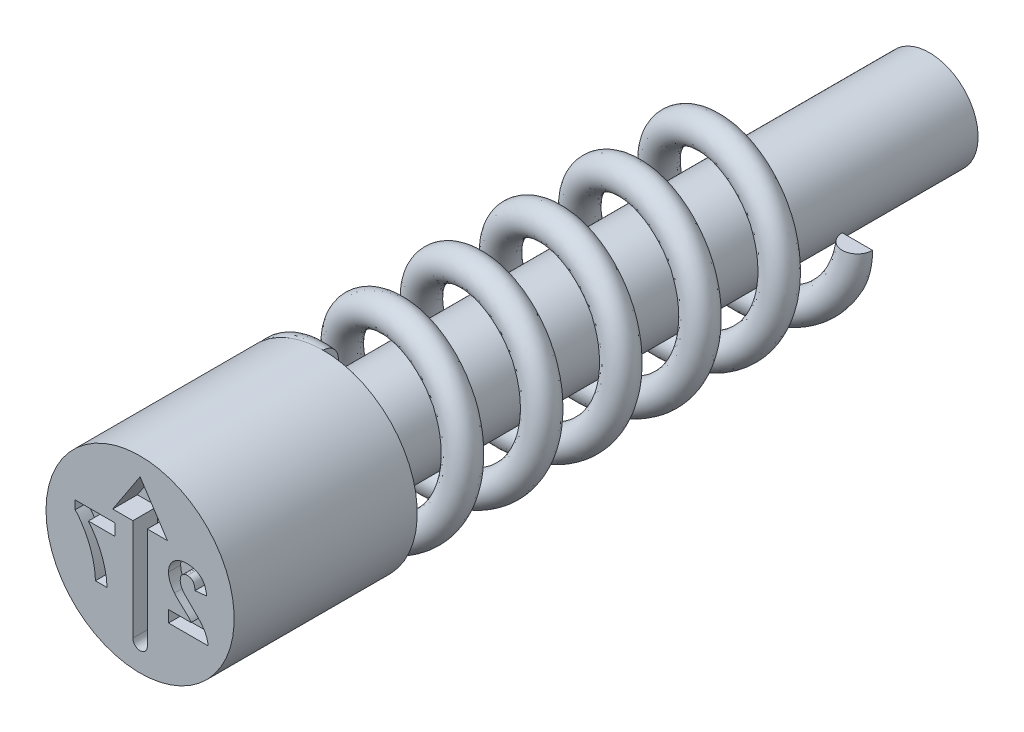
ISO-10303-21;
HEADER;
FILE_DESCRIPTION(('STEP AP214'),'2;1');
FILE_NAME('part.step','',(''),(''),'','','');
FILE_SCHEMA(('AUTOMOTIVE_DESIGN { 1 0 10303 214 1 1 1 1 }'));
ENDSEC;
DATA;
#1=APPLICATION_CONTEXT('core data for automotive mechanical design processes');
#2=APPLICATION_PROTOCOL_DEFINITION('international standard','automotive_design',2000,#1);
#3=PRODUCT_CONTEXT('',#1,'mechanical');
#4=PRODUCT('Part','Part','',(#3));
#5=PRODUCT_RELATED_PRODUCT_CATEGORY('part','',(#4));
#6=PRODUCT_DEFINITION_FORMATION('','',#4);
#7=PRODUCT_DEFINITION_CONTEXT('part definition',#1,'design');
#8=PRODUCT_DEFINITION('design','',#6,#7);
#9=PRODUCT_DEFINITION_SHAPE('','',#8);
#10=(LENGTH_UNIT() NAMED_UNIT(*) SI_UNIT(.MILLI.,.METRE.));
#11=(NAMED_UNIT(*) PLANE_ANGLE_UNIT() SI_UNIT($,.RADIAN.));
#12=(NAMED_UNIT(*) SI_UNIT($,.STERADIAN.) SOLID_ANGLE_UNIT());
#13=UNCERTAINTY_MEASURE_WITH_UNIT(LENGTH_MEASURE(1.E-05),#10,'distance_accuracy_value','');
#14=(GEOMETRIC_REPRESENTATION_CONTEXT(3) GLOBAL_UNCERTAINTY_ASSIGNED_CONTEXT((#13)) GLOBAL_UNIT_ASSIGNED_CONTEXT((#10,
#11,#12)) REPRESENTATION_CONTEXT('',''));
#15=CARTESIAN_POINT('',(0.,0.,0.));
#16=DIRECTION('',(0.,0.,1.));
#17=DIRECTION('',(1.,0.,0.));
#18=AXIS2_PLACEMENT_3D('',#15,#16,#17);
#19=CARTESIAN_POINT('',(1.3,0.,-10.766));
#20=DIRECTION('',(0.,-1.,0.));
#21=DIRECTION('',(0.,0.,-1.));
#22=AXIS2_PLACEMENT_3D('',#19,#20,#21);
#23=PLANE('',#22);
#24=CARTESIAN_POINT('',(1.3,0.,-10.516));
#25=DIRECTION('',(0.,1.,0.));
#26=DIRECTION('',(0.,0.,1.));
#27=AXIS2_PLACEMENT_3D('',#24,#25,#26);
#28=CIRCLE('',#27,0.25);
#29=CARTESIAN_POINT('',(1.05,-8.92229593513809E-13,-10.516));
#30=VERTEX_POINT('',#29);
#31=CARTESIAN_POINT('',(1.55,0.,-10.516));
#32=VERTEX_POINT('',#31);
#33=EDGE_CURVE('E92',#30,#32,#28,.T.);
#34=ORIENTED_EDGE('',*,*,#33,.T.);
#35=DIRECTION('',(-1.,0.,0.));
#36=VECTOR('',#35,1.);
#37=CARTESIAN_POINT('',(1.3,0.,-10.516));
#38=LINE('',#37,#36);
#39=EDGE_CURVE('E79',#32,#30,#38,.T.);
#40=ORIENTED_EDGE('',*,*,#39,.T.);
#41=EDGE_LOOP('',(#34,#40));
#42=FACE_BOUND('',#41,.T.);
#43=ADVANCED_FACE('F53',(#42),#23,.F.);
#44=CARTESIAN_POINT('',(0.,1.3,-3.266));
#45=DIRECTION('',(1.,0.,0.));
#46=DIRECTION('',(0.,1.,0.));
#47=AXIS2_PLACEMENT_3D('',#44,#45,#46);
#48=PLANE('',#47);
#49=DIRECTION('',(0.,1.,0.));
#50=VECTOR('',#49,1.);
#51=CARTESIAN_POINT('',(0.,1.3,-3.016));
#52=LINE('',#51,#50);
#53=CARTESIAN_POINT('',(-7.49652903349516E-13,1.05,-3.016));
#54=VERTEX_POINT('',#53);
#55=CARTESIAN_POINT('',(0.,1.55,-3.016));
#56=VERTEX_POINT('',#55);
#57=EDGE_CURVE('E73',#54,#56,#52,.T.);
#58=ORIENTED_EDGE('',*,*,#57,.F.);
#59=CARTESIAN_POINT('',(0.,1.3,-3.016));
#60=DIRECTION('',(1.,0.,0.));
#61=DIRECTION('',(0.,1.,0.));
#62=AXIS2_PLACEMENT_3D('',#59,#60,#61);
#63=CIRCLE('',#62,0.25);
#64=EDGE_CURVE('E89',#54,#56,#63,.T.);
#65=ORIENTED_EDGE('',*,*,#64,.T.);
#66=EDGE_LOOP('',(#58,#65));
#67=FACE_BOUND('',#66,.T.);
#68=ADVANCED_FACE('F55',(#67),#48,.T.);
#69=CARTESIAN_POINT('',(1.3,0.,-10.266));
#70=CARTESIAN_POINT('',(1.3,-0.538477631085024,-10.1844782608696));
#71=CARTESIAN_POINT('',(0.919238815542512,-0.919238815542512,-10.1029565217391));
#72=CARTESIAN_POINT('',(0.538477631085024,-1.3,-10.0214347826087));
#73=CARTESIAN_POINT('',(0.,-1.3,-9.93991304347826));
#74=CARTESIAN_POINT('',(-0.538477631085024,-1.3,-9.85839130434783));
#75=CARTESIAN_POINT('',(-0.919238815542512,-0.919238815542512,-9.77686956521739));
#76=CARTESIAN_POINT('',(-1.3,-0.538477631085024,-9.69534782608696));
#77=CARTESIAN_POINT('',(-1.3,0.,-9.61382608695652));
#78=CARTESIAN_POINT('',(-1.3,0.538477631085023,-9.53230434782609));
#79=CARTESIAN_POINT('',(-0.919238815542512,0.919238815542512,-9.45078260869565));
#80=CARTESIAN_POINT('',(-0.538477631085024,1.3,-9.36926086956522));
#81=CARTESIAN_POINT('',(0.,1.3,-9.28773913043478));
#82=CARTESIAN_POINT('',(0.538477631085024,1.3,-9.20621739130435));
#83=CARTESIAN_POINT('',(0.919238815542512,0.919238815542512,-9.12469565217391));
#84=CARTESIAN_POINT('',(1.3,0.538477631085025,-9.04317391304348));
#85=CARTESIAN_POINT('',(1.3,0.,-8.96165217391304));
#86=CARTESIAN_POINT('',(1.3,-0.538477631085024,-8.88013043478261));
#87=CARTESIAN_POINT('',(0.919238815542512,-0.919238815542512,-8.79860869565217));
#88=CARTESIAN_POINT('',(0.538477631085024,-1.3,-8.71708695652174));
#89=CARTESIAN_POINT('',(0.,-1.3,-8.6355652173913));
#90=CARTESIAN_POINT('',(-0.538477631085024,-1.3,-8.55404347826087));
#91=CARTESIAN_POINT('',(-0.919238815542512,-0.919238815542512,-8.47252173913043));
#92=CARTESIAN_POINT('',(-1.3,-0.538477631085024,-8.391));
#93=CARTESIAN_POINT('',(-1.3,0.,-8.30947826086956));
#94=CARTESIAN_POINT('',(-1.3,0.538477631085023,-8.22795652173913));
#95=CARTESIAN_POINT('',(-0.919238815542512,0.919238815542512,-8.1464347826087));
#96=CARTESIAN_POINT('',(-0.538477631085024,1.3,-8.06491304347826));
#97=CARTESIAN_POINT('',(0.,1.3,-7.98339130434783));
#98=CARTESIAN_POINT('',(0.538477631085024,1.3,-7.90186956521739));
#99=CARTESIAN_POINT('',(0.919238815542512,0.919238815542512,-7.82034782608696));
#100=CARTESIAN_POINT('',(1.3,0.538477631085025,-7.73882608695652));
#101=CARTESIAN_POINT('',(1.3,0.,-7.65730434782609));
#102=CARTESIAN_POINT('',(1.3,-0.538477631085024,-7.57578260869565));
#103=CARTESIAN_POINT('',(0.919238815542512,-0.919238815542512,-7.49426086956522));
#104=CARTESIAN_POINT('',(0.538477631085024,-1.3,-7.41273913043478));
#105=CARTESIAN_POINT('',(0.,-1.3,-7.33121739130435));
#106=CARTESIAN_POINT('',(-0.538477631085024,-1.3,-7.24969565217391));
#107=CARTESIAN_POINT('',(-0.919238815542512,-0.919238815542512,-7.16817391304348));
#108=CARTESIAN_POINT('',(-1.3,-0.538477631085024,-7.08665217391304));
#109=CARTESIAN_POINT('',(-1.3,0.,-7.00513043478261));
#110=CARTESIAN_POINT('',(-1.3,0.538477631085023,-6.92360869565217));
#111=CARTESIAN_POINT('',(-0.919238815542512,0.919238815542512,-6.84208695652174));
#112=CARTESIAN_POINT('',(-0.538477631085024,1.3,-6.7605652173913));
#113=CARTESIAN_POINT('',(0.,1.3,-6.67904347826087));
#114=CARTESIAN_POINT('',(0.538477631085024,1.3,-6.59752173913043));
#115=CARTESIAN_POINT('',(0.919238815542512,0.919238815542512,-6.516));
#116=CARTESIAN_POINT('',(1.3,0.538477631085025,-6.43447826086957));
#117=CARTESIAN_POINT('',(1.3,0.,-6.35295652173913));
#118=CARTESIAN_POINT('',(1.3,-0.538477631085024,-6.2714347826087));
#119=CARTESIAN_POINT('',(0.919238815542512,-0.919238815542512,-6.18991304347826));
#120=CARTESIAN_POINT('',(0.538477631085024,-1.3,-6.10839130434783));
#121=CARTESIAN_POINT('',(0.,-1.3,-6.02686956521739));
#122=CARTESIAN_POINT('',(-0.538477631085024,-1.3,-5.94534782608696));
#123=CARTESIAN_POINT('',(-0.919238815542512,-0.919238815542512,-5.86382608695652));
#124=CARTESIAN_POINT('',(-1.3,-0.538477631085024,-5.78230434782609));
#125=CARTESIAN_POINT('',(-1.3,0.,-5.70078260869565));
#126=CARTESIAN_POINT('',(-1.3,0.538477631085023,-5.61926086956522));
#127=CARTESIAN_POINT('',(-0.919238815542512,0.919238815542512,-5.53773913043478));
#128=CARTESIAN_POINT('',(-0.538477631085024,1.3,-5.45621739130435));
#129=CARTESIAN_POINT('',(0.,1.3,-5.37469565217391));
#130=CARTESIAN_POINT('',(0.538477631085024,1.3,-5.29317391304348));
#131=CARTESIAN_POINT('',(0.919238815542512,0.919238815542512,-5.21165217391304));
#132=CARTESIAN_POINT('',(1.3,0.538477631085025,-5.13013043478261));
#133=CARTESIAN_POINT('',(1.3,0.,-5.04860869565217));
#134=CARTESIAN_POINT('',(1.3,-0.538477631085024,-4.96708695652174));
#135=CARTESIAN_POINT('',(0.919238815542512,-0.919238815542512,-4.8855652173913));
#136=CARTESIAN_POINT('',(0.538477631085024,-1.3,-4.80404347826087));
#137=CARTESIAN_POINT('',(0.,-1.3,-4.72252173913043));
#138=CARTESIAN_POINT('',(-0.538477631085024,-1.3,-4.641));
#139=CARTESIAN_POINT('',(-0.919238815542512,-0.919238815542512,-4.55947826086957));
#140=CARTESIAN_POINT('',(-1.3,-0.538477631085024,-4.47795652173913));
#141=CARTESIAN_POINT('',(-1.3,0.,-4.3964347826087));
#142=CARTESIAN_POINT('',(-1.3,0.538477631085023,-4.31491304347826));
#143=CARTESIAN_POINT('',(-0.919238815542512,0.919238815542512,-4.23339130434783));
#144=CARTESIAN_POINT('',(-0.538477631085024,1.3,-4.15186956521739));
#145=CARTESIAN_POINT('',(0.,1.3,-4.07034782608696));
#146=CARTESIAN_POINT('',(0.538477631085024,1.3,-3.98882608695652));
#147=CARTESIAN_POINT('',(0.919238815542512,0.919238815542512,-3.90730434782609));
#148=CARTESIAN_POINT('',(1.3,0.538477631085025,-3.82578260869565));
#149=CARTESIAN_POINT('',(1.3,0.,-3.74426086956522));
#150=CARTESIAN_POINT('',(1.3,-0.538477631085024,-3.66273913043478));
#151=CARTESIAN_POINT('',(0.919238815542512,-0.919238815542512,-3.58121739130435));
#152=CARTESIAN_POINT('',(0.538477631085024,-1.3,-3.49969565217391));
#153=CARTESIAN_POINT('',(0.,-1.3,-3.41817391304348));
#154=CARTESIAN_POINT('',(-0.538477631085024,-1.3,-3.33665217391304));
#155=CARTESIAN_POINT('',(-0.919238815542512,-0.919238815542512,-3.25513043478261));
#156=CARTESIAN_POINT('',(-1.3,-0.538477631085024,-3.17360869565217));
#157=CARTESIAN_POINT('',(-1.3,0.,-3.09208695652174));
#158=CARTESIAN_POINT('',(-1.3,0.538477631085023,-3.0105652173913));
#159=CARTESIAN_POINT('',(-0.919238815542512,0.919238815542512,-2.92904347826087));
#160=CARTESIAN_POINT('',(-0.538477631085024,1.3,-2.84752173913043));
#161=CARTESIAN_POINT('',(0.,1.3,-2.766));
#162=CARTESIAN_POINT('',(1.8,0.,-10.266));
#163=CARTESIAN_POINT('',(1.8,-0.745584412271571,-10.1844782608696));
#164=CARTESIAN_POINT('',(1.27279220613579,-1.27279220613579,-10.1029565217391));
#165=CARTESIAN_POINT('',(0.745584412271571,-1.8,-10.0214347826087));
#166=CARTESIAN_POINT('',(0.,-1.8,-9.93991304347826));
#167=CARTESIAN_POINT('',(-0.745584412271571,-1.8,-9.85839130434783));
#168=CARTESIAN_POINT('',(-1.27279220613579,-1.27279220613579,-9.77686956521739));
#169=CARTESIAN_POINT('',(-1.8,-0.745584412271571,-9.69534782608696));
#170=CARTESIAN_POINT('',(-1.8,0.,-9.61382608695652));
#171=CARTESIAN_POINT('',(-1.8,0.745584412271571,-9.53230434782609));
#172=CARTESIAN_POINT('',(-1.27279220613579,1.27279220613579,-9.45078260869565));
#173=CARTESIAN_POINT('',(-0.745584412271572,1.8,-9.36926086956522));
#174=CARTESIAN_POINT('',(0.,1.8,-9.28773913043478));
#175=CARTESIAN_POINT('',(0.745584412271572,1.8,-9.20621739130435));
#176=CARTESIAN_POINT('',(1.27279220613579,1.27279220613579,-9.12469565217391));
#177=CARTESIAN_POINT('',(1.8,0.745584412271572,-9.04317391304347));
#178=CARTESIAN_POINT('',(1.8,0.,-8.96165217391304));
#179=CARTESIAN_POINT('',(1.8,-0.745584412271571,-8.88013043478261));
#180=CARTESIAN_POINT('',(1.27279220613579,-1.27279220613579,-8.79860869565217));
#181=CARTESIAN_POINT('',(0.745584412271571,-1.8,-8.71708695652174));
#182=CARTESIAN_POINT('',(0.,-1.8,-8.6355652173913));
#183=CARTESIAN_POINT('',(-0.745584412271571,-1.8,-8.55404347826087));
#184=CARTESIAN_POINT('',(-1.27279220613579,-1.27279220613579,-8.47252173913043));
#185=CARTESIAN_POINT('',(-1.8,-0.745584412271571,-8.391));
#186=CARTESIAN_POINT('',(-1.8,0.,-8.30947826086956));
#187=CARTESIAN_POINT('',(-1.8,0.745584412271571,-8.22795652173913));
#188=CARTESIAN_POINT('',(-1.27279220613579,1.27279220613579,-8.1464347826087));
#189=CARTESIAN_POINT('',(-0.745584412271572,1.8,-8.06491304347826));
#190=CARTESIAN_POINT('',(0.,1.8,-7.98339130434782));
#191=CARTESIAN_POINT('',(0.745584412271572,1.8,-7.90186956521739));
#192=CARTESIAN_POINT('',(1.27279220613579,1.27279220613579,-7.82034782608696));
#193=CARTESIAN_POINT('',(1.8,0.745584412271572,-7.73882608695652));
#194=CARTESIAN_POINT('',(1.8,0.,-7.65730434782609));
#195=CARTESIAN_POINT('',(1.8,-0.745584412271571,-7.57578260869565));
#196=CARTESIAN_POINT('',(1.27279220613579,-1.27279220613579,-7.49426086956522));
#197=CARTESIAN_POINT('',(0.745584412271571,-1.8,-7.41273913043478));
#198=CARTESIAN_POINT('',(0.,-1.8,-7.33121739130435));
#199=CARTESIAN_POINT('',(-0.745584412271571,-1.8,-7.24969565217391));
#200=CARTESIAN_POINT('',(-1.27279220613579,-1.27279220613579,-7.16817391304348));
#201=CARTESIAN_POINT('',(-1.8,-0.745584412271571,-7.08665217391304));
#202=CARTESIAN_POINT('',(-1.8,0.,-7.00513043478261));
#203=CARTESIAN_POINT('',(-1.8,0.745584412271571,-6.92360869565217));
#204=CARTESIAN_POINT('',(-1.27279220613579,1.27279220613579,-6.84208695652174));
#205=CARTESIAN_POINT('',(-0.745584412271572,1.8,-6.7605652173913));
#206=CARTESIAN_POINT('',(0.,1.8,-6.67904347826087));
#207=CARTESIAN_POINT('',(0.745584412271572,1.8,-6.59752173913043));
#208=CARTESIAN_POINT('',(1.27279220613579,1.27279220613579,-6.516));
#209=CARTESIAN_POINT('',(1.8,0.745584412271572,-6.43447826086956));
#210=CARTESIAN_POINT('',(1.8,0.,-6.35295652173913));
#211=CARTESIAN_POINT('',(1.8,-0.745584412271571,-6.27143478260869));
#212=CARTESIAN_POINT('',(1.27279220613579,-1.27279220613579,-6.18991304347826));
#213=CARTESIAN_POINT('',(0.745584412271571,-1.8,-6.10839130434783));
#214=CARTESIAN_POINT('',(0.,-1.8,-6.02686956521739));
#215=CARTESIAN_POINT('',(-0.745584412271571,-1.8,-5.94534782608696));
#216=CARTESIAN_POINT('',(-1.27279220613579,-1.27279220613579,-5.86382608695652));
#217=CARTESIAN_POINT('',(-1.8,-0.745584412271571,-5.78230434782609));
#218=CARTESIAN_POINT('',(-1.8,0.,-5.70078260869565));
#219=CARTESIAN_POINT('',(-1.8,0.745584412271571,-5.61926086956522));
#220=CARTESIAN_POINT('',(-1.27279220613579,1.27279220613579,-5.53773913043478));
#221=CARTESIAN_POINT('',(-0.745584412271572,1.8,-5.45621739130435));
#222=CARTESIAN_POINT('',(0.,1.8,-5.37469565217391));
#223=CARTESIAN_POINT('',(0.745584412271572,1.8,-5.29317391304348));
#224=CARTESIAN_POINT('',(1.27279220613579,1.27279220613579,-5.21165217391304));
#225=CARTESIAN_POINT('',(1.8,0.745584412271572,-5.13013043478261));
#226=CARTESIAN_POINT('',(1.8,0.,-5.04860869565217));
#227=CARTESIAN_POINT('',(1.8,-0.745584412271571,-4.96708695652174));
#228=CARTESIAN_POINT('',(1.27279220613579,-1.27279220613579,-4.8855652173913));
#229=CARTESIAN_POINT('',(0.745584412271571,-1.8,-4.80404347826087));
#230=CARTESIAN_POINT('',(0.,-1.8,-4.72252173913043));
#231=CARTESIAN_POINT('',(-0.745584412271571,-1.8,-4.641));
#232=CARTESIAN_POINT('',(-1.27279220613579,-1.27279220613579,-4.55947826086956));
#233=CARTESIAN_POINT('',(-1.8,-0.745584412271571,-4.47795652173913));
#234=CARTESIAN_POINT('',(-1.8,0.,-4.3964347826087));
#235=CARTESIAN_POINT('',(-1.8,0.745584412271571,-4.31491304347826));
#236=CARTESIAN_POINT('',(-1.27279220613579,1.27279220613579,-4.23339130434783));
#237=CARTESIAN_POINT('',(-0.745584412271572,1.8,-4.15186956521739));
#238=CARTESIAN_POINT('',(0.,1.8,-4.07034782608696));
#239=CARTESIAN_POINT('',(0.745584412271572,1.8,-3.98882608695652));
#240=CARTESIAN_POINT('',(1.27279220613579,1.27279220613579,-3.90730434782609));
#241=CARTESIAN_POINT('',(1.8,0.745584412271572,-3.82578260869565));
#242=CARTESIAN_POINT('',(1.8,0.,-3.74426086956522));
#243=CARTESIAN_POINT('',(1.8,-0.745584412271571,-3.66273913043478));
#244=CARTESIAN_POINT('',(1.27279220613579,-1.27279220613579,-3.58121739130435));
#245=CARTESIAN_POINT('',(0.745584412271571,-1.8,-3.49969565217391));
#246=CARTESIAN_POINT('',(0.,-1.8,-3.41817391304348));
#247=CARTESIAN_POINT('',(-0.745584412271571,-1.8,-3.33665217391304));
#248=CARTESIAN_POINT('',(-1.27279220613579,-1.27279220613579,-3.25513043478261));
#249=CARTESIAN_POINT('',(-1.8,-0.745584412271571,-3.17360869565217));
#250=CARTESIAN_POINT('',(-1.8,0.,-3.09208695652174));
#251=CARTESIAN_POINT('',(-1.8,0.745584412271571,-3.0105652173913));
#252=CARTESIAN_POINT('',(-1.27279220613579,1.27279220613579,-2.92904347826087));
#253=CARTESIAN_POINT('',(-0.745584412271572,1.8,-2.84752173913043));
#254=CARTESIAN_POINT('',(0.,1.8,-2.766));
#255=CARTESIAN_POINT('',(1.8,0.,-10.766));
#256=CARTESIAN_POINT('',(1.8,-0.745584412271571,-10.6844782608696));
#257=CARTESIAN_POINT('',(1.27279220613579,-1.27279220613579,-10.6029565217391));
#258=CARTESIAN_POINT('',(0.745584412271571,-1.8,-10.5214347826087));
#259=CARTESIAN_POINT('',(0.,-1.8,-10.4399130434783));
#260=CARTESIAN_POINT('',(-0.745584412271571,-1.8,-10.3583913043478));
#261=CARTESIAN_POINT('',(-1.27279220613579,-1.27279220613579,-10.2768695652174));
#262=CARTESIAN_POINT('',(-1.8,-0.745584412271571,-10.195347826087));
#263=CARTESIAN_POINT('',(-1.8,0.,-10.1138260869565));
#264=CARTESIAN_POINT('',(-1.8,0.745584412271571,-10.0323043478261));
#265=CARTESIAN_POINT('',(-1.27279220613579,1.27279220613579,-9.95078260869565));
#266=CARTESIAN_POINT('',(-0.745584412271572,1.8,-9.86926086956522));
#267=CARTESIAN_POINT('',(0.,1.8,-9.78773913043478));
#268=CARTESIAN_POINT('',(0.745584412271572,1.8,-9.70621739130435));
#269=CARTESIAN_POINT('',(1.27279220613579,1.27279220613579,-9.62469565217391));
#270=CARTESIAN_POINT('',(1.8,0.745584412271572,-9.54317391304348));
#271=CARTESIAN_POINT('',(1.8,0.,-9.46165217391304));
#272=CARTESIAN_POINT('',(1.8,-0.745584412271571,-9.38013043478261));
#273=CARTESIAN_POINT('',(1.27279220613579,-1.27279220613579,-9.29860869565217));
#274=CARTESIAN_POINT('',(0.745584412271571,-1.8,-9.21708695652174));
#275=CARTESIAN_POINT('',(0.,-1.8,-9.1355652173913));
#276=CARTESIAN_POINT('',(-0.745584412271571,-1.8,-9.05404347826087));
#277=CARTESIAN_POINT('',(-1.27279220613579,-1.27279220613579,-8.97252173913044));
#278=CARTESIAN_POINT('',(-1.8,-0.745584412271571,-8.891));
#279=CARTESIAN_POINT('',(-1.8,0.,-8.80947826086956));
#280=CARTESIAN_POINT('',(-1.8,0.745584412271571,-8.72795652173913));
#281=CARTESIAN_POINT('',(-1.27279220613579,1.27279220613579,-8.6464347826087));
#282=CARTESIAN_POINT('',(-0.745584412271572,1.8,-8.56491304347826));
#283=CARTESIAN_POINT('',(0.,1.8,-8.48339130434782));
#284=CARTESIAN_POINT('',(0.745584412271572,1.8,-8.40186956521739));
#285=CARTESIAN_POINT('',(1.27279220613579,1.27279220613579,-8.32034782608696));
#286=CARTESIAN_POINT('',(1.8,0.745584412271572,-8.23882608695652));
#287=CARTESIAN_POINT('',(1.8,0.,-8.15730434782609));
#288=CARTESIAN_POINT('',(1.8,-0.745584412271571,-8.07578260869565));
#289=CARTESIAN_POINT('',(1.27279220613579,-1.27279220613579,-7.99426086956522));
#290=CARTESIAN_POINT('',(0.745584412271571,-1.8,-7.91273913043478));
#291=CARTESIAN_POINT('',(0.,-1.8,-7.83121739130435));
#292=CARTESIAN_POINT('',(-0.745584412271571,-1.8,-7.74969565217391));
#293=CARTESIAN_POINT('',(-1.27279220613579,-1.27279220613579,-7.66817391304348));
#294=CARTESIAN_POINT('',(-1.8,-0.745584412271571,-7.58665217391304));
#295=CARTESIAN_POINT('',(-1.8,0.,-7.50513043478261));
#296=CARTESIAN_POINT('',(-1.8,0.745584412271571,-7.42360869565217));
#297=CARTESIAN_POINT('',(-1.27279220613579,1.27279220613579,-7.34208695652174));
#298=CARTESIAN_POINT('',(-0.745584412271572,1.8,-7.2605652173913));
#299=CARTESIAN_POINT('',(0.,1.8,-7.17904347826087));
#300=CARTESIAN_POINT('',(0.745584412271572,1.8,-7.09752173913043));
#301=CARTESIAN_POINT('',(1.27279220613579,1.27279220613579,-7.016));
#302=CARTESIAN_POINT('',(1.8,0.745584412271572,-6.93447826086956));
#303=CARTESIAN_POINT('',(1.8,0.,-6.85295652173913));
#304=CARTESIAN_POINT('',(1.8,-0.745584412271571,-6.77143478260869));
#305=CARTESIAN_POINT('',(1.27279220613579,-1.27279220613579,-6.68991304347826));
#306=CARTESIAN_POINT('',(0.745584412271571,-1.8,-6.60839130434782));
#307=CARTESIAN_POINT('',(0.,-1.8,-6.52686956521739));
#308=CARTESIAN_POINT('',(-0.745584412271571,-1.8,-6.44534782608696));
#309=CARTESIAN_POINT('',(-1.27279220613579,-1.27279220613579,-6.36382608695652));
#310=CARTESIAN_POINT('',(-1.8,-0.745584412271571,-6.28230434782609));
#311=CARTESIAN_POINT('',(-1.8,0.,-6.20078260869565));
#312=CARTESIAN_POINT('',(-1.8,0.745584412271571,-6.11926086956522));
#313=CARTESIAN_POINT('',(-1.27279220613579,1.27279220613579,-6.03773913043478));
#314=CARTESIAN_POINT('',(-0.745584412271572,1.8,-5.95621739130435));
#315=CARTESIAN_POINT('',(0.,1.8,-5.87469565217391));
#316=CARTESIAN_POINT('',(0.745584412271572,1.8,-5.79317391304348));
#317=CARTESIAN_POINT('',(1.27279220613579,1.27279220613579,-5.71165217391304));
#318=CARTESIAN_POINT('',(1.8,0.745584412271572,-5.63013043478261));
#319=CARTESIAN_POINT('',(1.8,0.,-5.54860869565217));
#320=CARTESIAN_POINT('',(1.8,-0.745584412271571,-5.46708695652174));
#321=CARTESIAN_POINT('',(1.27279220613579,-1.27279220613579,-5.3855652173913));
#322=CARTESIAN_POINT('',(0.745584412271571,-1.8,-5.30404347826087));
#323=CARTESIAN_POINT('',(0.,-1.8,-5.22252173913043));
#324=CARTESIAN_POINT('',(-0.745584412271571,-1.8,-5.141));
#325=CARTESIAN_POINT('',(-1.27279220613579,-1.27279220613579,-5.05947826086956));
#326=CARTESIAN_POINT('',(-1.8,-0.745584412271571,-4.97795652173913));
#327=CARTESIAN_POINT('',(-1.8,0.,-4.8964347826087));
#328=CARTESIAN_POINT('',(-1.8,0.745584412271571,-4.81491304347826));
#329=CARTESIAN_POINT('',(-1.27279220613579,1.27279220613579,-4.73339130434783));
#330=CARTESIAN_POINT('',(-0.745584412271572,1.8,-4.65186956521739));
#331=CARTESIAN_POINT('',(0.,1.8,-4.57034782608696));
#332=CARTESIAN_POINT('',(0.745584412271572,1.8,-4.48882608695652));
#333=CARTESIAN_POINT('',(1.27279220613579,1.27279220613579,-4.40730434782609));
#334=CARTESIAN_POINT('',(1.8,0.745584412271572,-4.32578260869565));
#335=CARTESIAN_POINT('',(1.8,0.,-4.24426086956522));
#336=CARTESIAN_POINT('',(1.8,-0.745584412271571,-4.16273913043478));
#337=CARTESIAN_POINT('',(1.27279220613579,-1.27279220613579,-4.08121739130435));
#338=CARTESIAN_POINT('',(0.745584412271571,-1.8,-3.99969565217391));
#339=CARTESIAN_POINT('',(0.,-1.8,-3.91817391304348));
#340=CARTESIAN_POINT('',(-0.745584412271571,-1.8,-3.83665217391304));
#341=CARTESIAN_POINT('',(-1.27279220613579,-1.27279220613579,-3.75513043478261));
#342=CARTESIAN_POINT('',(-1.8,-0.745584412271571,-3.67360869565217));
#343=CARTESIAN_POINT('',(-1.8,0.,-3.59208695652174));
#344=CARTESIAN_POINT('',(-1.8,0.745584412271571,-3.5105652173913));
#345=CARTESIAN_POINT('',(-1.27279220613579,1.27279220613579,-3.42904347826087));
#346=CARTESIAN_POINT('',(-0.745584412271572,1.8,-3.34752173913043));
#347=CARTESIAN_POINT('',(0.,1.8,-3.266));
#348=CARTESIAN_POINT('',(1.3,0.,-10.766));
#349=CARTESIAN_POINT('',(1.3,-0.538477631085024,-10.6844782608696));
#350=CARTESIAN_POINT('',(0.919238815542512,-0.919238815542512,-10.6029565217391));
#351=CARTESIAN_POINT('',(0.538477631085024,-1.3,-10.5214347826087));
#352=CARTESIAN_POINT('',(0.,-1.3,-10.4399130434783));
#353=CARTESIAN_POINT('',(-0.538477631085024,-1.3,-10.3583913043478));
#354=CARTESIAN_POINT('',(-0.919238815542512,-0.919238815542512,-10.2768695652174));
#355=CARTESIAN_POINT('',(-1.3,-0.538477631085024,-10.195347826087));
#356=CARTESIAN_POINT('',(-1.3,0.,-10.1138260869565));
#357=CARTESIAN_POINT('',(-1.3,0.538477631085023,-10.0323043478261));
#358=CARTESIAN_POINT('',(-0.919238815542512,0.919238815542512,-9.95078260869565));
#359=CARTESIAN_POINT('',(-0.538477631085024,1.3,-9.86926086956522));
#360=CARTESIAN_POINT('',(0.,1.3,-9.78773913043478));
#361=CARTESIAN_POINT('',(0.538477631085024,1.3,-9.70621739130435));
#362=CARTESIAN_POINT('',(0.919238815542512,0.919238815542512,-9.62469565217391));
#363=CARTESIAN_POINT('',(1.3,0.538477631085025,-9.54317391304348));
#364=CARTESIAN_POINT('',(1.3,0.,-9.46165217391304));
#365=CARTESIAN_POINT('',(1.3,-0.538477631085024,-9.38013043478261));
#366=CARTESIAN_POINT('',(0.919238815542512,-0.919238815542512,-9.29860869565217));
#367=CARTESIAN_POINT('',(0.538477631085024,-1.3,-9.21708695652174));
#368=CARTESIAN_POINT('',(0.,-1.3,-9.1355652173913));
#369=CARTESIAN_POINT('',(-0.538477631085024,-1.3,-9.05404347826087));
#370=CARTESIAN_POINT('',(-0.919238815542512,-0.919238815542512,-8.97252173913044));
#371=CARTESIAN_POINT('',(-1.3,-0.538477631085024,-8.891));
#372=CARTESIAN_POINT('',(-1.3,0.,-8.80947826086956));
#373=CARTESIAN_POINT('',(-1.3,0.538477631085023,-8.72795652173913));
#374=CARTESIAN_POINT('',(-0.919238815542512,0.919238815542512,-8.6464347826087));
#375=CARTESIAN_POINT('',(-0.538477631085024,1.3,-8.56491304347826));
#376=CARTESIAN_POINT('',(0.,1.3,-8.48339130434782));
#377=CARTESIAN_POINT('',(0.538477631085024,1.3,-8.40186956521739));
#378=CARTESIAN_POINT('',(0.919238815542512,0.919238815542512,-8.32034782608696));
#379=CARTESIAN_POINT('',(1.3,0.538477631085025,-8.23882608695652));
#380=CARTESIAN_POINT('',(1.3,0.,-8.15730434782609));
#381=CARTESIAN_POINT('',(1.3,-0.538477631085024,-8.07578260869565));
#382=CARTESIAN_POINT('',(0.919238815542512,-0.919238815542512,-7.99426086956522));
#383=CARTESIAN_POINT('',(0.538477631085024,-1.3,-7.91273913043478));
#384=CARTESIAN_POINT('',(0.,-1.3,-7.83121739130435));
#385=CARTESIAN_POINT('',(-0.538477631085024,-1.3,-7.74969565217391));
#386=CARTESIAN_POINT('',(-0.919238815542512,-0.919238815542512,-7.66817391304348));
#387=CARTESIAN_POINT('',(-1.3,-0.538477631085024,-7.58665217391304));
#388=CARTESIAN_POINT('',(-1.3,0.,-7.50513043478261));
#389=CARTESIAN_POINT('',(-1.3,0.538477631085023,-7.42360869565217));
#390=CARTESIAN_POINT('',(-0.919238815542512,0.919238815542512,-7.34208695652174));
#391=CARTESIAN_POINT('',(-0.538477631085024,1.3,-7.2605652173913));
#392=CARTESIAN_POINT('',(0.,1.3,-7.17904347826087));
#393=CARTESIAN_POINT('',(0.538477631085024,1.3,-7.09752173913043));
#394=CARTESIAN_POINT('',(0.919238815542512,0.919238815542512,-7.016));
#395=CARTESIAN_POINT('',(1.3,0.538477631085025,-6.93447826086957));
#396=CARTESIAN_POINT('',(1.3,0.,-6.85295652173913));
#397=CARTESIAN_POINT('',(1.3,-0.538477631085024,-6.77143478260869));
#398=CARTESIAN_POINT('',(0.919238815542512,-0.919238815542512,-6.68991304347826));
#399=CARTESIAN_POINT('',(0.538477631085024,-1.3,-6.60839130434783));
#400=CARTESIAN_POINT('',(0.,-1.3,-6.52686956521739));
#401=CARTESIAN_POINT('',(-0.538477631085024,-1.3,-6.44534782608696));
#402=CARTESIAN_POINT('',(-0.919238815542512,-0.919238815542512,-6.36382608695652));
#403=CARTESIAN_POINT('',(-1.3,-0.538477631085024,-6.28230434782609));
#404=CARTESIAN_POINT('',(-1.3,0.,-6.20078260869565));
#405=CARTESIAN_POINT('',(-1.3,0.538477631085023,-6.11926086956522));
#406=CARTESIAN_POINT('',(-0.919238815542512,0.919238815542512,-6.03773913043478));
#407=CARTESIAN_POINT('',(-0.538477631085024,1.3,-5.95621739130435));
#408=CARTESIAN_POINT('',(0.,1.3,-5.87469565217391));
#409=CARTESIAN_POINT('',(0.538477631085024,1.3,-5.79317391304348));
#410=CARTESIAN_POINT('',(0.919238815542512,0.919238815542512,-5.71165217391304));
#411=CARTESIAN_POINT('',(1.3,0.538477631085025,-5.63013043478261));
#412=CARTESIAN_POINT('',(1.3,0.,-5.54860869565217));
#413=CARTESIAN_POINT('',(1.3,-0.538477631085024,-5.46708695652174));
#414=CARTESIAN_POINT('',(0.919238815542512,-0.919238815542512,-5.3855652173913));
#415=CARTESIAN_POINT('',(0.538477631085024,-1.3,-5.30404347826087));
#416=CARTESIAN_POINT('',(0.,-1.3,-5.22252173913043));
#417=CARTESIAN_POINT('',(-0.538477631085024,-1.3,-5.141));
#418=CARTESIAN_POINT('',(-0.919238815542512,-0.919238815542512,-5.05947826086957));
#419=CARTESIAN_POINT('',(-1.3,-0.538477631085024,-4.97795652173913));
#420=CARTESIAN_POINT('',(-1.3,0.,-4.8964347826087));
#421=CARTESIAN_POINT('',(-1.3,0.538477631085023,-4.81491304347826));
#422=CARTESIAN_POINT('',(-0.919238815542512,0.919238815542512,-4.73339130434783));
#423=CARTESIAN_POINT('',(-0.538477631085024,1.3,-4.65186956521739));
#424=CARTESIAN_POINT('',(0.,1.3,-4.57034782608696));
#425=CARTESIAN_POINT('',(0.538477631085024,1.3,-4.48882608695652));
#426=CARTESIAN_POINT('',(0.919238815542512,0.919238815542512,-4.40730434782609));
#427=CARTESIAN_POINT('',(1.3,0.538477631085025,-4.32578260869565));
#428=CARTESIAN_POINT('',(1.3,0.,-4.24426086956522));
#429=CARTESIAN_POINT('',(1.3,-0.538477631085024,-4.16273913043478));
#430=CARTESIAN_POINT('',(0.919238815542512,-0.919238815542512,-4.08121739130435));
#431=CARTESIAN_POINT('',(0.538477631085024,-1.3,-3.99969565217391));
#432=CARTESIAN_POINT('',(0.,-1.3,-3.91817391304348));
#433=CARTESIAN_POINT('',(-0.538477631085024,-1.3,-3.83665217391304));
#434=CARTESIAN_POINT('',(-0.919238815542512,-0.919238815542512,-3.75513043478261));
#435=CARTESIAN_POINT('',(-1.3,-0.538477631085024,-3.67360869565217));
#436=CARTESIAN_POINT('',(-1.3,0.,-3.59208695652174));
#437=CARTESIAN_POINT('',(-1.3,0.538477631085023,-3.51056521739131));
#438=CARTESIAN_POINT('',(-0.919238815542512,0.919238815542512,-3.42904347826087));
#439=CARTESIAN_POINT('',(-0.538477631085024,1.3,-3.34752173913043));
#440=CARTESIAN_POINT('',(0.,1.3,-3.266));
#441=CARTESIAN_POINT('',(0.8,0.,-10.766));
#442=CARTESIAN_POINT('',(0.8,-0.331370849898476,-10.6844782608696));
#443=CARTESIAN_POINT('',(0.565685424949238,-0.565685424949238,-10.6029565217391));
#444=CARTESIAN_POINT('',(0.331370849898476,-0.8,-10.5214347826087));
#445=CARTESIAN_POINT('',(0.,-0.8,-10.4399130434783));
#446=CARTESIAN_POINT('',(-0.331370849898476,-0.8,-10.3583913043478));
#447=CARTESIAN_POINT('',(-0.565685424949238,-0.565685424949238,-10.2768695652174));
#448=CARTESIAN_POINT('',(-0.8,-0.331370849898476,-10.195347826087));
#449=CARTESIAN_POINT('',(-0.8,0.,-10.1138260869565));
#450=CARTESIAN_POINT('',(-0.8,0.331370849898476,-10.0323043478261));
#451=CARTESIAN_POINT('',(-0.565685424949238,0.565685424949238,-9.95078260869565));
#452=CARTESIAN_POINT('',(-0.331370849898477,0.8,-9.86926086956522));
#453=CARTESIAN_POINT('',(0.,0.8,-9.78773913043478));
#454=CARTESIAN_POINT('',(0.331370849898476,0.8,-9.70621739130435));
#455=CARTESIAN_POINT('',(0.565685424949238,0.565685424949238,-9.62469565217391));
#456=CARTESIAN_POINT('',(0.8,0.331370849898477,-9.54317391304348));
#457=CARTESIAN_POINT('',(0.8,0.,-9.46165217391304));
#458=CARTESIAN_POINT('',(0.8,-0.331370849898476,-9.38013043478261));
#459=CARTESIAN_POINT('',(0.565685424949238,-0.565685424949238,-9.29860869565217));
#460=CARTESIAN_POINT('',(0.331370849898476,-0.8,-9.21708695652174));
#461=CARTESIAN_POINT('',(0.,-0.8,-9.1355652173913));
#462=CARTESIAN_POINT('',(-0.331370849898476,-0.8,-9.05404347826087));
#463=CARTESIAN_POINT('',(-0.565685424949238,-0.565685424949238,-8.97252173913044));
#464=CARTESIAN_POINT('',(-0.8,-0.331370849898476,-8.891));
#465=CARTESIAN_POINT('',(-0.8,0.,-8.80947826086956));
#466=CARTESIAN_POINT('',(-0.8,0.331370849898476,-8.72795652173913));
#467=CARTESIAN_POINT('',(-0.565685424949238,0.565685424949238,-8.6464347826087));
#468=CARTESIAN_POINT('',(-0.331370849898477,0.8,-8.56491304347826));
#469=CARTESIAN_POINT('',(0.,0.8,-8.48339130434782));
#470=CARTESIAN_POINT('',(0.331370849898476,0.8,-8.40186956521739));
#471=CARTESIAN_POINT('',(0.565685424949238,0.565685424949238,-8.32034782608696));
#472=CARTESIAN_POINT('',(0.8,0.331370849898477,-8.23882608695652));
#473=CARTESIAN_POINT('',(0.8,0.,-8.15730434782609));
#474=CARTESIAN_POINT('',(0.8,-0.331370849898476,-8.07578260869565));
#475=CARTESIAN_POINT('',(0.565685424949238,-0.565685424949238,-7.99426086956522));
#476=CARTESIAN_POINT('',(0.331370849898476,-0.8,-7.91273913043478));
#477=CARTESIAN_POINT('',(0.,-0.8,-7.83121739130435));
#478=CARTESIAN_POINT('',(-0.331370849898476,-0.8,-7.74969565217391));
#479=CARTESIAN_POINT('',(-0.565685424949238,-0.565685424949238,-7.66817391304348));
#480=CARTESIAN_POINT('',(-0.8,-0.331370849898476,-7.58665217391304));
#481=CARTESIAN_POINT('',(-0.8,0.,-7.50513043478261));
#482=CARTESIAN_POINT('',(-0.8,0.331370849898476,-7.42360869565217));
#483=CARTESIAN_POINT('',(-0.565685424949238,0.565685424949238,-7.34208695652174));
#484=CARTESIAN_POINT('',(-0.331370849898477,0.8,-7.2605652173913));
#485=CARTESIAN_POINT('',(0.,0.8,-7.17904347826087));
#486=CARTESIAN_POINT('',(0.331370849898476,0.8,-7.09752173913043));
#487=CARTESIAN_POINT('',(0.565685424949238,0.565685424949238,-7.016));
#488=CARTESIAN_POINT('',(0.8,0.331370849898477,-6.93447826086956));
#489=CARTESIAN_POINT('',(0.8,0.,-6.85295652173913));
#490=CARTESIAN_POINT('',(0.8,-0.331370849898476,-6.77143478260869));
#491=CARTESIAN_POINT('',(0.565685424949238,-0.565685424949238,-6.68991304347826));
#492=CARTESIAN_POINT('',(0.331370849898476,-0.8,-6.60839130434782));
#493=CARTESIAN_POINT('',(0.,-0.8,-6.52686956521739));
#494=CARTESIAN_POINT('',(-0.331370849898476,-0.8,-6.44534782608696));
#495=CARTESIAN_POINT('',(-0.565685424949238,-0.565685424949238,-6.36382608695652));
#496=CARTESIAN_POINT('',(-0.8,-0.331370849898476,-6.28230434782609));
#497=CARTESIAN_POINT('',(-0.8,0.,-6.20078260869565));
#498=CARTESIAN_POINT('',(-0.8,0.331370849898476,-6.11926086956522));
#499=CARTESIAN_POINT('',(-0.565685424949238,0.565685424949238,-6.03773913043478));
#500=CARTESIAN_POINT('',(-0.331370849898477,0.8,-5.95621739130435));
#501=CARTESIAN_POINT('',(0.,0.8,-5.87469565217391));
#502=CARTESIAN_POINT('',(0.331370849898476,0.8,-5.79317391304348));
#503=CARTESIAN_POINT('',(0.565685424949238,0.565685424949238,-5.71165217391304));
#504=CARTESIAN_POINT('',(0.8,0.331370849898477,-5.63013043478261));
#505=CARTESIAN_POINT('',(0.8,0.,-5.54860869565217));
#506=CARTESIAN_POINT('',(0.8,-0.331370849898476,-5.46708695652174));
#507=CARTESIAN_POINT('',(0.565685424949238,-0.565685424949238,-5.3855652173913));
#508=CARTESIAN_POINT('',(0.331370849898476,-0.8,-5.30404347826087));
#509=CARTESIAN_POINT('',(0.,-0.8,-5.22252173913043));
#510=CARTESIAN_POINT('',(-0.331370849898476,-0.8,-5.141));
#511=CARTESIAN_POINT('',(-0.565685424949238,-0.565685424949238,-5.05947826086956));
#512=CARTESIAN_POINT('',(-0.8,-0.331370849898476,-4.97795652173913));
#513=CARTESIAN_POINT('',(-0.8,0.,-4.8964347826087));
#514=CARTESIAN_POINT('',(-0.8,0.331370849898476,-4.81491304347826));
#515=CARTESIAN_POINT('',(-0.565685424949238,0.565685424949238,-4.73339130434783));
#516=CARTESIAN_POINT('',(-0.331370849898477,0.8,-4.65186956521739));
#517=CARTESIAN_POINT('',(0.,0.8,-4.57034782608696));
#518=CARTESIAN_POINT('',(0.331370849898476,0.8,-4.48882608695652));
#519=CARTESIAN_POINT('',(0.565685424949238,0.565685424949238,-4.40730434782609));
#520=CARTESIAN_POINT('',(0.8,0.331370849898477,-4.32578260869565));
#521=CARTESIAN_POINT('',(0.8,0.,-4.24426086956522));
#522=CARTESIAN_POINT('',(0.8,-0.331370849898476,-4.16273913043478));
#523=CARTESIAN_POINT('',(0.565685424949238,-0.565685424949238,-4.08121739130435));
#524=CARTESIAN_POINT('',(0.331370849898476,-0.8,-3.99969565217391));
#525=CARTESIAN_POINT('',(0.,-0.8,-3.91817391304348));
#526=CARTESIAN_POINT('',(-0.331370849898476,-0.8,-3.83665217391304));
#527=CARTESIAN_POINT('',(-0.565685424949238,-0.565685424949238,-3.75513043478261));
#528=CARTESIAN_POINT('',(-0.8,-0.331370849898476,-3.67360869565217));
#529=CARTESIAN_POINT('',(-0.8,0.,-3.59208695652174));
#530=CARTESIAN_POINT('',(-0.8,0.331370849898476,-3.5105652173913));
#531=CARTESIAN_POINT('',(-0.565685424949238,0.565685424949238,-3.42904347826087));
#532=CARTESIAN_POINT('',(-0.331370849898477,0.8,-3.34752173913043));
#533=CARTESIAN_POINT('',(0.,0.8,-3.266));
#534=CARTESIAN_POINT('',(0.8,0.,-10.266));
#535=CARTESIAN_POINT('',(0.8,-0.331370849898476,-10.1844782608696));
#536=CARTESIAN_POINT('',(0.565685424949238,-0.565685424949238,-10.1029565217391));
#537=CARTESIAN_POINT('',(0.331370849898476,-0.8,-10.0214347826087));
#538=CARTESIAN_POINT('',(0.,-0.8,-9.93991304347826));
#539=CARTESIAN_POINT('',(-0.331370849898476,-0.8,-9.85839130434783));
#540=CARTESIAN_POINT('',(-0.565685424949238,-0.565685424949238,-9.77686956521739));
#541=CARTESIAN_POINT('',(-0.8,-0.331370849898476,-9.69534782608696));
#542=CARTESIAN_POINT('',(-0.8,0.,-9.61382608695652));
#543=CARTESIAN_POINT('',(-0.8,0.331370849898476,-9.53230434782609));
#544=CARTESIAN_POINT('',(-0.565685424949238,0.565685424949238,-9.45078260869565));
#545=CARTESIAN_POINT('',(-0.331370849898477,0.8,-9.36926086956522));
#546=CARTESIAN_POINT('',(0.,0.8,-9.28773913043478));
#547=CARTESIAN_POINT('',(0.331370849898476,0.8,-9.20621739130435));
#548=CARTESIAN_POINT('',(0.565685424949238,0.565685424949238,-9.12469565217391));
#549=CARTESIAN_POINT('',(0.8,0.331370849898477,-9.04317391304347));
#550=CARTESIAN_POINT('',(0.8,0.,-8.96165217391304));
#551=CARTESIAN_POINT('',(0.8,-0.331370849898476,-8.88013043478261));
#552=CARTESIAN_POINT('',(0.565685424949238,-0.565685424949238,-8.79860869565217));
#553=CARTESIAN_POINT('',(0.331370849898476,-0.8,-8.71708695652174));
#554=CARTESIAN_POINT('',(0.,-0.8,-8.6355652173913));
#555=CARTESIAN_POINT('',(-0.331370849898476,-0.8,-8.55404347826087));
#556=CARTESIAN_POINT('',(-0.565685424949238,-0.565685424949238,-8.47252173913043));
#557=CARTESIAN_POINT('',(-0.8,-0.331370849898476,-8.391));
#558=CARTESIAN_POINT('',(-0.8,0.,-8.30947826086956));
#559=CARTESIAN_POINT('',(-0.8,0.331370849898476,-8.22795652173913));
#560=CARTESIAN_POINT('',(-0.565685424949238,0.565685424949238,-8.1464347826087));
#561=CARTESIAN_POINT('',(-0.331370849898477,0.8,-8.06491304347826));
#562=CARTESIAN_POINT('',(0.,0.8,-7.98339130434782));
#563=CARTESIAN_POINT('',(0.331370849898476,0.8,-7.90186956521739));
#564=CARTESIAN_POINT('',(0.565685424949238,0.565685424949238,-7.82034782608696));
#565=CARTESIAN_POINT('',(0.8,0.331370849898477,-7.73882608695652));
#566=CARTESIAN_POINT('',(0.8,0.,-7.65730434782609));
#567=CARTESIAN_POINT('',(0.8,-0.331370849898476,-7.57578260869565));
#568=CARTESIAN_POINT('',(0.565685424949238,-0.565685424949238,-7.49426086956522));
#569=CARTESIAN_POINT('',(0.331370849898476,-0.8,-7.41273913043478));
#570=CARTESIAN_POINT('',(0.,-0.8,-7.33121739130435));
#571=CARTESIAN_POINT('',(-0.331370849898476,-0.8,-7.24969565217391));
#572=CARTESIAN_POINT('',(-0.565685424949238,-0.565685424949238,-7.16817391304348));
#573=CARTESIAN_POINT('',(-0.8,-0.331370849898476,-7.08665217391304));
#574=CARTESIAN_POINT('',(-0.8,0.,-7.00513043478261));
#575=CARTESIAN_POINT('',(-0.8,0.331370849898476,-6.92360869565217));
#576=CARTESIAN_POINT('',(-0.565685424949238,0.565685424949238,-6.84208695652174));
#577=CARTESIAN_POINT('',(-0.331370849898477,0.8,-6.7605652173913));
#578=CARTESIAN_POINT('',(0.,0.8,-6.67904347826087));
#579=CARTESIAN_POINT('',(0.331370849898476,0.8,-6.59752173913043));
#580=CARTESIAN_POINT('',(0.565685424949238,0.565685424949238,-6.516));
#581=CARTESIAN_POINT('',(0.8,0.331370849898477,-6.43447826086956));
#582=CARTESIAN_POINT('',(0.8,0.,-6.35295652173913));
#583=CARTESIAN_POINT('',(0.8,-0.331370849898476,-6.27143478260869));
#584=CARTESIAN_POINT('',(0.565685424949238,-0.565685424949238,-6.18991304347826));
#585=CARTESIAN_POINT('',(0.331370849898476,-0.8,-6.10839130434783));
#586=CARTESIAN_POINT('',(0.,-0.8,-6.02686956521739));
#587=CARTESIAN_POINT('',(-0.331370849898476,-0.8,-5.94534782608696));
#588=CARTESIAN_POINT('',(-0.565685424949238,-0.565685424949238,-5.86382608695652));
#589=CARTESIAN_POINT('',(-0.8,-0.331370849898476,-5.78230434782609));
#590=CARTESIAN_POINT('',(-0.8,0.,-5.70078260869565));
#591=CARTESIAN_POINT('',(-0.8,0.331370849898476,-5.61926086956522));
#592=CARTESIAN_POINT('',(-0.565685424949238,0.565685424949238,-5.53773913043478));
#593=CARTESIAN_POINT('',(-0.331370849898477,0.8,-5.45621739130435));
#594=CARTESIAN_POINT('',(0.,0.8,-5.37469565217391));
#595=CARTESIAN_POINT('',(0.331370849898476,0.8,-5.29317391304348));
#596=CARTESIAN_POINT('',(0.565685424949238,0.565685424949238,-5.21165217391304));
#597=CARTESIAN_POINT('',(0.8,0.331370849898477,-5.13013043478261));
#598=CARTESIAN_POINT('',(0.8,0.,-5.04860869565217));
#599=CARTESIAN_POINT('',(0.8,-0.331370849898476,-4.96708695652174));
#600=CARTESIAN_POINT('',(0.565685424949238,-0.565685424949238,-4.8855652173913));
#601=CARTESIAN_POINT('',(0.331370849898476,-0.8,-4.80404347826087));
#602=CARTESIAN_POINT('',(0.,-0.8,-4.72252173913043));
#603=CARTESIAN_POINT('',(-0.331370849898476,-0.8,-4.641));
#604=CARTESIAN_POINT('',(-0.565685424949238,-0.565685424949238,-4.55947826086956));
#605=CARTESIAN_POINT('',(-0.8,-0.331370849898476,-4.47795652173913));
#606=CARTESIAN_POINT('',(-0.8,0.,-4.3964347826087));
#607=CARTESIAN_POINT('',(-0.8,0.331370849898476,-4.31491304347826));
#608=CARTESIAN_POINT('',(-0.565685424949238,0.565685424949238,-4.23339130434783));
#609=CARTESIAN_POINT('',(-0.331370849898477,0.8,-4.15186956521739));
#610=CARTESIAN_POINT('',(0.,0.8,-4.07034782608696));
#611=CARTESIAN_POINT('',(0.331370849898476,0.8,-3.98882608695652));
#612=CARTESIAN_POINT('',(0.565685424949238,0.565685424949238,-3.90730434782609));
#613=CARTESIAN_POINT('',(0.8,0.331370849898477,-3.82578260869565));
#614=CARTESIAN_POINT('',(0.8,0.,-3.74426086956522));
#615=CARTESIAN_POINT('',(0.8,-0.331370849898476,-3.66273913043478));
#616=CARTESIAN_POINT('',(0.565685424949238,-0.565685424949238,-3.58121739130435));
#617=CARTESIAN_POINT('',(0.331370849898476,-0.8,-3.49969565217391));
#618=CARTESIAN_POINT('',(0.,-0.8,-3.41817391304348));
#619=CARTESIAN_POINT('',(-0.331370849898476,-0.8,-3.33665217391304));
#620=CARTESIAN_POINT('',(-0.565685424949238,-0.565685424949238,-3.25513043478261));
#621=CARTESIAN_POINT('',(-0.8,-0.331370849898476,-3.17360869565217));
#622=CARTESIAN_POINT('',(-0.8,0.,-3.09208695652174));
#623=CARTESIAN_POINT('',(-0.8,0.331370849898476,-3.0105652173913));
#624=CARTESIAN_POINT('',(-0.565685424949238,0.565685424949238,-2.92904347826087));
#625=CARTESIAN_POINT('',(-0.331370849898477,0.8,-2.84752173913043));
#626=CARTESIAN_POINT('',(0.,0.8,-2.766));
#627=CARTESIAN_POINT('',(1.3,0.,-10.266));
#628=CARTESIAN_POINT('',(1.3,-0.538477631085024,-10.1844782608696));
#629=CARTESIAN_POINT('',(0.919238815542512,-0.919238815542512,-10.1029565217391));
#630=CARTESIAN_POINT('',(0.538477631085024,-1.3,-10.0214347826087));
#631=CARTESIAN_POINT('',(0.,-1.3,-9.93991304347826));
#632=CARTESIAN_POINT('',(-0.538477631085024,-1.3,-9.85839130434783));
#633=CARTESIAN_POINT('',(-0.919238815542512,-0.919238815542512,-9.77686956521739));
#634=CARTESIAN_POINT('',(-1.3,-0.538477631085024,-9.69534782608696));
#635=CARTESIAN_POINT('',(-1.3,0.,-9.61382608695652));
#636=CARTESIAN_POINT('',(-1.3,0.538477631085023,-9.53230434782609));
#637=CARTESIAN_POINT('',(-0.919238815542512,0.919238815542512,-9.45078260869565));
#638=CARTESIAN_POINT('',(-0.538477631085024,1.3,-9.36926086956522));
#639=CARTESIAN_POINT('',(0.,1.3,-9.28773913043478));
#640=CARTESIAN_POINT('',(0.538477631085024,1.3,-9.20621739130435));
#641=CARTESIAN_POINT('',(0.919238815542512,0.919238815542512,-9.12469565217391));
#642=CARTESIAN_POINT('',(1.3,0.538477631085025,-9.04317391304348));
#643=CARTESIAN_POINT('',(1.3,0.,-8.96165217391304));
#644=CARTESIAN_POINT('',(1.3,-0.538477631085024,-8.88013043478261));
#645=CARTESIAN_POINT('',(0.919238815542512,-0.919238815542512,-8.79860869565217));
#646=CARTESIAN_POINT('',(0.538477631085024,-1.3,-8.71708695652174));
#647=CARTESIAN_POINT('',(0.,-1.3,-8.6355652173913));
#648=CARTESIAN_POINT('',(-0.538477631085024,-1.3,-8.55404347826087));
#649=CARTESIAN_POINT('',(-0.919238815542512,-0.919238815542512,-8.47252173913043));
#650=CARTESIAN_POINT('',(-1.3,-0.538477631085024,-8.391));
#651=CARTESIAN_POINT('',(-1.3,0.,-8.30947826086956));
#652=CARTESIAN_POINT('',(-1.3,0.538477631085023,-8.22795652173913));
#653=CARTESIAN_POINT('',(-0.919238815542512,0.919238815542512,-8.1464347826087));
#654=CARTESIAN_POINT('',(-0.538477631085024,1.3,-8.06491304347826));
#655=CARTESIAN_POINT('',(0.,1.3,-7.98339130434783));
#656=CARTESIAN_POINT('',(0.538477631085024,1.3,-7.90186956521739));
#657=CARTESIAN_POINT('',(0.919238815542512,0.919238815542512,-7.82034782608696));
#658=CARTESIAN_POINT('',(1.3,0.538477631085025,-7.73882608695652));
#659=CARTESIAN_POINT('',(1.3,0.,-7.65730434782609));
#660=CARTESIAN_POINT('',(1.3,-0.538477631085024,-7.57578260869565));
#661=CARTESIAN_POINT('',(0.919238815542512,-0.919238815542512,-7.49426086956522));
#662=CARTESIAN_POINT('',(0.538477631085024,-1.3,-7.41273913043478));
#663=CARTESIAN_POINT('',(0.,-1.3,-7.33121739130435));
#664=CARTESIAN_POINT('',(-0.538477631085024,-1.3,-7.24969565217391));
#665=CARTESIAN_POINT('',(-0.919238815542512,-0.919238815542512,-7.16817391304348));
#666=CARTESIAN_POINT('',(-1.3,-0.538477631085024,-7.08665217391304));
#667=CARTESIAN_POINT('',(-1.3,0.,-7.00513043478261));
#668=CARTESIAN_POINT('',(-1.3,0.538477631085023,-6.92360869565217));
#669=CARTESIAN_POINT('',(-0.919238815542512,0.919238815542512,-6.84208695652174));
#670=CARTESIAN_POINT('',(-0.538477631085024,1.3,-6.7605652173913));
#671=CARTESIAN_POINT('',(0.,1.3,-6.67904347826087));
#672=CARTESIAN_POINT('',(0.538477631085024,1.3,-6.59752173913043));
#673=CARTESIAN_POINT('',(0.919238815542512,0.919238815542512,-6.516));
#674=CARTESIAN_POINT('',(1.3,0.538477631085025,-6.43447826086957));
#675=CARTESIAN_POINT('',(1.3,0.,-6.35295652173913));
#676=CARTESIAN_POINT('',(1.3,-0.538477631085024,-6.2714347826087));
#677=CARTESIAN_POINT('',(0.919238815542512,-0.919238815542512,-6.18991304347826));
#678=CARTESIAN_POINT('',(0.538477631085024,-1.3,-6.10839130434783));
#679=CARTESIAN_POINT('',(0.,-1.3,-6.02686956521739));
#680=CARTESIAN_POINT('',(-0.538477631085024,-1.3,-5.94534782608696));
#681=CARTESIAN_POINT('',(-0.919238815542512,-0.919238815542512,-5.86382608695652));
#682=CARTESIAN_POINT('',(-1.3,-0.538477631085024,-5.78230434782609));
#683=CARTESIAN_POINT('',(-1.3,0.,-5.70078260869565));
#684=CARTESIAN_POINT('',(-1.3,0.538477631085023,-5.61926086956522));
#685=CARTESIAN_POINT('',(-0.919238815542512,0.919238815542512,-5.53773913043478));
#686=CARTESIAN_POINT('',(-0.538477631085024,1.3,-5.45621739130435));
#687=CARTESIAN_POINT('',(0.,1.3,-5.37469565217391));
#688=CARTESIAN_POINT('',(0.538477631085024,1.3,-5.29317391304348));
#689=CARTESIAN_POINT('',(0.919238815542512,0.919238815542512,-5.21165217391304));
#690=CARTESIAN_POINT('',(1.3,0.538477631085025,-5.13013043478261));
#691=CARTESIAN_POINT('',(1.3,0.,-5.04860869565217));
#692=CARTESIAN_POINT('',(1.3,-0.538477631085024,-4.96708695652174));
#693=CARTESIAN_POINT('',(0.919238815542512,-0.919238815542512,-4.8855652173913));
#694=CARTESIAN_POINT('',(0.538477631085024,-1.3,-4.80404347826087));
#695=CARTESIAN_POINT('',(0.,-1.3,-4.72252173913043));
#696=CARTESIAN_POINT('',(-0.538477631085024,-1.3,-4.641));
#697=CARTESIAN_POINT('',(-0.919238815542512,-0.919238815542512,-4.55947826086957));
#698=CARTESIAN_POINT('',(-1.3,-0.538477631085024,-4.47795652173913));
#699=CARTESIAN_POINT('',(-1.3,0.,-4.3964347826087));
#700=CARTESIAN_POINT('',(-1.3,0.538477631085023,-4.31491304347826));
#701=CARTESIAN_POINT('',(-0.919238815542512,0.919238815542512,-4.23339130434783));
#702=CARTESIAN_POINT('',(-0.538477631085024,1.3,-4.15186956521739));
#703=CARTESIAN_POINT('',(0.,1.3,-4.07034782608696));
#704=CARTESIAN_POINT('',(0.538477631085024,1.3,-3.98882608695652));
#705=CARTESIAN_POINT('',(0.919238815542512,0.919238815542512,-3.90730434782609));
#706=CARTESIAN_POINT('',(1.3,0.538477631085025,-3.82578260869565));
#707=CARTESIAN_POINT('',(1.3,0.,-3.74426086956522));
#708=CARTESIAN_POINT('',(1.3,-0.538477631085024,-3.66273913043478));
#709=CARTESIAN_POINT('',(0.919238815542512,-0.919238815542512,-3.58121739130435));
#710=CARTESIAN_POINT('',(0.538477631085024,-1.3,-3.49969565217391));
#711=CARTESIAN_POINT('',(0.,-1.3,-3.41817391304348));
#712=CARTESIAN_POINT('',(-0.538477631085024,-1.3,-3.33665217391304));
#713=CARTESIAN_POINT('',(-0.919238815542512,-0.919238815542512,-3.25513043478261));
#714=CARTESIAN_POINT('',(-1.3,-0.538477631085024,-3.17360869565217));
#715=CARTESIAN_POINT('',(-1.3,0.,-3.09208695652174));
#716=CARTESIAN_POINT('',(-1.3,0.538477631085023,-3.0105652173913));
#717=CARTESIAN_POINT('',(-0.919238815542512,0.919238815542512,-2.92904347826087));
#718=CARTESIAN_POINT('',(-0.538477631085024,1.3,-2.84752173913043));
#719=CARTESIAN_POINT('',(0.,1.3,-2.766));
#720=(BOUNDED_SURFACE() B_SPLINE_SURFACE(3,2,((#69,#70,#71,#72,#73,#74,#75,#76,#77,#78,#79,#80,
#81,#82,#83,#84,#85,#86,#87,#88,#89,#90,#91,#92,#93,#94,#95,#96,#97,#98,#99,#100,#101,#102,#103,
#104,#105,#106,#107,#108,#109,#110,#111,#112,#113,#114,#115,#116,#117,#118,#119,#120,#121,#122,
#123,#124,#125,#126,#127,#128,#129,#130,#131,#132,#133,#134,#135,#136,#137,#138,#139,#140,#141,
#142,#143,#144,#145,#146,#147,#148,#149,#150,#151,#152,#153,#154,#155,#156,#157,#158,#159,#160,
#161),(#162,#163,#164,#165,#166,#167,#168,#169,#170,#171,#172,#173,#174,#175,#176,#177,#178,
#179,#180,#181,#182,#183,#184,#185,#186,#187,#188,#189,#190,#191,#192,#193,#194,#195,#196,#197,
#198,#199,#200,#201,#202,#203,#204,#205,#206,#207,#208,#209,#210,#211,#212,#213,#214,#215,#216,
#217,#218,#219,#220,#221,#222,#223,#224,#225,#226,#227,#228,#229,#230,#231,#232,#233,#234,#235,
#236,#237,#238,#239,#240,#241,#242,#243,#244,#245,#246,#247,#248,#249,#250,#251,#252,#253,#254),
(#255,#256,#257,#258,#259,#260,#261,#262,#263,#264,#265,#266,#267,#268,#269,#270,#271,#272,#273,
#274,#275,#276,#277,#278,#279,#280,#281,#282,#283,#284,#285,#286,#287,#288,#289,#290,#291,#292,
#293,#294,#295,#296,#297,#298,#299,#300,#301,#302,#303,#304,#305,#306,#307,#308,#309,#310,#311,
#312,#313,#314,#315,#316,#317,#318,#319,#320,#321,#322,#323,#324,#325,#326,#327,#328,#329,#330,
#331,#332,#333,#334,#335,#336,#337,#338,#339,#340,#341,#342,#343,#344,#345,#346,#347),(#348,
#349,#350,#351,#352,#353,#354,#355,#356,#357,#358,#359,#360,#361,#362,#363,#364,#365,#366,#367,
#368,#369,#370,#371,#372,#373,#374,#375,#376,#377,#378,#379,#380,#381,#382,#383,#384,#385,#386,
#387,#388,#389,#390,#391,#392,#393,#394,#395,#396,#397,#398,#399,#400,#401,#402,#403,#404,#405,
#406,#407,#408,#409,#410,#411,#412,#413,#414,#415,#416,#417,#418,#419,#420,#421,#422,#423,#424,
#425,#426,#427,#428,#429,#430,#431,#432,#433,#434,#435,#436,#437,#438,#439,#440),(#441,#442,
#443,#444,#445,#446,#447,#448,#449,#450,#451,#452,#453,#454,#455,#456,#457,#458,#459,#460,#461,
#462,#463,#464,#465,#466,#467,#468,#469,#470,#471,#472,#473,#474,#475,#476,#477,#478,#479,#480,
#481,#482,#483,#484,#485,#486,#487,#488,#489,#490,#491,#492,#493,#494,#495,#496,#497,#498,#499,
#500,#501,#502,#503,#504,#505,#506,#507,#508,#509,#510,#511,#512,#513,#514,#515,#516,#517,#518,
#519,#520,#521,#522,#523,#524,#525,#526,#527,#528,#529,#530,#531,#532,#533),(#534,#535,#536,
#537,#538,#539,#540,#541,#542,#543,#544,#545,#546,#547,#548,#549,#550,#551,#552,#553,#554,#555,
#556,#557,#558,#559,#560,#561,#562,#563,#564,#565,#566,#567,#568,#569,#570,#571,#572,#573,#574,
#575,#576,#577,#578,#579,#580,#581,#582,#583,#584,#585,#586,#587,#588,#589,#590,#591,#592,#593,
#594,#595,#596,#597,#598,#599,#600,#601,#602,#603,#604,#605,#606,#607,#608,#609,#610,#611,#612,
#613,#614,#615,#616,#617,#618,#619,#620,#621,#622,#623,#624,#625,#626),(#627,#628,#629,#630,
#631,#632,#633,#634,#635,#636,#637,#638,#639,#640,#641,#642,#643,#644,#645,#646,#647,#648,#649,
#650,#651,#652,#653,#654,#655,#656,#657,#658,#659,#660,#661,#662,#663,#664,#665,#666,#667,#668,
#669,#670,#671,#672,#673,#674,#675,#676,#677,#678,#679,#680,#681,#682,#683,#684,#685,#686,#687,
#688,#689,#690,#691,#692,#693,#694,#695,#696,#697,#698,#699,#700,#701,#702,#703,#704,#705,#706,
#707,#708,#709,#710,#711,#712,#713,#714,#715,#716,#717,#718,#719)),.UNSPECIFIED.,.T.,.F.,
.F.) B_SPLINE_SURFACE_WITH_KNOTS((4,3,4),(3,2,2,2,2,2,2,2,2,2,2,2,2,2,2,2,2,2,2,2,2,2,2,2,2,2,2,
2,2,2,2,2,2,2,2,2,2,2,2,2,2,2,2,2,2,2,3),(0.,0.5,1.),(0.,0.0208333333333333,0.0416666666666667,
0.0625,0.0833333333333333,0.104166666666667,0.125,0.145833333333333,0.166666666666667,0.1875,
0.208333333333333,0.229166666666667,0.25,0.270833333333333,0.291666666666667,0.3125,
0.333333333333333,0.354166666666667,0.375,0.395833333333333,0.416666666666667,0.4375,
0.458333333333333,0.479166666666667,0.5,0.520833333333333,0.541666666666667,0.5625,
0.583333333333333,0.604166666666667,0.625,0.645833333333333,0.666666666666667,0.6875,
0.708333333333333,0.729166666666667,0.75,0.770833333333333,0.791666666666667,0.8125,
0.833333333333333,0.854166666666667,0.875,0.895833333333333,0.916666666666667,0.9375,
0.958333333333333),
.UNSPECIFIED.) GEOMETRIC_REPRESENTATION_ITEM() RATIONAL_B_SPLINE_SURFACE(((1.,0.923879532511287,
1.,0.923879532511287,1.,0.923879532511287,1.,0.923879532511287,1.,0.923879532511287,1.,
0.923879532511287,1.,0.923879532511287,1.,0.923879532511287,1.,0.923879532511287,1.,
0.923879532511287,1.,0.923879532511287,1.,0.923879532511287,1.,0.923879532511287,1.,
0.923879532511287,1.,0.923879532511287,1.,0.923879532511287,1.,0.923879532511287,1.,
0.923879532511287,1.,0.923879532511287,1.,0.923879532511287,1.,0.923879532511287,1.,
0.923879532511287,1.,0.923879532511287,1.,0.923879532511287,1.,0.923879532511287,1.,
0.923879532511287,1.,0.923879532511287,1.,0.923879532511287,1.,0.923879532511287,1.,
0.923879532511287,1.,0.923879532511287,1.,0.923879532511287,1.,0.923879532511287,1.,
0.923879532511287,1.,0.923879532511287,1.,0.923879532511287,1.,0.923879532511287,1.,
0.923879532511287,1.,0.923879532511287,1.,0.923879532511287,1.,0.923879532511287,1.,
0.923879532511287,1.,0.923879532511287,1.,0.923879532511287,1.,0.923879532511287,1.,
0.923879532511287,1.),(0.333333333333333,0.307959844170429,0.333333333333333,0.307959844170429,
0.333333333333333,0.307959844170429,0.333333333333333,0.307959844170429,0.333333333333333,
0.307959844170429,0.333333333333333,0.307959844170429,0.333333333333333,0.307959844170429,
0.333333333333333,0.307959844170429,0.333333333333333,0.307959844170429,0.333333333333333,
0.307959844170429,0.333333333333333,0.307959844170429,0.333333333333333,0.307959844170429,
0.333333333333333,0.307959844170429,0.333333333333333,0.307959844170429,0.333333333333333,
0.307959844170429,0.333333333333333,0.307959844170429,0.333333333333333,0.307959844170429,
0.333333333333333,0.307959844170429,0.333333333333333,0.307959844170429,0.333333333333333,
0.307959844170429,0.333333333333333,0.307959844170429,0.333333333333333,0.307959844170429,
0.333333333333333,0.307959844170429,0.333333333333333,0.307959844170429,0.333333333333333,
0.307959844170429,0.333333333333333,0.307959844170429,0.333333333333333,0.307959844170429,
0.333333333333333,0.307959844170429,0.333333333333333,0.307959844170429,0.333333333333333,
0.307959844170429,0.333333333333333,0.307959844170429,0.333333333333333,0.307959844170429,
0.333333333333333,0.307959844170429,0.333333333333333,0.307959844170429,0.333333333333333,
0.307959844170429,0.333333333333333,0.307959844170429,0.333333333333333,0.307959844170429,
0.333333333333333,0.307959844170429,0.333333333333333,0.307959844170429,0.333333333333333,
0.307959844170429,0.333333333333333,0.307959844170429,0.333333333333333,0.307959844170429,
0.333333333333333,0.307959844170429,0.333333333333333,0.307959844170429,0.333333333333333,
0.307959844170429,0.333333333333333,0.307959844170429,0.333333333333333),(0.333333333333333,
0.307959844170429,0.333333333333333,0.307959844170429,0.333333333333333,0.307959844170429,
0.333333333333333,0.307959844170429,0.333333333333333,0.307959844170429,0.333333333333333,
0.307959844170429,0.333333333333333,0.307959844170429,0.333333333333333,0.307959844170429,
0.333333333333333,0.307959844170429,0.333333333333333,0.307959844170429,0.333333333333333,
0.307959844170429,0.333333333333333,0.307959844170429,0.333333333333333,0.307959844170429,
0.333333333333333,0.307959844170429,0.333333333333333,0.307959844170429,0.333333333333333,
0.307959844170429,0.333333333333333,0.307959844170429,0.333333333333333,0.307959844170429,
0.333333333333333,0.307959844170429,0.333333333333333,0.307959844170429,0.333333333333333,
0.307959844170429,0.333333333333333,0.307959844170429,0.333333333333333,0.307959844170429,
0.333333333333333,0.307959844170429,0.333333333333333,0.307959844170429,0.333333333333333,
0.307959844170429,0.333333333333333,0.307959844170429,0.333333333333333,0.307959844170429,
0.333333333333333,0.307959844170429,0.333333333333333,0.307959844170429,0.333333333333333,
0.307959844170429,0.333333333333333,0.307959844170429,0.333333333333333,0.307959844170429,
0.333333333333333,0.307959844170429,0.333333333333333,0.307959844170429,0.333333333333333,
0.307959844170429,0.333333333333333,0.307959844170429,0.333333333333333,0.307959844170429,
0.333333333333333,0.307959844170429,0.333333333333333,0.307959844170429,0.333333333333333,
0.307959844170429,0.333333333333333,0.307959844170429,0.333333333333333,0.307959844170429,
0.333333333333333,0.307959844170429,0.333333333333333,0.307959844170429,0.333333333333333,
0.307959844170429,0.333333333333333),(1.,0.923879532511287,1.,0.923879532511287,1.,
0.923879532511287,1.,0.923879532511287,1.,0.923879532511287,1.,0.923879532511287,1.,
0.923879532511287,1.,0.923879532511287,1.,0.923879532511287,1.,0.923879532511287,1.,
0.923879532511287,1.,0.923879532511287,1.,0.923879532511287,1.,0.923879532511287,1.,
0.923879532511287,1.,0.923879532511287,1.,0.923879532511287,1.,0.923879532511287,1.,
0.923879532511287,1.,0.923879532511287,1.,0.923879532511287,1.,0.923879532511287,1.,
0.923879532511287,1.,0.923879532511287,1.,0.923879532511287,1.,0.923879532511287,1.,
0.923879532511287,1.,0.923879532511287,1.,0.923879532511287,1.,0.923879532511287,1.,
0.923879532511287,1.,0.923879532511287,1.,0.923879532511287,1.,0.923879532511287,1.,
0.923879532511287,1.,0.923879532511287,1.,0.923879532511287,1.,0.923879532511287,1.,
0.923879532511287,1.,0.923879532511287,1.,0.923879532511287,1.,0.923879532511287,1.,
0.923879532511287,1.,0.923879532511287,1.,0.923879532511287,1.,0.923879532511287,1.),
(0.333333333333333,0.307959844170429,0.333333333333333,0.307959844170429,0.333333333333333,
0.307959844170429,0.333333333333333,0.307959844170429,0.333333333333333,0.307959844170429,
0.333333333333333,0.307959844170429,0.333333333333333,0.307959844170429,0.333333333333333,
0.307959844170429,0.333333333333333,0.307959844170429,0.333333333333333,0.307959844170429,
0.333333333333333,0.307959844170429,0.333333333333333,0.307959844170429,0.333333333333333,
0.307959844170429,0.333333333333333,0.307959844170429,0.333333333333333,0.307959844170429,
0.333333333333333,0.307959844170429,0.333333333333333,0.307959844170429,0.333333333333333,
0.307959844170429,0.333333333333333,0.307959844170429,0.333333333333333,0.307959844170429,
0.333333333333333,0.307959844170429,0.333333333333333,0.307959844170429,0.333333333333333,
0.307959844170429,0.333333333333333,0.307959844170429,0.333333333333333,0.307959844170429,
0.333333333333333,0.307959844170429,0.333333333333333,0.307959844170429,0.333333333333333,
0.307959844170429,0.333333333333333,0.307959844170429,0.333333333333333,0.307959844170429,
0.333333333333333,0.307959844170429,0.333333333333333,0.307959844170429,0.333333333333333,
0.307959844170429,0.333333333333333,0.307959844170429,0.333333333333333,0.307959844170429,
0.333333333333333,0.307959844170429,0.333333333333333,0.307959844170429,0.333333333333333,
0.307959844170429,0.333333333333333,0.307959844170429,0.333333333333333,0.307959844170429,
0.333333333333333,0.307959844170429,0.333333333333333,0.307959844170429,0.333333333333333,
0.307959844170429,0.333333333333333,0.307959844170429,0.333333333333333,0.307959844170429,
0.333333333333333,0.307959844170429,0.333333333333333),(0.333333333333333,0.307959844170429,
0.333333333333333,0.307959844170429,0.333333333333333,0.307959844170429,0.333333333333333,
0.307959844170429,0.333333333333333,0.307959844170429,0.333333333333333,0.307959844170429,
0.333333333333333,0.307959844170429,0.333333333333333,0.307959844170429,0.333333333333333,
0.307959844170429,0.333333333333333,0.307959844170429,0.333333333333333,0.307959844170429,
0.333333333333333,0.307959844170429,0.333333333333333,0.307959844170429,0.333333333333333,
0.307959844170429,0.333333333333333,0.307959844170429,0.333333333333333,0.307959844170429,
0.333333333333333,0.307959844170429,0.333333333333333,0.307959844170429,0.333333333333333,
0.307959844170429,0.333333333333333,0.307959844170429,0.333333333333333,0.307959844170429,
0.333333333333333,0.307959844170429,0.333333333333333,0.307959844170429,0.333333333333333,
0.307959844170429,0.333333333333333,0.307959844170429,0.333333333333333,0.307959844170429,
0.333333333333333,0.307959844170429,0.333333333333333,0.307959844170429,0.333333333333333,
0.307959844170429,0.333333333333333,0.307959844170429,0.333333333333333,0.307959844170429,
0.333333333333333,0.307959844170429,0.333333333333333,0.307959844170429,0.333333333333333,
0.307959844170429,0.333333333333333,0.307959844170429,0.333333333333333,0.307959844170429,
0.333333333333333,0.307959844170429,0.333333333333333,0.307959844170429,0.333333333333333,
0.307959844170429,0.333333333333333,0.307959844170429,0.333333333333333,0.307959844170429,
0.333333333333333,0.307959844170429,0.333333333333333,0.307959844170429,0.333333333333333,
0.307959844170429,0.333333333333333,0.307959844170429,0.333333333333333,0.307959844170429,
0.333333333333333),(1.,0.923879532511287,1.,0.923879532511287,1.,0.923879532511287,1.,
0.923879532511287,1.,0.923879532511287,1.,0.923879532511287,1.,0.923879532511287,1.,
0.923879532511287,1.,0.923879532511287,1.,0.923879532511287,1.,0.923879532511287,1.,
0.923879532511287,1.,0.923879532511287,1.,0.923879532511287,1.,0.923879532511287,1.,
0.923879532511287,1.,0.923879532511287,1.,0.923879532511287,1.,0.923879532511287,1.,
0.923879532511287,1.,0.923879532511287,1.,0.923879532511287,1.,0.923879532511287,1.,
0.923879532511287,1.,0.923879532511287,1.,0.923879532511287,1.,0.923879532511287,1.,
0.923879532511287,1.,0.923879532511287,1.,0.923879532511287,1.,0.923879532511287,1.,
0.923879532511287,1.,0.923879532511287,1.,0.923879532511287,1.,0.923879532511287,1.,
0.923879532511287,1.,0.923879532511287,1.,0.923879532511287,1.,0.923879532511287,1.,
0.923879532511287,1.,0.923879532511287,1.,0.923879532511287,1.,0.923879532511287,1.,
0.923879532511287,1.,0.923879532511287,1.,0.923879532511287,1.))) REPRESENTATION_ITEM('') SURFACE());
#721=CARTESIAN_POINT('',(1.05,-8.92229593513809E-13,-10.516));
#722=CARTESIAN_POINT('',(1.04999759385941,-0.0354780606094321,-10.516));
#723=CARTESIAN_POINT('',(1.04846616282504,-0.0709297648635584,-10.516));
#724=CARTESIAN_POINT('',(1.04241797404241,-0.141560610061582,-10.516));
#725=CARTESIAN_POINT('',(1.03790270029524,-0.176739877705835,-10.516));
#726=CARTESIAN_POINT('',(1.0199993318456,-0.281524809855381,-10.516));
#727=CARTESIAN_POINT('',(1.00225340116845,-0.350447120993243,-10.516));
#728=CARTESIAN_POINT('',(0.967631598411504,-0.450897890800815,-10.516));
#729=CARTESIAN_POINT('',(0.954761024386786,-0.483885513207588,-10.516));
#730=CARTESIAN_POINT('',(0.926473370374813,-0.548756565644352,-10.516));
#731=CARTESIAN_POINT('',(0.911056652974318,-0.580640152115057,-10.516));
#732=CARTESIAN_POINT('',(0.877847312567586,-0.643055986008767,-10.516));
#733=CARTESIAN_POINT('',(0.860059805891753,-0.673590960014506,-10.516));
#734=CARTESIAN_POINT('',(0.831712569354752,-0.718329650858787,-10.516));
#735=CARTESIAN_POINT('',(0.821984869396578,-0.733066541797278,-10.516));
#736=CARTESIAN_POINT('',(0.801975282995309,-0.762159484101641,-10.516));
#737=CARTESIAN_POINT('',(0.791693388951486,-0.776515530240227,-10.516));
#738=CARTESIAN_POINT('',(0.762638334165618,-0.815755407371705,-10.516));
#739=CARTESIAN_POINT('',(0.743389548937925,-0.840286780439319,-10.516));
#740=CARTESIAN_POINT('',(0.703826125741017,-0.888466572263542,-10.516));
#741=CARTESIAN_POINT('',(0.683511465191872,-0.912114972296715,-10.516));
#742=CARTESIAN_POINT('',(0.642119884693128,-0.958770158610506,-10.516));
#743=CARTESIAN_POINT('',(0.621042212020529,-0.981776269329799,-10.5160000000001));
#744=CARTESIAN_POINT('',(0.589343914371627,-1.01620153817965,-10.516));
#745=CARTESIAN_POINT('',(0.578765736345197,-1.02766097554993,-10.5159999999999));
#746=CARTESIAN_POINT('',(0.55773183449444,-1.05069105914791,-10.5160000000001));
#747=CARTESIAN_POINT('',(0.547276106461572,-1.06226170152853,-10.5160000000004));
#748=CARTESIAN_POINT('',(0.527442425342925,-1.08492578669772,-10.5159999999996));
#749=CARTESIAN_POINT('',(0.518039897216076,-1.0959970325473,-10.5159999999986));
#750=CARTESIAN_POINT('',(0.504512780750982,-1.11309223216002,-10.5160000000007));
#751=CARTESIAN_POINT('',(0.500093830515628,-1.11888082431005,-10.5160000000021));
#752=CARTESIAN_POINT('',(0.491577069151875,-1.13068772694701,-10.5159999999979));
#753=CARTESIAN_POINT('',(0.487479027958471,-1.13670586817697,-10.5159999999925));
#754=CARTESIAN_POINT('',(0.479759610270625,-1.14914995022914,-10.5159999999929));
#755=CARTESIAN_POINT('',(0.476144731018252,-1.15558000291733,-10.5159999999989));
#756=CARTESIAN_POINT('',(0.469904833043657,-1.16888142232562,-10.5160000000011));
#757=CARTESIAN_POINT('',(0.467271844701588,-1.17574868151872,-10.5159999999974));
#758=CARTESIAN_POINT('',(0.464343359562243,-1.18824266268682,-10.5159999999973));
#759=CARTESIAN_POINT('',(0.463630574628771,-1.19375565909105,-10.5159999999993));
#760=CARTESIAN_POINT('',(0.464098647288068,-1.20484445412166,-10.5160000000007));
#761=CARTESIAN_POINT('',(0.465297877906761,-1.21042034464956,-10.5160000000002));
#762=CARTESIAN_POINT('',(0.46959699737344,-1.21996545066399,-10.5159999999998));
#763=CARTESIAN_POINT('',(0.472450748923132,-1.22404727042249,-10.516));
#764=CARTESIAN_POINT('',(0.480355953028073,-1.23238906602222,-10.5160000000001));
#765=CARTESIAN_POINT('',(0.485825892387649,-1.23622526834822,-10.516));
#766=CARTESIAN_POINT('',(0.496762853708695,-1.24211483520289,-10.516));
#767=CARTESIAN_POINT('',(0.502158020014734,-1.24432238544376,-10.516));
#768=CARTESIAN_POINT('',(0.513211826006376,-1.24797666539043,-10.516));
#769=CARTESIAN_POINT('',(0.518871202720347,-1.24942110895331,-10.5159999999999));
#770=CARTESIAN_POINT('',(0.53733121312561,-1.25319368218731,-10.5160000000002));
#771=CARTESIAN_POINT('',(0.550344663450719,-1.25441996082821,-10.5160000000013));
#772=CARTESIAN_POINT('',(0.576407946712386,-1.25525416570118,-10.5159999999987));
#773=CARTESIAN_POINT('',(0.589457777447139,-1.25485746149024,-10.5159999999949));
#774=CARTESIAN_POINT('',(0.617867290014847,-1.2527128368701,-10.515999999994));
#775=CARTESIAN_POINT('',(0.633208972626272,-1.25072914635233,-10.5159999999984));
#776=CARTESIAN_POINT('',(0.663684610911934,-1.24552253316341,-10.5160000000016));
#777=CARTESIAN_POINT('',(0.67881831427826,-1.24229822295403,-10.5160000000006));
#778=CARTESIAN_POINT('',(0.723864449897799,-1.23109869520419,-10.5159999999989));
#779=CARTESIAN_POINT('',(0.753402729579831,-1.22159898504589,-10.5159999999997));
#780=CARTESIAN_POINT('',(0.808047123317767,-1.20072675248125,-10.5160000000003));
#781=CARTESIAN_POINT('',(0.833281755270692,-1.1896782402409,-10.5160000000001));
#782=CARTESIAN_POINT('',(0.882731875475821,-1.16546388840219,-10.5159999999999));
#783=CARTESIAN_POINT('',(0.906946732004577,-1.15229676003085,-10.5159999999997));
#784=CARTESIAN_POINT('',(0.954295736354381,-1.12409498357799,-10.5160000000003));
#785=CARTESIAN_POINT('',(0.97742862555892,-1.10905823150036,-10.5160000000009));
#786=CARTESIAN_POINT('',(1.02249790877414,-1.07729746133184,-10.5159999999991));
#787=CARTESIAN_POINT('',(1.04443432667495,-1.0605734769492,-10.5159999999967));
#788=CARTESIAN_POINT('',(1.09381687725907,-1.0202446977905,-10.5159999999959));
#789=CARTESIAN_POINT('',(1.12084230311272,-0.99612296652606,-10.5159999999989));
#790=CARTESIAN_POINT('',(1.17275364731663,-0.945683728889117,-10.5160000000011));
#791=CARTESIAN_POINT('',(1.1976390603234,-0.919365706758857,-10.5160000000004));
#792=CARTESIAN_POINT('',(1.26884463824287,-0.837434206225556,-10.5159999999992));
#793=CARTESIAN_POINT('',(1.3117667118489,-0.778800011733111,-10.5159999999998));
#794=CARTESIAN_POINT('',(1.38763231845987,-0.655134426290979,-10.5160000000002));
#795=CARTESIAN_POINT('',(1.42053482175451,-0.590078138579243,-10.5160000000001));
#796=CARTESIAN_POINT('',(1.47549165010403,-0.455538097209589,-10.5159999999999));
#797=CARTESIAN_POINT('',(1.49754903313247,-0.386055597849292,-10.516));
#798=CARTESIAN_POINT('',(1.52599913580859,-0.263623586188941,-10.516));
#799=CARTESIAN_POINT('',(1.53501124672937,-0.21126384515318,-10.516));
#800=CARTESIAN_POINT('',(1.54701175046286,-0.105939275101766,-10.516));
#801=CARTESIAN_POINT('',(1.55000940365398,-0.0529755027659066,-10.516));
#802=CARTESIAN_POINT('',(1.55,-1.3170445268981E-12,-10.516));
#803=B_SPLINE_CURVE_WITH_KNOTS('',3,(#721,#722,#723,#724,#725,#726,#727,#728,#729,#730,#731,
#732,#733,#734,#735,#736,#737,#738,#739,#740,#741,#742,#743,#744,#745,#746,#747,#748,#749,#750,
#751,#752,#753,#754,#755,#756,#757,#758,#759,#760,#761,#762,#763,#764,#765,#766,#767,#768,#769,
#770,#771,#772,#773,#774,#775,#776,#777,#778,#779,#780,#781,#782,#783,#784,#785,#786,#787,#788,
#789,#790,#791,#792,#793,#794,#795,#796,#797,#798,#799,#800,#801,#802),.UNSPECIFIED.,.F.,.F.,(4,
2,2,2,2,2,2,2,2,2,2,2,2,2,2,2,2,2,2,2,2,2,2,2,2,2,2,2,2,2,2,2,2,2,2,2,2,2,2,2,4),(0.,
0.106351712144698,0.212650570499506,0.425042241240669,0.531189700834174,0.637322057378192,
0.74322897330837,0.79619204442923,0.849155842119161,0.942658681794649,1.03616350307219,
1.12976322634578,1.17654940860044,1.2233339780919,1.26688891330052,1.28873020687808,
1.31055569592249,1.33265017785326,1.35456120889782,1.37104828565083,1.38769474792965,
1.40233763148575,1.42202897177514,1.43945814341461,1.45693923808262,1.49594489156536,
1.53506190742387,1.58139518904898,1.62778044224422,1.72060831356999,1.80315370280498,
1.88574949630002,1.96843909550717,2.05112704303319,2.15965763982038,2.26821379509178,
2.48512438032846,2.70291161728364,2.92063741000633,3.07969776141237,3.23851302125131),.UNSPECIFIED.);
#804=EDGE_CURVE('E67',#30,#32,#803,.T.);
#805=CARTESIAN_POINT('',(-7.49652903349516E-13,1.05,-3.016));
#806=CARTESIAN_POINT('',(-0.0354780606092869,1.04999759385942,-3.016));
#807=CARTESIAN_POINT('',(-0.0709297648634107,1.04846616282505,-3.016));
#808=CARTESIAN_POINT('',(-0.14156061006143,1.04241797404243,-3.016));
#809=CARTESIAN_POINT('',(-0.176739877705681,1.03790270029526,-3.016));
#810=CARTESIAN_POINT('',(-0.281524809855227,1.01999933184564,-3.016));
#811=CARTESIAN_POINT('',(-0.350447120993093,1.00225340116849,-3.01599999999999));
#812=CARTESIAN_POINT('',(-0.45089789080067,0.96763159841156,-3.016));
#813=CARTESIAN_POINT('',(-0.483885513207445,0.954761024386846,-3.016));
#814=CARTESIAN_POINT('',(-0.548756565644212,0.926473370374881,-3.016));
#815=CARTESIAN_POINT('',(-0.580640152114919,0.911056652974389,-3.016));
#816=CARTESIAN_POINT('',(-0.64305598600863,0.877847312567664,-3.016));
#817=CARTESIAN_POINT('',(-0.673590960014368,0.860059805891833,-3.016));
#818=CARTESIAN_POINT('',(-0.718329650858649,0.831712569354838,-3.016));
#819=CARTESIAN_POINT('',(-0.73306654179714,0.821984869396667,-3.016));
#820=CARTESIAN_POINT('',(-0.762159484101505,0.801975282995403,-3.016));
#821=CARTESIAN_POINT('',(-0.776515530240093,0.791693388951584,-3.016));
#822=CARTESIAN_POINT('',(-0.815755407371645,0.762638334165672,-3.016));
#823=CARTESIAN_POINT('',(-0.840286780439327,0.743389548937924,-3.016));
#824=CARTESIAN_POINT('',(-0.888466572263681,0.703826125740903,-3.016));
#825=CARTESIAN_POINT('',(-0.912114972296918,0.683511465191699,-3.01600000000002));
#826=CARTESIAN_POINT('',(-0.958770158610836,0.642119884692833,-3.01599999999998));
#827=CARTESIAN_POINT('',(-0.981776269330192,0.621042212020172,-3.01599999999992));
#828=CARTESIAN_POINT('',(-1.01620153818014,0.589343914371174,-3.01600000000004));
#829=CARTESIAN_POINT('',(-1.02766097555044,0.578765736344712,-3.01600000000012));
#830=CARTESIAN_POINT('',(-1.0506910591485,0.557731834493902,-3.01599999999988));
#831=CARTESIAN_POINT('',(-1.06226170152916,0.547276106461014,-3.01599999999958));
#832=CARTESIAN_POINT('',(-1.08492578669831,0.527442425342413,-3.0160000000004));
#833=CARTESIAN_POINT('',(-1.0959970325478,0.518039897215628,-3.01600000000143));
#834=CARTESIAN_POINT('',(-1.11309223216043,0.504512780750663,-3.01599999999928));
#835=CARTESIAN_POINT('',(-1.11888082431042,0.500093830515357,-3.01599999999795));
#836=CARTESIAN_POINT('',(-1.1306877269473,0.491577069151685,-3.01600000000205));
#837=CARTESIAN_POINT('',(-1.13670586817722,0.487479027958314,-3.01600000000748));
#838=CARTESIAN_POINT('',(-1.1491499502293,0.479759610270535,-3.01600000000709));
#839=CARTESIAN_POINT('',(-1.15558000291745,0.476144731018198,-3.01600000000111));
#840=CARTESIAN_POINT('',(-1.16888142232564,0.469904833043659,-3.0159999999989));
#841=CARTESIAN_POINT('',(-1.17574868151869,0.467271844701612,-3.01600000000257));
#842=CARTESIAN_POINT('',(-1.18824266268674,0.464343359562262,-3.0160000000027));
#843=CARTESIAN_POINT('',(-1.19375565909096,0.46363057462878,-3.01600000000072));
#844=CARTESIAN_POINT('',(-1.20484445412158,0.464098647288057,-3.01599999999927));
#845=CARTESIAN_POINT('',(-1.21042034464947,0.46529787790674,-3.01599999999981));
#846=CARTESIAN_POINT('',(-1.21996545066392,0.469596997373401,-3.01600000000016));
#847=CARTESIAN_POINT('',(-1.22404727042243,0.472450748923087,-3.01600000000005));
#848=CARTESIAN_POINT('',(-1.23238906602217,0.480355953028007,-3.01599999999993));
#849=CARTESIAN_POINT('',(-1.23622526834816,0.485825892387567,-3.01599999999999));
#850=CARTESIAN_POINT('',(-1.24211483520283,0.496762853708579,-3.01600000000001));
#851=CARTESIAN_POINT('',(-1.2443223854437,0.502158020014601,-3.01599999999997));
#852=CARTESIAN_POINT('',(-1.24797666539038,0.513211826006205,-3.01600000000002));
#853=CARTESIAN_POINT('',(-1.24942110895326,0.518871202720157,-3.01600000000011));
#854=CARTESIAN_POINT('',(-1.25319368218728,0.537331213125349,-3.01599999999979));
#855=CARTESIAN_POINT('',(-1.25441996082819,0.550344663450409,-3.01599999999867));
#856=CARTESIAN_POINT('',(-1.25525416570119,0.576407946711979,-3.01600000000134));
#857=CARTESIAN_POINT('',(-1.25485746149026,0.589457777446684,-3.01600000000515));
#858=CARTESIAN_POINT('',(-1.25271283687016,0.617867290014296,-3.01600000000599));
#859=CARTESIAN_POINT('',(-1.25072914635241,0.633208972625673,-3.01600000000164));
#860=CARTESIAN_POINT('',(-1.24552253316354,0.663684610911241,-3.01599999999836));
#861=CARTESIAN_POINT('',(-1.24229822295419,0.678818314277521,-3.01599999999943));
#862=CARTESIAN_POINT('',(-1.23109869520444,0.723864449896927,-3.01600000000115));
#863=CARTESIAN_POINT('',(-1.22159898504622,0.753402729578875,-3.01600000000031));
#864=CARTESIAN_POINT('',(-1.20072675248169,0.808047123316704,-3.01599999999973));
#865=CARTESIAN_POINT('',(-1.1896782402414,0.833281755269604,-3.01599999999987));
#866=CARTESIAN_POINT('',(-1.16546388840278,0.882731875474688,-3.01600000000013));
#867=CARTESIAN_POINT('',(-1.15229676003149,0.906946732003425,-3.01600000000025));
#868=CARTESIAN_POINT('',(-1.12409498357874,0.954295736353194,-3.01599999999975));
#869=CARTESIAN_POINT('',(-1.10905823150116,0.977428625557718,-3.01599999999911));
#870=CARTESIAN_POINT('',(-1.07729746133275,1.02249790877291,-3.01600000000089));
#871=CARTESIAN_POINT('',(-1.06057347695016,1.04443432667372,-3.01600000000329));
#872=CARTESIAN_POINT('',(-1.02024469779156,1.09381687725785,-3.01600000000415));
#873=CARTESIAN_POINT('',(-0.996122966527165,1.12084230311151,-3.01600000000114));
#874=CARTESIAN_POINT('',(-0.945683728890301,1.17275364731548,-3.01599999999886));
#875=CARTESIAN_POINT('',(-0.919365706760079,1.19763906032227,-3.0159999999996));
#876=CARTESIAN_POINT('',(-0.837434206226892,1.26884463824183,-3.01600000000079));
#877=CARTESIAN_POINT('',(-0.778800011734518,1.31176671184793,-3.01600000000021));
#878=CARTESIAN_POINT('',(-0.655134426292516,1.38763231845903,-3.01599999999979));
#879=CARTESIAN_POINT('',(-0.590078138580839,1.42053482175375,-3.01599999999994));
#880=CARTESIAN_POINT('',(-0.455538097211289,1.47549165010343,-3.01600000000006));
#881=CARTESIAN_POINT('',(-0.386055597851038,1.49754903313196,-3.01600000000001));
#882=CARTESIAN_POINT('',(-0.26362358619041,1.52599913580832,-3.01599999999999));
#883=CARTESIAN_POINT('',(-0.211263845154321,1.53501124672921,-3.01599999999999));
#884=CARTESIAN_POINT('',(-0.105939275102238,1.54701175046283,-3.016));
#885=CARTESIAN_POINT('',(-0.0529755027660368,1.55000940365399,-3.01600000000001));
#886=CARTESIAN_POINT('',(-1.1066304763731E-12,1.55,-3.016));
#887=B_SPLINE_CURVE_WITH_KNOTS('',3,(#805,#806,#807,#808,#809,#810,#811,#812,#813,#814,#815,
#816,#817,#818,#819,#820,#821,#822,#823,#824,#825,#826,#827,#828,#829,#830,#831,#832,#833,#834,
#835,#836,#837,#838,#839,#840,#841,#842,#843,#844,#845,#846,#847,#848,#849,#850,#851,#852,#853,
#854,#855,#856,#857,#858,#859,#860,#861,#862,#863,#864,#865,#866,#867,#868,#869,#870,#871,#872,
#873,#874,#875,#876,#877,#878,#879,#880,#881,#882,#883,#884,#885,#886),.UNSPECIFIED.,.F.,.F.,(4,
2,2,2,2,2,2,2,2,2,2,2,2,2,2,2,2,2,2,2,2,2,2,2,2,2,2,2,2,2,2,2,2,2,2,2,2,2,2,2,4),(0.,
0.10635171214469,0.21265057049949,0.425042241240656,0.531189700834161,0.637322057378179,
0.743228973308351,0.796192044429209,0.849155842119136,0.942658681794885,1.03616350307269,
1.12976322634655,1.17654940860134,1.22333397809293,1.26688891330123,1.28873020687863,
1.31055569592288,1.33265017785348,1.35456120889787,1.37104828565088,1.38769474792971,
1.40233763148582,1.42202897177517,1.43945814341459,1.45693923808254,1.49594489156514,
1.5350619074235,1.58139518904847,1.62778044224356,1.72060831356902,1.80315370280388,
1.8857494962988,1.96843909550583,2.05112704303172,2.15965763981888,2.26821379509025,
2.48512438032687,2.702911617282,2.92063741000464,3.0796977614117,3.23851302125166),.UNSPECIFIED.);
#888=EDGE_CURVE('E13',#54,#56,#887,.T.);
#889=ORIENTED_EDGE('',*,*,#33,.F.);
#890=ORIENTED_EDGE('',*,*,#804,.T.);
#891=EDGE_LOOP('',(#889,#890));
#892=FACE_BOUND('',#891,.T.);
#893=ORIENTED_EDGE('',*,*,#64,.F.);
#894=ORIENTED_EDGE('',*,*,#888,.T.);
#895=EDGE_LOOP('',(#893,#894));
#896=FACE_BOUND('',#895,.T.);
#897=ADVANCED_FACE('F91',(#892,#896),#720,.F.);
#898=CARTESIAN_POINT('',(-1.55,-1.55,-10.516));
#899=DIRECTION('',(0.,0.,1.));
#900=DIRECTION('',(1.,0.,0.));
#901=AXIS2_PLACEMENT_3D('',#898,#899,#900);
#902=PLANE('',#901);
#903=ORIENTED_EDGE('',*,*,#804,.F.);
#904=ORIENTED_EDGE('',*,*,#39,.F.);
#905=EDGE_LOOP('',(#903,#904));
#906=FACE_BOUND('',#905,.T.);
#907=ADVANCED_FACE('F105',(#906),#902,.F.);
#908=CARTESIAN_POINT('',(1.55,-1.55,-3.016));
#909=DIRECTION('',(0.,0.,-1.));
#910=DIRECTION('',(-1.,0.,0.));
#911=AXIS2_PLACEMENT_3D('',#908,#909,#910);
#912=PLANE('',#911);
#913=ORIENTED_EDGE('',*,*,#57,.T.);
#914=ORIENTED_EDGE('',*,*,#888,.F.);
#915=EDGE_LOOP('',(#913,#914));
#916=FACE_BOUND('',#915,.T.);
#917=ADVANCED_FACE('F84',(#916),#912,.F.);
#918=CLOSED_SHELL('',(#43,#68,#897,#907,#917));
#919=MANIFOLD_SOLID_BREP('B2',#918);
#920=CARTESIAN_POINT('',(1.127987E-13,0.085376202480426,-0.4064));
#921=DIRECTION('',(0.,0.,1.));
#922=DIRECTION('',(1.,0.,0.));
#923=AXIS2_PLACEMENT_3D('',#920,#921,#922);
#924=PLANE('',#923);
#925=DIRECTION('',(-0.550159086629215,-0.835059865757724,0.));
#926=VECTOR('',#925,1.);
#927=CARTESIAN_POINT('',(-0.451199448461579,0.566470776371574,-0.4064));
#928=LINE('',#927,#926);
#929=CARTESIAN_POINT('',(0.,1.25132459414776,-0.4064));
#930=VERTEX_POINT('',#929);
#931=CARTESIAN_POINT('',(-0.451199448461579,0.566470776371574,-0.4064));
#932=VERTEX_POINT('',#931);
#933=EDGE_CURVE('E606',#930,#932,#928,.T.);
#934=ORIENTED_EDGE('',*,*,#933,.T.);
#935=DIRECTION('',(1.,0.,0.));
#936=VECTOR('',#935,1.);
#937=CARTESIAN_POINT('',(-0.119045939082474,0.566470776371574,-0.4064));
#938=LINE('',#937,#936);
#939=CARTESIAN_POINT('',(-0.119045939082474,0.566470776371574,-0.4064));
#940=VERTEX_POINT('',#939);
#941=EDGE_CURVE('E523',#932,#940,#938,.T.);
#942=ORIENTED_EDGE('',*,*,#941,.T.);
#943=DIRECTION('',(0.,1.,0.));
#944=VECTOR('',#943,1.);
#945=CARTESIAN_POINT('',(-0.119045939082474,-1.11010336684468,-0.4064));
#946=LINE('',#945,#944);
#947=CARTESIAN_POINT('',(-0.119045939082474,-1.11010336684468,-0.4064));
#948=VERTEX_POINT('',#947);
#949=EDGE_CURVE('E563',#940,#948,#946,.F.);
#950=ORIENTED_EDGE('',*,*,#949,.T.);
#951=CARTESIAN_POINT('',(0.,-1.11010336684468,-0.4064));
#952=DIRECTION('',(0.,0.,1.));
#953=DIRECTION('',(1.,0.,0.));
#954=AXIS2_PLACEMENT_3D('',#951,#952,#953);
#955=CIRCLE('',#954,0.119045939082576);
#956=CARTESIAN_POINT('',(0.119045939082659,-1.11010336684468,-0.4064));
#957=VERTEX_POINT('',#956);
#958=EDGE_CURVE('E168',#948,#957,#955,.T.);
#959=ORIENTED_EDGE('',*,*,#958,.T.);
#960=DIRECTION('',(0.,1.,0.));
#961=VECTOR('',#960,1.);
#962=CARTESIAN_POINT('',(0.119045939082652,0.566470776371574,-0.4064));
#963=LINE('',#962,#961);
#964=CARTESIAN_POINT('',(0.119045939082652,0.566470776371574,-0.4064));
#965=VERTEX_POINT('',#964);
#966=EDGE_CURVE('E578',#957,#965,#963,.T.);
#967=ORIENTED_EDGE('',*,*,#966,.T.);
#968=DIRECTION('',(1.,0.,0.));
#969=VECTOR('',#968,1.);
#970=CARTESIAN_POINT('',(0.451199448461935,0.566470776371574,-0.4064));
#971=LINE('',#970,#969);
#972=CARTESIAN_POINT('',(0.451199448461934,0.566470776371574,-0.4064));
#973=VERTEX_POINT('',#972);
#974=EDGE_CURVE('E588',#965,#973,#971,.T.);
#975=ORIENTED_EDGE('',*,*,#974,.T.);
#976=DIRECTION('',(-0.550159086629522,0.835059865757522,0.));
#977=VECTOR('',#976,1.);
#978=CARTESIAN_POINT('',(0.,1.25132459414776,-0.4064));
#979=LINE('',#978,#977);
#980=EDGE_CURVE('E597',#973,#930,#979,.T.);
#981=ORIENTED_EDGE('',*,*,#980,.T.);
#982=EDGE_LOOP('',(#934,#942,#950,#959,#967,#975,#981));
#983=FACE_BOUND('',#982,.T.);
#984=ADVANCED_FACE('F165',(#983),#924,.T.);
#985=CARTESIAN_POINT('',(-0.119045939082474,0.566470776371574,-0.4064));
#986=DIRECTION('',(0.,-1.,0.));
#987=DIRECTION('',(0.,0.,-1.));
#988=AXIS2_PLACEMENT_3D('',#985,#986,#987);
#989=PLANE('',#988);
#990=DIRECTION('',(0.,0.,1.));
#991=VECTOR('',#990,1.);
#992=CARTESIAN_POINT('',(-0.119045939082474,0.566470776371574,-0.4064));
#993=LINE('',#992,#991);
#994=CARTESIAN_POINT('',(-0.119045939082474,0.566470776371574,0.));
#995=VERTEX_POINT('',#994);
#996=EDGE_CURVE('E564',#995,#940,#993,.F.);
#997=ORIENTED_EDGE('',*,*,#996,.T.);
#998=ORIENTED_EDGE('',*,*,#941,.F.);
#999=DIRECTION('',(0.,0.,1.));
#1000=VECTOR('',#999,1.);
#1001=CARTESIAN_POINT('',(-0.451199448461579,0.566470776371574,-0.4064));
#1002=LINE('',#1001,#1000);
#1003=CARTESIAN_POINT('',(-0.451199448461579,0.566470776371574,0.));
#1004=VERTEX_POINT('',#1003);
#1005=EDGE_CURVE('E604',#932,#1004,#1002,.T.);
#1006=ORIENTED_EDGE('',*,*,#1005,.T.);
#1007=DIRECTION('',(1.,0.,0.));
#1008=VECTOR('',#1007,1.);
#1009=CARTESIAN_POINT('',(0.774999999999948,0.566470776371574,0.));
#1010=LINE('',#1009,#1008);
#1011=EDGE_CURVE('E562',#995,#1004,#1010,.F.);
#1012=ORIENTED_EDGE('',*,*,#1011,.F.);
#1013=EDGE_LOOP('',(#997,#998,#1006,#1012));
#1014=FACE_BOUND('',#1013,.T.);
#1015=ADVANCED_FACE('F651',(#1014),#989,.F.);
#1016=CARTESIAN_POINT('',(-0.451199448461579,0.566470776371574,-0.4064));
#1017=DIRECTION('',(-0.835059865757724,0.550159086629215,0.));
#1018=DIRECTION('',(-0.550159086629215,-0.835059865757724,0.));
#1019=AXIS2_PLACEMENT_3D('',#1016,#1017,#1018);
#1020=PLANE('',#1019);
#1021=ORIENTED_EDGE('',*,*,#1005,.F.);
#1022=ORIENTED_EDGE('',*,*,#933,.F.);
#1023=DIRECTION('',(0.,0.,1.));
#1024=VECTOR('',#1023,1.);
#1025=CARTESIAN_POINT('',(0.,1.25132459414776,-0.4064));
#1026=LINE('',#1025,#1024);
#1027=CARTESIAN_POINT('',(0.,1.25132459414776,0.));
#1028=VERTEX_POINT('',#1027);
#1029=EDGE_CURVE('E595',#930,#1028,#1026,.T.);
#1030=ORIENTED_EDGE('',*,*,#1029,.T.);
#1031=DIRECTION('',(0.550159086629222,0.835059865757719,0.));
#1032=VECTOR('',#1031,1.);
#1033=CARTESIAN_POINT('',(-0.451199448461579,0.566470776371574,0.));
#1034=LINE('',#1033,#1032);
#1035=EDGE_CURVE('E572',#1004,#1028,#1034,.T.);
#1036=ORIENTED_EDGE('',*,*,#1035,.F.);
#1037=EDGE_LOOP('',(#1021,#1022,#1030,#1036));
#1038=FACE_BOUND('',#1037,.T.);
#1039=ADVANCED_FACE('F656',(#1038),#1020,.F.);
#1040=CARTESIAN_POINT('',(0.,1.25132459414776,-0.4064));
#1041=DIRECTION('',(0.835059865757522,0.550159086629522,0.));
#1042=DIRECTION('',(-0.550159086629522,0.835059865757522,0.));
#1043=AXIS2_PLACEMENT_3D('',#1040,#1041,#1042);
#1044=PLANE('',#1043);
#1045=ORIENTED_EDGE('',*,*,#1029,.F.);
#1046=ORIENTED_EDGE('',*,*,#980,.F.);
#1047=DIRECTION('',(0.,0.,-1.));
#1048=VECTOR('',#1047,1.);
#1049=CARTESIAN_POINT('',(0.451199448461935,0.566470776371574,-0.4064));
#1050=LINE('',#1049,#1048);
#1051=CARTESIAN_POINT('',(0.451199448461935,0.566470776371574,0.));
#1052=VERTEX_POINT('',#1051);
#1053=EDGE_CURVE('E586',#973,#1052,#1050,.F.);
#1054=ORIENTED_EDGE('',*,*,#1053,.T.);
#1055=DIRECTION('',(0.550159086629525,-0.83505986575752,0.));
#1056=VECTOR('',#1055,1.);
#1057=CARTESIAN_POINT('',(0.,1.25132459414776,0.));
#1058=LINE('',#1057,#1056);
#1059=EDGE_CURVE('E583',#1028,#1052,#1058,.T.);
#1060=ORIENTED_EDGE('',*,*,#1059,.F.);
#1061=EDGE_LOOP('',(#1045,#1046,#1054,#1060));
#1062=FACE_BOUND('',#1061,.T.);
#1063=ADVANCED_FACE('F661',(#1062),#1044,.F.);
#1064=CARTESIAN_POINT('',(0.451199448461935,0.566470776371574,-0.4064));
#1065=DIRECTION('',(0.,-1.,0.));
#1066=DIRECTION('',(0.,0.,-1.));
#1067=AXIS2_PLACEMENT_3D('',#1064,#1065,#1066);
#1068=PLANE('',#1067);
#1069=ORIENTED_EDGE('',*,*,#1053,.F.);
#1070=ORIENTED_EDGE('',*,*,#974,.F.);
#1071=DIRECTION('',(0.,0.,-1.));
#1072=VECTOR('',#1071,1.);
#1073=CARTESIAN_POINT('',(0.119045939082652,0.566470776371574,-0.4064));
#1074=LINE('',#1073,#1072);
#1075=CARTESIAN_POINT('',(0.119045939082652,0.566470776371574,0.));
#1076=VERTEX_POINT('',#1075);
#1077=EDGE_CURVE('E576',#965,#1076,#1074,.F.);
#1078=ORIENTED_EDGE('',*,*,#1077,.T.);
#1079=DIRECTION('',(1.,0.,0.));
#1080=VECTOR('',#1079,1.);
#1081=CARTESIAN_POINT('',(0.774999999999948,0.566470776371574,0.));
#1082=LINE('',#1081,#1080);
#1083=EDGE_CURVE('E557',#1052,#1076,#1082,.F.);
#1084=ORIENTED_EDGE('',*,*,#1083,.F.);
#1085=EDGE_LOOP('',(#1069,#1070,#1078,#1084));
#1086=FACE_BOUND('',#1085,.T.);
#1087=ADVANCED_FACE('F666',(#1086),#1068,.F.);
#1088=CARTESIAN_POINT('',(0.119045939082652,0.566470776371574,-0.4064));
#1089=DIRECTION('',(1.,0.,0.));
#1090=DIRECTION('',(0.,0.,-1.));
#1091=AXIS2_PLACEMENT_3D('',#1088,#1089,#1090);
#1092=PLANE('',#1091);
#1093=ORIENTED_EDGE('',*,*,#1077,.F.);
#1094=ORIENTED_EDGE('',*,*,#966,.F.);
#1095=DIRECTION('',(0.,0.,1.));
#1096=VECTOR('',#1095,1.);
#1097=CARTESIAN_POINT('',(0.119045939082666,-1.11010336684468,-0.4064));
#1098=LINE('',#1097,#1096);
#1099=CARTESIAN_POINT('',(0.119045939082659,-1.11010336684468,0.));
#1100=VERTEX_POINT('',#1099);
#1101=EDGE_CURVE('E567',#957,#1100,#1098,.T.);
#1102=ORIENTED_EDGE('',*,*,#1101,.T.);
#1103=DIRECTION('',(0.,1.,0.));
#1104=VECTOR('',#1103,1.);
#1105=CARTESIAN_POINT('',(0.119045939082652,0.,0.));
#1106=LINE('',#1105,#1104);
#1107=EDGE_CURVE('E554',#1076,#1100,#1106,.F.);
#1108=ORIENTED_EDGE('',*,*,#1107,.F.);
#1109=EDGE_LOOP('',(#1093,#1094,#1102,#1108));
#1110=FACE_BOUND('',#1109,.T.);
#1111=ADVANCED_FACE('F670',(#1110),#1092,.F.);
#1112=CARTESIAN_POINT('',(0.,-1.11010336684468,-0.4064));
#1113=DIRECTION('',(0.,0.,1.));
#1114=DIRECTION('',(1.,0.,0.));
#1115=AXIS2_PLACEMENT_3D('',#1112,#1113,#1114);
#1116=CYLINDRICAL_SURFACE('',#1115,0.119045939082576);
#1117=ORIENTED_EDGE('',*,*,#1101,.F.);
#1118=ORIENTED_EDGE('',*,*,#958,.F.);
#1119=DIRECTION('',(0.,0.,1.));
#1120=VECTOR('',#1119,1.);
#1121=CARTESIAN_POINT('',(-0.119045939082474,-1.11010336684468,-0.4064));
#1122=LINE('',#1121,#1120);
#1123=CARTESIAN_POINT('',(-0.119045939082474,-1.11010336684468,0.));
#1124=VERTEX_POINT('',#1123);
#1125=EDGE_CURVE('E560',#948,#1124,#1122,.T.);
#1126=ORIENTED_EDGE('',*,*,#1125,.T.);
#1127=CARTESIAN_POINT('',(0.,-1.11010336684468,0.));
#1128=DIRECTION('',(0.,0.,1.));
#1129=DIRECTION('',(1.,0.,0.));
#1130=AXIS2_PLACEMENT_3D('',#1127,#1128,#1129);
#1131=CIRCLE('',#1130,0.119045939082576);
#1132=EDGE_CURVE('E551',#1100,#1124,#1131,.F.);
#1133=ORIENTED_EDGE('',*,*,#1132,.F.);
#1134=EDGE_LOOP('',(#1117,#1118,#1126,#1133));
#1135=FACE_BOUND('',#1134,.T.);
#1136=ADVANCED_FACE('F642',(#1135),#1116,.F.);
#1137=CARTESIAN_POINT('',(-0.119045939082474,-1.11010336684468,-0.4064));
#1138=DIRECTION('',(-1.,0.,0.));
#1139=DIRECTION('',(0.,0.,1.));
#1140=AXIS2_PLACEMENT_3D('',#1137,#1138,#1139);
#1141=PLANE('',#1140);
#1142=ORIENTED_EDGE('',*,*,#1125,.F.);
#1143=ORIENTED_EDGE('',*,*,#949,.F.);
#1144=ORIENTED_EDGE('',*,*,#996,.F.);
#1145=DIRECTION('',(0.,1.,0.));
#1146=VECTOR('',#1145,1.);
#1147=CARTESIAN_POINT('',(-0.119045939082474,0.,0.));
#1148=LINE('',#1147,#1146);
#1149=EDGE_CURVE('E547',#1124,#995,#1148,.T.);
#1150=ORIENTED_EDGE('',*,*,#1149,.F.);
#1151=EDGE_LOOP('',(#1142,#1143,#1144,#1150));
#1152=FACE_BOUND('',#1151,.T.);
#1153=ADVANCED_FACE('F648',(#1152),#1141,.F.);
#1154=CARTESIAN_POINT('',(0.774999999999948,0.,0.));
#1155=DIRECTION('',(0.,0.,1.));
#1156=DIRECTION('',(1.,0.,0.));
#1157=AXIS2_PLACEMENT_3D('',#1154,#1155,#1156);
#1158=PLANE('',#1157);
#1159=DIRECTION('',(1.,0.,0.));
#1160=VECTOR('',#1159,1.);
#1161=CARTESIAN_POINT('',(-0.852053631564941,0.194871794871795,0.));
#1162=LINE('',#1161,#1160);
#1163=CARTESIAN_POINT('',(-0.852053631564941,0.194871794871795,0.));
#1164=VERTEX_POINT('',#1163);
#1165=CARTESIAN_POINT('',(-0.415955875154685,0.194871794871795,0.));
#1166=VERTEX_POINT('',#1165);
#1167=EDGE_CURVE('E181',#1164,#1166,#1162,.T.);
#1168=ORIENTED_EDGE('',*,*,#1167,.F.);
#1169=CARTESIAN_POINT('',(-0.544161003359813,-0.6,0.));
#1170=CARTESIAN_POINT('',(-0.544804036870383,-0.582963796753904,0.));
#1171=CARTESIAN_POINT('',(-0.546097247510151,-0.548702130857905,0.));
#1172=CARTESIAN_POINT('',(-0.550935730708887,-0.497276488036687,0.));
#1173=CARTESIAN_POINT('',(-0.558535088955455,-0.445659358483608,0.));
#1174=CARTESIAN_POINT('',(-0.567974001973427,-0.393731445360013,0.));
#1175=CARTESIAN_POINT('',(-0.580435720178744,-0.341619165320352,0.));
#1176=CARTESIAN_POINT('',(-0.594658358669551,-0.289129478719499,0.));
#1177=CARTESIAN_POINT('',(-0.611886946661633,-0.236542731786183,0.));
#1178=CARTESIAN_POINT('',(-0.631199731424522,-0.183959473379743,0.));
#1179=CARTESIAN_POINT('',(-0.652520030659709,-0.131878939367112,0.));
#1180=CARTESIAN_POINT('',(-0.675756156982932,-0.0809470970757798,0.));
#1181=CARTESIAN_POINT('',(-0.700848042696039,-0.0314816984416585,0.));
#1182=CARTESIAN_POINT('',(-0.727469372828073,0.0166910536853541,0.));
#1183=CARTESIAN_POINT('',(-0.755929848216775,0.0634161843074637,0.));
#1184=CARTESIAN_POINT('',(-0.786250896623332,0.108642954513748,0.));
#1185=CARTESIAN_POINT('',(-0.818002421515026,0.152698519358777,0.));
#1186=CARTESIAN_POINT('',(-0.840705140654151,0.180816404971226,0.));
#1187=CARTESIAN_POINT('',(-0.852053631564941,0.194871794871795,0.));
#1188=B_SPLINE_CURVE_WITH_KNOTS('',3,(#1169,#1170,#1171,#1172,#1173,#1174,#1175,#1176,#1177,
#1178,#1179,#1180,#1181,#1182,#1183,#1184,#1185,#1186,#1187),.UNSPECIFIED.,.F.,.F.,(4,1,1,1,1,1,
1,1,1,1,1,1,1,1,1,1,4),(0.,0.0589531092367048,0.118561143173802,0.178522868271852,
0.239353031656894,0.301026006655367,0.363773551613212,0.427382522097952,0.492333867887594,
0.557475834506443,0.621960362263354,0.685889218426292,0.749254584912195,0.812267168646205,
0.875035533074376,0.937533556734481,1.),.UNSPECIFIED.);
#1189=CARTESIAN_POINT('',(-0.544161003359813,-0.6,0.));
#1190=VERTEX_POINT('',#1189);
#1191=EDGE_CURVE('E366',#1190,#1164,#1188,.T.);
#1192=ORIENTED_EDGE('',*,*,#1191,.F.);
#1193=DIRECTION('',(1.,0.,0.));
#1194=VECTOR('',#1193,1.);
#1195=CARTESIAN_POINT('',(-0.736468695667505,-0.6,0.));
#1196=LINE('',#1195,#1194);
#1197=CARTESIAN_POINT('',(-0.736468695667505,-0.6,0.));
#1198=VERTEX_POINT('',#1197);
#1199=EDGE_CURVE('E369',#1198,#1190,#1196,.T.);
#1200=ORIENTED_EDGE('',*,*,#1199,.F.);
#1201=CARTESIAN_POINT('',(-1.06980202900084,0.246153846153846,0.));
#1202=CARTESIAN_POINT('',(-1.06298117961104,0.23921385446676,0.));
#1203=CARTESIAN_POINT('',(-1.04895947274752,0.224947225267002,0.));
#1204=CARTESIAN_POINT('',(-1.02887474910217,0.201598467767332,0.));
#1205=CARTESIAN_POINT('',(-1.00849244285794,0.176260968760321,0.));
#1206=CARTESIAN_POINT('',(-0.98823876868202,0.148593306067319,0.));
#1207=CARTESIAN_POINT('',(-0.967484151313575,0.119032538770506,0.));
#1208=CARTESIAN_POINT('',(-0.947140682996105,0.0870120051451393,0.));
#1209=CARTESIAN_POINT('',(-0.926507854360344,0.0529471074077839,0.));
#1210=CARTESIAN_POINT('',(-0.89872954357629,0.00476224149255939,0.));
#1211=CARTESIAN_POINT('',(-0.866260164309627,-0.0581820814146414,0.));
#1212=CARTESIAN_POINT('',(-0.831909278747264,-0.136425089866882,0.));
#1213=CARTESIAN_POINT('',(-0.802643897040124,-0.217071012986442,0.));
#1214=CARTESIAN_POINT('',(-0.782604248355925,-0.285787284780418,0.));
#1215=CARTESIAN_POINT('',(-0.769064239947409,-0.340863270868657,0.));
#1216=CARTESIAN_POINT('',(-0.760217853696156,-0.381136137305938,0.));
#1217=CARTESIAN_POINT('',(-0.752771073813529,-0.420275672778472,0.));
#1218=CARTESIAN_POINT('',(-0.746713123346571,-0.458350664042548,0.));
#1219=CARTESIAN_POINT('',(-0.742191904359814,-0.495378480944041,0.));
#1220=CARTESIAN_POINT('',(-0.738619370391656,-0.531230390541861,0.));
#1221=CARTESIAN_POINT('',(-0.736856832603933,-0.565993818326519,0.));
#1222=CARTESIAN_POINT('',(-0.736596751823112,-0.588780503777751,0.));
#1223=CARTESIAN_POINT('',(-0.736468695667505,-0.6,0.));
#1224=B_SPLINE_CURVE_WITH_KNOTS('',3,(#1201,#1202,#1203,#1204,#1205,#1206,#1207,#1208,#1209,
#1210,#1211,#1212,#1213,#1214,#1215,#1216,#1217,#1218,#1219,#1220,#1221,#1222,#1223),
.UNSPECIFIED.,.F.,.F.,(4,1,1,1,1,1,1,1,1,1,1,1,1,1,1,1,1,1,1,1,4),(0.,0.0314272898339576,
0.0646054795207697,0.0994393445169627,0.136456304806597,0.175351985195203,0.216100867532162,
0.258977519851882,0.304007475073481,0.395756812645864,0.487615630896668,0.579873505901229,
0.672707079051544,0.718694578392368,0.76307923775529,0.805893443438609,0.847386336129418,
0.88760014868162,0.926386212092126,0.963754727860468,1.),.UNSPECIFIED.);
#1225=CARTESIAN_POINT('',(-1.06980202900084,0.246153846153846,0.));
#1226=VERTEX_POINT('',#1225);
#1227=EDGE_CURVE('E1036',#1226,#1198,#1224,.T.);
#1228=ORIENTED_EDGE('',*,*,#1227,.F.);
#1229=DIRECTION('',(0.,-1.,0.));
#1230=VECTOR('',#1229,1.);
#1231=CARTESIAN_POINT('',(-1.06980202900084,0.387179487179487,0.));
#1232=LINE('',#1231,#1230);
#1233=CARTESIAN_POINT('',(-1.06980202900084,0.387179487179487,0.));
#1234=VERTEX_POINT('',#1233);
#1235=EDGE_CURVE('E1033',#1234,#1226,#1232,.T.);
#1236=ORIENTED_EDGE('',*,*,#1235,.F.);
#1237=DIRECTION('',(-1.,0.,0.));
#1238=VECTOR('',#1237,1.);
#1239=CARTESIAN_POINT('',(-0.415955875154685,0.387179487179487,0.));
#1240=LINE('',#1239,#1238);
#1241=CARTESIAN_POINT('',(-0.415955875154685,0.387179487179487,0.));
#1242=VERTEX_POINT('',#1241);
#1243=EDGE_CURVE('E1030',#1242,#1234,#1240,.T.);
#1244=ORIENTED_EDGE('',*,*,#1243,.F.);
#1245=DIRECTION('',(0.,1.,0.));
#1246=VECTOR('',#1245,1.);
#1247=CARTESIAN_POINT('',(-0.415955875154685,0.194871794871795,0.));
#1248=LINE('',#1247,#1246);
#1249=EDGE_CURVE('E1028',#1166,#1242,#1248,.T.);
#1250=ORIENTED_EDGE('',*,*,#1249,.F.);
#1251=EDGE_LOOP('',(#1168,#1192,#1200,#1228,#1236,#1244,#1250));
#1252=FACE_BOUND('',#1251,.T.);
#1253=DIRECTION('',(-1.,0.,0.));
#1254=VECTOR('',#1253,1.);
#1255=CARTESIAN_POINT('',(0.840254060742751,-0.407692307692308,0.));
#1256=LINE('',#1255,#1254);
#1257=CARTESIAN_POINT('',(0.840254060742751,-0.407692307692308,0.));
#1258=VERTEX_POINT('',#1257);
#1259=CARTESIAN_POINT('',(0.4686595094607,-0.407692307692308,0.));
#1260=VERTEX_POINT('',#1259);
#1261=EDGE_CURVE('E189',#1258,#1260,#1256,.T.);
#1262=ORIENTED_EDGE('',*,*,#1261,.F.);
#1263=CARTESIAN_POINT('',(0.565614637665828,-0.122836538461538,0.));
#1264=CARTESIAN_POINT('',(0.568656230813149,-0.126667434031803,0.));
#1265=CARTESIAN_POINT('',(0.575170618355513,-0.134872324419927,0.));
#1266=CARTESIAN_POINT('',(0.586253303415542,-0.147453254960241,0.));
#1267=CARTESIAN_POINT('',(0.59909718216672,-0.161195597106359,0.));
#1268=CARTESIAN_POINT('',(0.613520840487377,-0.176356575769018,0.));
#1269=CARTESIAN_POINT('',(0.63000072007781,-0.192399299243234,0.));
#1270=CARTESIAN_POINT('',(0.647943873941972,-0.209994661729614,0.));
#1271=CARTESIAN_POINT('',(0.668139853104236,-0.228242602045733,0.));
#1272=CARTESIAN_POINT('',(0.689057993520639,-0.247598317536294,0.));
#1273=CARTESIAN_POINT('',(0.71006705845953,-0.266436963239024,0.));
#1274=CARTESIAN_POINT('',(0.729377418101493,-0.284329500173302,0.));
#1275=CARTESIAN_POINT('',(0.746917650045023,-0.300160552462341,0.));
#1276=CARTESIAN_POINT('',(0.7618708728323,-0.314804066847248,0.));
#1277=CARTESIAN_POINT('',(0.775116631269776,-0.327260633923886,0.));
#1278=CARTESIAN_POINT('',(0.78617750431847,-0.338169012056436,0.));
#1279=CARTESIAN_POINT('',(0.795260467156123,-0.347265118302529,0.));
#1280=CARTESIAN_POINT('',(0.807776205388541,-0.361443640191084,0.));
#1281=CARTESIAN_POINT('',(0.823701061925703,-0.380620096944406,0.));
#1282=CARTESIAN_POINT('',(0.834904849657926,-0.39894374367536,0.));
#1283=CARTESIAN_POINT('',(0.840254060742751,-0.407692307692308,0.));
#1284=B_SPLINE_CURVE_WITH_KNOTS('',3,(#1263,#1264,#1265,#1266,#1267,#1268,#1269,#1270,#1271,
#1272,#1273,#1274,#1275,#1276,#1277,#1278,#1279,#1280,#1281,#1282,#1283),.UNSPECIFIED.,.F.,.F.,
(4,1,1,1,1,1,1,1,1,1,1,1,1,1,1,1,1,1,4),(0.,0.0369753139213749,0.0791925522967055,
0.126700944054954,0.179184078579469,0.23736864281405,0.300558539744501,0.369153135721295,
0.443112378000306,0.516018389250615,0.582473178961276,0.642136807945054,0.694619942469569,
0.740679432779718,0.779589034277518,0.812073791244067,0.837814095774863,0.922564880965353,1.),.UNSPECIFIED.);
#1285=CARTESIAN_POINT('',(0.565614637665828,-0.122836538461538,0.));
#1286=VERTEX_POINT('',#1285);
#1287=EDGE_CURVE('E509',#1286,#1258,#1284,.T.);
#1288=ORIENTED_EDGE('',*,*,#1287,.F.);
#1289=CARTESIAN_POINT('',(0.4686595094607,0.127964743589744,0.));
#1290=CARTESIAN_POINT('',(0.468904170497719,0.117064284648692,0.));
#1291=CARTESIAN_POINT('',(0.469389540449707,0.0954394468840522,0.));
#1292=CARTESIAN_POINT('',(0.474036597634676,0.0634714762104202,0.));
#1293=CARTESIAN_POINT('',(0.481136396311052,0.0322406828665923,0.));
#1294=CARTESIAN_POINT('',(0.491629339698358,0.00167074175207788,0.));
#1295=CARTESIAN_POINT('',(0.50492995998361,-0.0289716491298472,0.));
#1296=CARTESIAN_POINT('',(0.522074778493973,-0.0597552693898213,0.));
#1297=CARTESIAN_POINT('',(0.541981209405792,-0.0916084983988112,0.));
#1298=CARTESIAN_POINT('',(0.557567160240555,-0.112203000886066,0.));
#1299=CARTESIAN_POINT('',(0.565614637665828,-0.122836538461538,0.));
#1300=B_SPLINE_CURVE_WITH_KNOTS('',3,(#1289,#1290,#1291,#1292,#1293,#1294,#1295,#1296,#1297,
#1298,#1299),.UNSPECIFIED.,.F.,.F.,(4,1,1,1,1,1,1,1,4),(0.,0.119176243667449,0.236427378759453,
0.352663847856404,0.469086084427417,0.589462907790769,0.717601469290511,0.854189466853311,1.),.UNSPECIFIED.);
#1301=CARTESIAN_POINT('',(0.4686595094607,0.127964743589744,0.));
#1302=VERTEX_POINT('',#1301);
#1303=EDGE_CURVE('E501',#1302,#1286,#1300,.T.);
#1304=ORIENTED_EDGE('',*,*,#1303,.F.);
#1305=CARTESIAN_POINT('',(0.775550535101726,0.4,0.));
#1306=CARTESIAN_POINT('',(0.763923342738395,0.399776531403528,0.));
#1307=CARTESIAN_POINT('',(0.741277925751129,0.399341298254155,0.));
#1308=CARTESIAN_POINT('',(0.708219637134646,0.395747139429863,0.));
#1309=CARTESIAN_POINT('',(0.677163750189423,0.389480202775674,0.));
#1310=CARTESIAN_POINT('',(0.647838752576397,0.381178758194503,0.));
#1311=CARTESIAN_POINT('',(0.620545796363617,0.370095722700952,0.));
#1312=CARTESIAN_POINT('',(0.595057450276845,0.356696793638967,0.));
#1313=CARTESIAN_POINT('',(0.57177485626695,0.340473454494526,0.));
#1314=CARTESIAN_POINT('',(0.55035095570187,0.322310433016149,0.));
#1315=CARTESIAN_POINT('',(0.531199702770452,0.302336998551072,0.));
#1316=CARTESIAN_POINT('',(0.514424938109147,0.281031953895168,0.));
#1317=CARTESIAN_POINT('',(0.50037109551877,0.258410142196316,0.));
#1318=CARTESIAN_POINT('',(0.488577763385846,0.234747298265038,0.));
#1319=CARTESIAN_POINT('',(0.479821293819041,0.20966265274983,0.));
#1320=CARTESIAN_POINT('',(0.473440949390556,0.183503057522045,0.));
#1321=CARTESIAN_POINT('',(0.469210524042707,0.156146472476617,0.));
#1322=CARTESIAN_POINT('',(0.468845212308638,0.13746254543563,0.));
#1323=CARTESIAN_POINT('',(0.4686595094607,0.127964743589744,0.));
#1324=B_SPLINE_CURVE_WITH_KNOTS('',3,(#1305,#1306,#1307,#1308,#1309,#1310,#1311,#1312,#1313,
#1314,#1315,#1316,#1317,#1318,#1319,#1320,#1321,#1322,#1323),.UNSPECIFIED.,.F.,.F.,(4,1,1,1,1,1,
1,1,1,1,1,1,1,1,1,1,4),(0.,0.0756723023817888,0.147381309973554,0.216084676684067,
0.28169803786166,0.345459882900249,0.407485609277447,0.46873129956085,0.529782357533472,
0.590032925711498,0.648548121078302,0.70595351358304,0.763101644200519,0.820289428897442,
0.878479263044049,0.938226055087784,1.),.UNSPECIFIED.);
#1325=CARTESIAN_POINT('',(0.775550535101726,0.4,0.));
#1326=VERTEX_POINT('',#1325);
#1327=EDGE_CURVE('E493',#1326,#1302,#1324,.T.);
#1328=ORIENTED_EDGE('',*,*,#1327,.F.);
#1329=CARTESIAN_POINT('',(1.09686463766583,0.0983173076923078,0.));
#1330=CARTESIAN_POINT('',(1.09531851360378,0.11130050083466,0.));
#1331=CARTESIAN_POINT('',(1.09232082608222,0.136472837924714,0.));
#1332=CARTESIAN_POINT('',(1.08484004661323,0.172628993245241,0.));
#1333=CARTESIAN_POINT('',(1.07536591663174,0.205984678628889,0.));
#1334=CARTESIAN_POINT('',(1.06344677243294,0.236477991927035,0.));
#1335=CARTESIAN_POINT('',(1.0495752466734,0.264302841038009,0.));
#1336=CARTESIAN_POINT('',(1.03304377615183,0.289041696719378,0.));
#1337=CARTESIAN_POINT('',(1.01442998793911,0.310968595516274,0.));
#1338=CARTESIAN_POINT('',(0.993717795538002,0.330071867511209,0.));
#1339=CARTESIAN_POINT('',(0.971038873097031,0.346412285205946,0.));
#1340=CARTESIAN_POINT('',(0.947241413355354,0.360998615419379,0.));
#1341=CARTESIAN_POINT('',(0.92186034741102,0.372964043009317,0.));
#1342=CARTESIAN_POINT('',(0.895175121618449,0.382825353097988,0.));
#1343=CARTESIAN_POINT('',(0.867197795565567,0.390706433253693,0.));
#1344=CARTESIAN_POINT('',(0.837798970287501,0.395917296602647,0.));
#1345=CARTESIAN_POINT('',(0.807160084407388,0.399582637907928,0.));
#1346=CARTESIAN_POINT('',(0.786245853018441,0.399858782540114,0.));
#1347=CARTESIAN_POINT('',(0.775550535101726,0.4,0.));
#1348=B_SPLINE_CURVE_WITH_KNOTS('',3,(#1329,#1330,#1331,#1332,#1333,#1334,#1335,#1336,#1337,
#1338,#1339,#1340,#1341,#1342,#1343,#1344,#1345,#1346,#1347),.UNSPECIFIED.,.F.,.F.,(4,1,1,1,1,1,
1,1,1,1,1,1,1,1,1,1,4),(0.,0.0794357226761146,0.154013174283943,0.224141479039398,
0.289934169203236,0.352732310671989,0.41272577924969,0.470302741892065,0.527168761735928,
0.583502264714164,0.639948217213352,0.696584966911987,0.753726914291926,0.812707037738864,
0.872963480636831,0.93503486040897,1.),.UNSPECIFIED.);
#1349=CARTESIAN_POINT('',(1.09686463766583,0.0983173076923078,0.));
#1350=VERTEX_POINT('',#1349);
#1351=EDGE_CURVE('E488',#1350,#1326,#1348,.T.);
#1352=ORIENTED_EDGE('',*,*,#1351,.F.);
#1353=DIRECTION('',(0.995240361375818,0.0974506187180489,0.));
#1354=VECTOR('',#1353,1.);
#1355=CARTESIAN_POINT('',(0.904556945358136,0.0794871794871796,0.));
#1356=LINE('',#1355,#1354);
#1357=CARTESIAN_POINT('',(0.904556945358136,0.0794871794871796,0.));
#1358=VERTEX_POINT('',#1357);
#1359=EDGE_CURVE('E482',#1358,#1350,#1356,.T.);
#1360=ORIENTED_EDGE('',*,*,#1359,.F.);
#1361=CARTESIAN_POINT('',(0.779556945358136,0.233333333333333,0.));
#1362=CARTESIAN_POINT('',(0.788279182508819,0.232938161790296,0.));
#1363=CARTESIAN_POINT('',(0.805128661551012,0.232174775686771,0.));
#1364=CARTESIAN_POINT('',(0.829075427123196,0.225505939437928,0.));
#1365=CARTESIAN_POINT('',(0.850024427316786,0.213961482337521,0.));
#1366=CARTESIAN_POINT('',(0.864953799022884,0.200805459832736,0.));
#1367=CARTESIAN_POINT('',(0.875039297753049,0.188012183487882,0.));
#1368=CARTESIAN_POINT('',(0.881911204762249,0.176863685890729,0.));
#1369=CARTESIAN_POINT('',(0.887834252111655,0.164195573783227,0.));
#1370=CARTESIAN_POINT('',(0.893082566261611,0.150150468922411,0.));
#1371=CARTESIAN_POINT('',(0.897228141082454,0.134567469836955,0.));
#1372=CARTESIAN_POINT('',(0.900566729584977,0.117565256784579,0.));
#1373=CARTESIAN_POINT('',(0.903257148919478,0.0990523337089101,0.));
#1374=CARTESIAN_POINT('',(0.904112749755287,0.0861734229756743,0.));
#1375=CARTESIAN_POINT('',(0.904556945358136,0.0794871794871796,0.));
#1376=B_SPLINE_CURVE_WITH_KNOTS('',3,(#1361,#1362,#1363,#1364,#1365,#1366,#1367,#1368,#1369,
#1370,#1371,#1372,#1373,#1374,#1375),.UNSPECIFIED.,.F.,.F.,(4,1,1,1,1,1,1,1,1,1,1,1,4),(0.,
0.116899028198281,0.225823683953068,0.330086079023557,0.435451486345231,0.490306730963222,
0.548244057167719,0.610766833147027,0.677675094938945,0.749188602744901,0.826858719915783,
0.910111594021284,1.),.UNSPECIFIED.);
#1377=CARTESIAN_POINT('',(0.779556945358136,0.233333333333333,0.));
#1378=VERTEX_POINT('',#1377);
#1379=EDGE_CURVE('E474',#1378,#1358,#1376,.T.);
#1380=ORIENTED_EDGE('',*,*,#1379,.F.);
#1381=CARTESIAN_POINT('',(0.660967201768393,0.102123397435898,0.));
#1382=CARTESIAN_POINT('',(0.661327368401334,0.112100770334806,0.));
#1383=CARTESIAN_POINT('',(0.662008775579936,0.130977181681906,0.));
#1384=CARTESIAN_POINT('',(0.667722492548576,0.157615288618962,0.));
#1385=CARTESIAN_POINT('',(0.677854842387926,0.180514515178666,0.));
#1386=CARTESIAN_POINT('',(0.691805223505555,0.19974515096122,0.));
#1387=CARTESIAN_POINT('',(0.709445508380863,0.214812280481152,0.));
#1388=CARTESIAN_POINT('',(0.730067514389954,0.22594542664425,0.));
#1389=CARTESIAN_POINT('',(0.753973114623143,0.232100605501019,0.));
#1390=CARTESIAN_POINT('',(0.770775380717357,0.232910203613,0.));
#1391=CARTESIAN_POINT('',(0.779556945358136,0.233333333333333,0.));
#1392=B_SPLINE_CURVE_WITH_KNOTS('',3,(#1381,#1382,#1383,#1384,#1385,#1386,#1387,#1388,#1389,
#1390,#1391),.UNSPECIFIED.,.F.,.F.,(4,1,1,1,1,1,1,1,4),(0.,0.149140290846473,0.282161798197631,
0.404655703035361,0.521109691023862,0.634416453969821,0.748796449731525,0.868710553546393,1.),.UNSPECIFIED.);
#1393=CARTESIAN_POINT('',(0.660967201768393,0.102123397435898,0.));
#1394=VERTEX_POINT('',#1393);
#1395=EDGE_CURVE('E466',#1394,#1378,#1392,.T.);
#1396=ORIENTED_EDGE('',*,*,#1395,.F.);
#1397=CARTESIAN_POINT('',(0.69902809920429,-0.0134615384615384,0.));
#1398=CARTESIAN_POINT('',(0.693238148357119,-0.00384381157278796,0.));
#1399=CARTESIAN_POINT('',(0.682070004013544,0.0147076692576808,0.));
#1400=CARTESIAN_POINT('',(0.669823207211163,0.0438802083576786,0.));
#1401=CARTESIAN_POINT('',(0.662472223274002,0.0730467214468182,0.));
#1402=CARTESIAN_POINT('',(0.661463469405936,0.092535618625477,0.));
#1403=CARTESIAN_POINT('',(0.660967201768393,0.102123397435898,0.));
#1404=B_SPLINE_CURVE_WITH_KNOTS('',3,(#1397,#1398,#1399,#1400,#1401,#1402,#1403),.UNSPECIFIED.,
.F.,.F.,(4,1,1,1,4),(0.,0.272795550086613,0.526191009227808,0.766904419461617,1.),.UNSPECIFIED.);
#1405=CARTESIAN_POINT('',(0.69902809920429,-0.0134615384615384,0.));
#1406=VERTEX_POINT('',#1405);
#1407=EDGE_CURVE('E458',#1406,#1394,#1404,.T.);
#1408=ORIENTED_EDGE('',*,*,#1407,.F.);
#1409=CARTESIAN_POINT('',(0.852072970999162,-0.174919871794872,0.));
#1410=CARTESIAN_POINT('',(0.84218594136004,-0.165376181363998,0.));
#1411=CARTESIAN_POINT('',(0.823363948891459,-0.147207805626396,0.));
#1412=CARTESIAN_POINT('',(0.796561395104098,-0.121191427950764,0.));
#1413=CARTESIAN_POINT('',(0.772999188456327,-0.0972749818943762,0.));
#1414=CARTESIAN_POINT('',(0.752184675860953,-0.0760782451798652,0.));
#1415=CARTESIAN_POINT('',(0.734598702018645,-0.0570614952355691,0.));
#1416=CARTESIAN_POINT('',(0.720009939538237,-0.0405233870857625,0.));
#1417=CARTESIAN_POINT('',(0.708233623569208,-0.0263965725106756,0.));
#1418=CARTESIAN_POINT('',(0.701855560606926,-0.0174345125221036,0.));
#1419=CARTESIAN_POINT('',(0.69902809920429,-0.0134615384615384,0.));
#1420=B_SPLINE_CURVE_WITH_KNOTS('',3,(#1409,#1410,#1411,#1412,#1413,#1414,#1415,#1416,#1417,
#1418,#1419),.UNSPECIFIED.,.F.,.F.,(4,1,1,1,1,1,1,1,4),(0.,0.18509006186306,0.352356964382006,
0.503079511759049,0.637279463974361,0.752473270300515,0.851885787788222,0.934339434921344,1.),.UNSPECIFIED.);
#1421=CARTESIAN_POINT('',(0.852072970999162,-0.174919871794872,0.));
#1422=VERTEX_POINT('',#1421);
#1423=EDGE_CURVE('E450',#1422,#1406,#1420,.T.);
#1424=ORIENTED_EDGE('',*,*,#1423,.F.);
#1425=CARTESIAN_POINT('',(1.12250566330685,-0.6,0.));
#1426=CARTESIAN_POINT('',(1.12029189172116,-0.583564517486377,0.));
#1427=CARTESIAN_POINT('',(1.11586558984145,-0.550702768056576,0.));
#1428=CARTESIAN_POINT('',(1.10218104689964,-0.502700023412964,0.));
#1429=CARTESIAN_POINT('',(1.08391686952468,-0.455857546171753,0.));
#1430=CARTESIAN_POINT('',(1.06409457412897,-0.417739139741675,0.));
#1431=CARTESIAN_POINT('',(1.04437910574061,-0.387055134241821,0.));
#1432=CARTESIAN_POINT('',(1.02649126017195,-0.361912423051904,0.));
#1433=CARTESIAN_POINT('',(1.00515171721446,-0.33516165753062,0.));
#1434=CARTESIAN_POINT('',(0.980670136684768,-0.306586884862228,0.));
#1435=CARTESIAN_POINT('',(0.953181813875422,-0.276098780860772,0.));
#1436=CARTESIAN_POINT('',(0.922481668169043,-0.243810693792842,0.));
#1437=CARTESIAN_POINT('',(0.88842325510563,-0.209877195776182,0.));
#1438=CARTESIAN_POINT('',(0.864462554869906,-0.186834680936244,0.));
#1439=CARTESIAN_POINT('',(0.852072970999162,-0.174919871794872,0.));
#1440=B_SPLINE_CURVE_WITH_KNOTS('',3,(#1425,#1426,#1427,#1428,#1429,#1430,#1431,#1432,#1433,
#1434,#1435,#1436,#1437,#1438,#1439),.UNSPECIFIED.,.F.,.F.,(4,1,1,1,1,1,1,1,1,1,1,1,4),(0.,
0.0963574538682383,0.192660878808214,0.289454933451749,0.388479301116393,0.441921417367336,
0.501521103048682,0.567882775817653,0.640891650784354,0.72037065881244,0.806636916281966,
0.900015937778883,1.),.UNSPECIFIED.);
#1441=CARTESIAN_POINT('',(1.12250566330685,-0.6,0.));
#1442=VERTEX_POINT('',#1441);
#1443=EDGE_CURVE('E445',#1442,#1422,#1440,.T.);
#1444=ORIENTED_EDGE('',*,*,#1443,.F.);
#1445=DIRECTION('',(1.,0.,0.));
#1446=VECTOR('',#1445,1.);
#1447=CARTESIAN_POINT('',(0.4686595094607,-0.6,0.));
#1448=LINE('',#1447,#1446);
#1449=CARTESIAN_POINT('',(0.4686595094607,-0.6,0.));
#1450=VERTEX_POINT('',#1449);
#1451=EDGE_CURVE('E442',#1450,#1442,#1448,.T.);
#1452=ORIENTED_EDGE('',*,*,#1451,.F.);
#1453=DIRECTION('',(0.,-1.,0.));
#1454=VECTOR('',#1453,1.);
#1455=CARTESIAN_POINT('',(0.4686595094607,-0.407692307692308,0.));
#1456=LINE('',#1455,#1454);
#1457=EDGE_CURVE('E438',#1260,#1450,#1456,.T.);
#1458=ORIENTED_EDGE('',*,*,#1457,.F.);
#1459=EDGE_LOOP('',(#1262,#1288,#1304,#1328,#1352,#1360,#1380,#1396,#1408,#1424,#1444,#1452,#1458));
#1460=FACE_BOUND('',#1459,.T.);
#1461=ORIENTED_EDGE('',*,*,#1132,.T.);
#1462=ORIENTED_EDGE('',*,*,#1149,.T.);
#1463=ORIENTED_EDGE('',*,*,#1011,.T.);
#1464=ORIENTED_EDGE('',*,*,#1035,.T.);
#1465=ORIENTED_EDGE('',*,*,#1059,.T.);
#1466=ORIENTED_EDGE('',*,*,#1083,.T.);
#1467=ORIENTED_EDGE('',*,*,#1107,.T.);
#1468=EDGE_LOOP('',(#1461,#1462,#1463,#1464,#1465,#1466,#1467));
#1469=FACE_BOUND('',#1468,.T.);
#1470=CARTESIAN_POINT('',(0.,0.,0.));
#1471=DIRECTION('',(0.,0.,-1.));
#1472=DIRECTION('',(-1.,0.,0.));
#1473=AXIS2_PLACEMENT_3D('',#1470,#1471,#1472);
#1474=CIRCLE('',#1473,1.54999999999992);
#1475=CARTESIAN_POINT('',(-1.54999999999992,0.,0.));
#1476=VERTEX_POINT('',#1475);
#1477=EDGE_CURVE('E550',#1476,#1476,#1474,.T.);
#1478=ORIENTED_EDGE('',*,*,#1477,.F.);
#1479=EDGE_LOOP('',(#1478));
#1480=FACE_BOUND('',#1479,.T.);
#1481=ADVANCED_FACE('F636',(#1252,#1460,#1469,#1480),#1158,.T.);
#1482=CARTESIAN_POINT('',(0.,0.,-0.999999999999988));
#1483=DIRECTION('',(0.,0.,-1.));
#1484=DIRECTION('',(-1.,0.,0.));
#1485=AXIS2_PLACEMENT_3D('',#1482,#1483,#1484);
#1486=CYLINDRICAL_SURFACE('',#1485,1.54999999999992);
#1487=ORIENTED_EDGE('',*,*,#1477,.T.);
#1488=EDGE_LOOP('',(#1487));
#1489=FACE_BOUND('',#1488,.T.);
#1490=CARTESIAN_POINT('',(0.,0.,-3.016));
#1491=DIRECTION('',(0.,0.,-1.));
#1492=DIRECTION('',(-1.,0.,0.));
#1493=AXIS2_PLACEMENT_3D('',#1490,#1491,#1492);
#1494=CIRCLE('',#1493,1.54999999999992);
#1495=CARTESIAN_POINT('',(-1.54999999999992,0.,-3.016));
#1496=VERTEX_POINT('',#1495);
#1497=EDGE_CURVE('E629',#1496,#1496,#1494,.F.);
#1498=ORIENTED_EDGE('',*,*,#1497,.T.);
#1499=EDGE_LOOP('',(#1498));
#1500=FACE_BOUND('',#1499,.T.);
#1501=ADVANCED_FACE('F695',(#1489,#1500),#1486,.T.);
#1502=CARTESIAN_POINT('',(0.068181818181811,0.,-13.0038));
#1503=DIRECTION('',(0.,0.,1.));
#1504=DIRECTION('',(1.,0.,0.));
#1505=AXIS2_PLACEMENT_3D('',#1502,#1503,#1504);
#1506=PLANE('',#1505);
#1507=CARTESIAN_POINT('',(0.,0.,-13.0038));
#1508=DIRECTION('',(0.,0.,-1.));
#1509=DIRECTION('',(-1.,0.,0.));
#1510=AXIS2_PLACEMENT_3D('',#1507,#1508,#1509);
#1511=CIRCLE('',#1510,0.800799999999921);
#1512=CARTESIAN_POINT('',(-0.800799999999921,0.,-13.0038));
#1513=VERTEX_POINT('',#1512);
#1514=EDGE_CURVE('E173',#1513,#1513,#1511,.F.);
#1515=ORIENTED_EDGE('',*,*,#1514,.F.);
#1516=EDGE_LOOP('',(#1515));
#1517=FACE_BOUND('',#1516,.T.);
#1518=ADVANCED_FACE('F687',(#1517),#1506,.F.);
#1519=CARTESIAN_POINT('',(0.140909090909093,0.,-3.016));
#1520=DIRECTION('',(0.,0.,1.));
#1521=DIRECTION('',(1.,0.,0.));
#1522=AXIS2_PLACEMENT_3D('',#1519,#1520,#1521);
#1523=PLANE('',#1522);
#1524=CARTESIAN_POINT('',(0.,0.,-3.016));
#1525=DIRECTION('',(0.,0.,-1.));
#1526=DIRECTION('',(-1.,0.,0.));
#1527=AXIS2_PLACEMENT_3D('',#1524,#1525,#1526);
#1528=CIRCLE('',#1527,0.800799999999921);
#1529=CARTESIAN_POINT('',(-0.800799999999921,0.,-3.016));
#1530=VERTEX_POINT('',#1529);
#1531=EDGE_CURVE('E51',#1530,#1530,#1528,.T.);
#1532=ORIENTED_EDGE('',*,*,#1531,.F.);
#1533=EDGE_LOOP('',(#1532));
#1534=FACE_BOUND('',#1533,.T.);
#1535=ORIENTED_EDGE('',*,*,#1497,.F.);
#1536=EDGE_LOOP('',(#1535));
#1537=FACE_BOUND('',#1536,.T.);
#1538=ADVANCED_FACE('F681',(#1534,#1537),#1523,.F.);
#1539=CARTESIAN_POINT('',(0.,0.,-8.));
#1540=DIRECTION('',(0.,0.,-1.));
#1541=DIRECTION('',(-1.,0.,0.));
#1542=AXIS2_PLACEMENT_3D('',#1539,#1540,#1541);
#1543=CYLINDRICAL_SURFACE('',#1542,0.800799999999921);
#1544=ORIENTED_EDGE('',*,*,#1531,.T.);
#1545=EDGE_LOOP('',(#1544));
#1546=FACE_BOUND('',#1545,.T.);
#1547=ORIENTED_EDGE('',*,*,#1514,.T.);
#1548=EDGE_LOOP('',(#1547));
#1549=FACE_BOUND('',#1548,.T.);
#1550=ADVANCED_FACE('F678',(#1546,#1549),#1543,.T.);
#1551=CARTESIAN_POINT('',(0.840254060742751,-0.407692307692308,-0.2));
#1552=DIRECTION('',(0.,1.,0.));
#1553=DIRECTION('',(0.,0.,1.));
#1554=AXIS2_PLACEMENT_3D('',#1551,#1552,#1553);
#1555=PLANE('',#1554);
#1556=ORIENTED_EDGE('',*,*,#1261,.T.);
#1557=DIRECTION('',(0.,0.,1.));
#1558=VECTOR('',#1557,1.);
#1559=CARTESIAN_POINT('',(0.4686595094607,-0.407692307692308,-0.2));
#1560=LINE('',#1559,#1558);
#1561=CARTESIAN_POINT('',(0.4686595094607,-0.407692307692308,-0.2));
#1562=VERTEX_POINT('',#1561);
#1563=EDGE_CURVE('E428',#1562,#1260,#1560,.T.);
#1564=ORIENTED_EDGE('',*,*,#1563,.F.);
#1565=DIRECTION('',(-1.,0.,0.));
#1566=VECTOR('',#1565,1.);
#1567=CARTESIAN_POINT('',(0.840254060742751,-0.407692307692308,-0.2));
#1568=LINE('',#1567,#1566);
#1569=CARTESIAN_POINT('',(0.840254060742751,-0.407692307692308,-0.2));
#1570=VERTEX_POINT('',#1569);
#1571=EDGE_CURVE('E517',#1570,#1562,#1568,.T.);
#1572=ORIENTED_EDGE('',*,*,#1571,.F.);
#1573=DIRECTION('',(0.,0.,1.));
#1574=VECTOR('',#1573,1.);
#1575=CARTESIAN_POINT('',(0.840254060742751,-0.407692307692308,-0.2));
#1576=LINE('',#1575,#1574);
#1577=EDGE_CURVE('E518',#1570,#1258,#1576,.T.);
#1578=ORIENTED_EDGE('',*,*,#1577,.T.);
#1579=EDGE_LOOP('',(#1556,#1564,#1572,#1578));
#1580=FACE_BOUND('',#1579,.T.);
#1581=ADVANCED_FACE('F418',(#1580),#1555,.F.);
#1582=CARTESIAN_POINT('',(0.565614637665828,-0.122836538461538,-0.2));
#1583=CARTESIAN_POINT('',(0.568656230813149,-0.126667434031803,-0.2));
#1584=CARTESIAN_POINT('',(0.575170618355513,-0.134872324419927,-0.2));
#1585=CARTESIAN_POINT('',(0.586253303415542,-0.147453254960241,-0.2));
#1586=CARTESIAN_POINT('',(0.59909718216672,-0.161195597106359,-0.2));
#1587=CARTESIAN_POINT('',(0.613520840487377,-0.176356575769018,-0.2));
#1588=CARTESIAN_POINT('',(0.63000072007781,-0.192399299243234,-0.2));
#1589=CARTESIAN_POINT('',(0.647943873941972,-0.209994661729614,-0.2));
#1590=CARTESIAN_POINT('',(0.668139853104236,-0.228242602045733,-0.2));
#1591=CARTESIAN_POINT('',(0.689057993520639,-0.247598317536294,-0.2));
#1592=CARTESIAN_POINT('',(0.71006705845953,-0.266436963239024,-0.2));
#1593=CARTESIAN_POINT('',(0.729377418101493,-0.284329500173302,-0.2));
#1594=CARTESIAN_POINT('',(0.746917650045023,-0.300160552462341,-0.2));
#1595=CARTESIAN_POINT('',(0.7618708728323,-0.314804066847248,-0.2));
#1596=CARTESIAN_POINT('',(0.775116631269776,-0.327260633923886,-0.2));
#1597=CARTESIAN_POINT('',(0.78617750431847,-0.338169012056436,-0.2));
#1598=CARTESIAN_POINT('',(0.795260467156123,-0.347265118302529,-0.2));
#1599=CARTESIAN_POINT('',(0.807776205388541,-0.361443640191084,-0.2));
#1600=CARTESIAN_POINT('',(0.823701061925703,-0.380620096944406,-0.2));
#1601=CARTESIAN_POINT('',(0.834904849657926,-0.39894374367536,-0.2));
#1602=CARTESIAN_POINT('',(0.840254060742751,-0.407692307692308,-0.2));
#1603=B_SPLINE_CURVE_WITH_KNOTS('',3,(#1582,#1583,#1584,#1585,#1586,#1587,#1588,#1589,#1590,
#1591,#1592,#1593,#1594,#1595,#1596,#1597,#1598,#1599,#1600,#1601,#1602),.UNSPECIFIED.,.F.,.F.,
(4,1,1,1,1,1,1,1,1,1,1,1,1,1,1,1,1,1,4),(0.,0.0369753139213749,0.0791925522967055,
0.126700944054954,0.179184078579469,0.23736864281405,0.300558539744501,0.369153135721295,
0.443112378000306,0.516018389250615,0.582473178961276,0.642136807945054,0.694619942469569,
0.740679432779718,0.779589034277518,0.812073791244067,0.837814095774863,0.922564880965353,1.),.UNSPECIFIED.);
#1604=DIRECTION('',(0.,0.,1.));
#1605=VECTOR('',#1604,1.);
#1606=SURFACE_OF_LINEAR_EXTRUSION('',#1603,#1605);
#1607=ORIENTED_EDGE('',*,*,#1287,.T.);
#1608=ORIENTED_EDGE('',*,*,#1577,.F.);
#1609=CARTESIAN_POINT('',(0.565614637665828,-0.122836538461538,-0.2));
#1610=VERTEX_POINT('',#1609);
#1611=EDGE_CURVE('E422',#1610,#1570,#1603,.T.);
#1612=ORIENTED_EDGE('',*,*,#1611,.F.);
#1613=DIRECTION('',(0.,0.,1.));
#1614=VECTOR('',#1613,1.);
#1615=CARTESIAN_POINT('',(0.565614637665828,-0.122836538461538,-0.2));
#1616=LINE('',#1615,#1614);
#1617=EDGE_CURVE('E524',#1610,#1286,#1616,.T.);
#1618=ORIENTED_EDGE('',*,*,#1617,.T.);
#1619=EDGE_LOOP('',(#1607,#1608,#1612,#1618));
#1620=FACE_BOUND('',#1619,.T.);
#1621=ADVANCED_FACE('F413',(#1620),#1606,.F.);
#1622=CARTESIAN_POINT('',(0.4686595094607,0.127964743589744,-0.2));
#1623=CARTESIAN_POINT('',(0.468904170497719,0.117064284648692,-0.2));
#1624=CARTESIAN_POINT('',(0.469389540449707,0.0954394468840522,-0.2));
#1625=CARTESIAN_POINT('',(0.474036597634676,0.0634714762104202,-0.2));
#1626=CARTESIAN_POINT('',(0.481136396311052,0.0322406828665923,-0.2));
#1627=CARTESIAN_POINT('',(0.491629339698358,0.00167074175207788,-0.2));
#1628=CARTESIAN_POINT('',(0.50492995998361,-0.0289716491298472,-0.2));
#1629=CARTESIAN_POINT('',(0.522074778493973,-0.0597552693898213,-0.2));
#1630=CARTESIAN_POINT('',(0.541981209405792,-0.0916084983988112,-0.2));
#1631=CARTESIAN_POINT('',(0.557567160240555,-0.112203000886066,-0.2));
#1632=CARTESIAN_POINT('',(0.565614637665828,-0.122836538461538,-0.2));
#1633=B_SPLINE_CURVE_WITH_KNOTS('',3,(#1622,#1623,#1624,#1625,#1626,#1627,#1628,#1629,#1630,
#1631,#1632),.UNSPECIFIED.,.F.,.F.,(4,1,1,1,1,1,1,1,4),(0.,0.119176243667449,0.236427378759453,
0.352663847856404,0.469086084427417,0.589462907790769,0.717601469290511,0.854189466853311,1.),.UNSPECIFIED.);
#1634=DIRECTION('',(0.,0.,1.));
#1635=VECTOR('',#1634,1.);
#1636=SURFACE_OF_LINEAR_EXTRUSION('',#1633,#1635);
#1637=ORIENTED_EDGE('',*,*,#1303,.T.);
#1638=ORIENTED_EDGE('',*,*,#1617,.F.);
#1639=CARTESIAN_POINT('',(0.4686595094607,0.127964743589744,-0.2));
#1640=VERTEX_POINT('',#1639);
#1641=EDGE_CURVE('E429',#1640,#1610,#1633,.T.);
#1642=ORIENTED_EDGE('',*,*,#1641,.F.);
#1643=DIRECTION('',(0.,0.,1.));
#1644=VECTOR('',#1643,1.);
#1645=CARTESIAN_POINT('',(0.4686595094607,0.127964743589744,-0.2));
#1646=LINE('',#1645,#1644);
#1647=EDGE_CURVE('E526',#1640,#1302,#1646,.T.);
#1648=ORIENTED_EDGE('',*,*,#1647,.T.);
#1649=EDGE_LOOP('',(#1637,#1638,#1642,#1648));
#1650=FACE_BOUND('',#1649,.T.);
#1651=ADVANCED_FACE('F417',(#1650),#1636,.F.);
#1652=CARTESIAN_POINT('',(0.775550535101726,0.4,-0.2));
#1653=CARTESIAN_POINT('',(0.763923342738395,0.399776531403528,-0.2));
#1654=CARTESIAN_POINT('',(0.741277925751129,0.399341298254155,-0.2));
#1655=CARTESIAN_POINT('',(0.708219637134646,0.395747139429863,-0.2));
#1656=CARTESIAN_POINT('',(0.677163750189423,0.389480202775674,-0.2));
#1657=CARTESIAN_POINT('',(0.647838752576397,0.381178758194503,-0.2));
#1658=CARTESIAN_POINT('',(0.620545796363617,0.370095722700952,-0.2));
#1659=CARTESIAN_POINT('',(0.595057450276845,0.356696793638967,-0.2));
#1660=CARTESIAN_POINT('',(0.57177485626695,0.340473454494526,-0.2));
#1661=CARTESIAN_POINT('',(0.55035095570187,0.322310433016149,-0.2));
#1662=CARTESIAN_POINT('',(0.531199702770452,0.302336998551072,-0.2));
#1663=CARTESIAN_POINT('',(0.514424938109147,0.281031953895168,-0.2));
#1664=CARTESIAN_POINT('',(0.50037109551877,0.258410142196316,-0.2));
#1665=CARTESIAN_POINT('',(0.488577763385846,0.234747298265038,-0.2));
#1666=CARTESIAN_POINT('',(0.479821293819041,0.20966265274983,-0.2));
#1667=CARTESIAN_POINT('',(0.473440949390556,0.183503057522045,-0.2));
#1668=CARTESIAN_POINT('',(0.469210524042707,0.156146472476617,-0.2));
#1669=CARTESIAN_POINT('',(0.468845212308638,0.13746254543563,-0.2));
#1670=CARTESIAN_POINT('',(0.4686595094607,0.127964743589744,-0.2));
#1671=B_SPLINE_CURVE_WITH_KNOTS('',3,(#1652,#1653,#1654,#1655,#1656,#1657,#1658,#1659,#1660,
#1661,#1662,#1663,#1664,#1665,#1666,#1667,#1668,#1669,#1670),.UNSPECIFIED.,.F.,.F.,(4,1,1,1,1,1,
1,1,1,1,1,1,1,1,1,1,4),(0.,0.0756723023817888,0.147381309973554,0.216084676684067,
0.28169803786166,0.345459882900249,0.407485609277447,0.46873129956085,0.529782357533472,
0.590032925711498,0.648548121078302,0.70595351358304,0.763101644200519,0.820289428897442,
0.878479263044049,0.938226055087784,1.),.UNSPECIFIED.);
#1672=DIRECTION('',(0.,0.,1.));
#1673=VECTOR('',#1672,1.);
#1674=SURFACE_OF_LINEAR_EXTRUSION('',#1671,#1673);
#1675=ORIENTED_EDGE('',*,*,#1327,.T.);
#1676=ORIENTED_EDGE('',*,*,#1647,.F.);
#1677=CARTESIAN_POINT('',(0.775550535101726,0.4,-0.2));
#1678=VERTEX_POINT('',#1677);
#1679=EDGE_CURVE('E1117',#1678,#1640,#1671,.T.);
#1680=ORIENTED_EDGE('',*,*,#1679,.F.);
#1681=DIRECTION('',(0.,0.,1.));
#1682=VECTOR('',#1681,1.);
#1683=CARTESIAN_POINT('',(0.775550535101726,0.4,-0.2));
#1684=LINE('',#1683,#1682);
#1685=EDGE_CURVE('E528',#1678,#1326,#1684,.T.);
#1686=ORIENTED_EDGE('',*,*,#1685,.T.);
#1687=EDGE_LOOP('',(#1675,#1676,#1680,#1686));
#1688=FACE_BOUND('',#1687,.T.);
#1689=ADVANCED_FACE('F762',(#1688),#1674,.F.);
#1690=CARTESIAN_POINT('',(1.09686463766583,0.0983173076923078,-0.2));
#1691=CARTESIAN_POINT('',(1.09531851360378,0.11130050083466,-0.2));
#1692=CARTESIAN_POINT('',(1.09232082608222,0.136472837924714,-0.2));
#1693=CARTESIAN_POINT('',(1.08484004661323,0.172628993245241,-0.2));
#1694=CARTESIAN_POINT('',(1.07536591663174,0.205984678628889,-0.2));
#1695=CARTESIAN_POINT('',(1.06344677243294,0.236477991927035,-0.2));
#1696=CARTESIAN_POINT('',(1.0495752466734,0.264302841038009,-0.2));
#1697=CARTESIAN_POINT('',(1.03304377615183,0.289041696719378,-0.2));
#1698=CARTESIAN_POINT('',(1.01442998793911,0.310968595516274,-0.2));
#1699=CARTESIAN_POINT('',(0.993717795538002,0.330071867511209,-0.2));
#1700=CARTESIAN_POINT('',(0.971038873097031,0.346412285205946,-0.2));
#1701=CARTESIAN_POINT('',(0.947241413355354,0.360998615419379,-0.2));
#1702=CARTESIAN_POINT('',(0.92186034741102,0.372964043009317,-0.2));
#1703=CARTESIAN_POINT('',(0.895175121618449,0.382825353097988,-0.2));
#1704=CARTESIAN_POINT('',(0.867197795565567,0.390706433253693,-0.2));
#1705=CARTESIAN_POINT('',(0.837798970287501,0.395917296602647,-0.2));
#1706=CARTESIAN_POINT('',(0.807160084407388,0.399582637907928,-0.2));
#1707=CARTESIAN_POINT('',(0.786245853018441,0.399858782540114,-0.2));
#1708=CARTESIAN_POINT('',(0.775550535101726,0.4,-0.2));
#1709=B_SPLINE_CURVE_WITH_KNOTS('',3,(#1690,#1691,#1692,#1693,#1694,#1695,#1696,#1697,#1698,
#1699,#1700,#1701,#1702,#1703,#1704,#1705,#1706,#1707,#1708),.UNSPECIFIED.,.F.,.F.,(4,1,1,1,1,1,
1,1,1,1,1,1,1,1,1,1,4),(0.,0.0794357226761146,0.154013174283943,0.224141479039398,
0.289934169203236,0.352732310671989,0.41272577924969,0.470302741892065,0.527168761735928,
0.583502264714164,0.639948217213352,0.696584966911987,0.753726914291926,0.812707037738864,
0.872963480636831,0.93503486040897,1.),.UNSPECIFIED.);
#1710=DIRECTION('',(0.,0.,1.));
#1711=VECTOR('',#1710,1.);
#1712=SURFACE_OF_LINEAR_EXTRUSION('',#1709,#1711);
#1713=ORIENTED_EDGE('',*,*,#1351,.T.);
#1714=ORIENTED_EDGE('',*,*,#1685,.F.);
#1715=CARTESIAN_POINT('',(1.09686463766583,0.0983173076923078,-0.2));
#1716=VERTEX_POINT('',#1715);
#1717=EDGE_CURVE('E1112',#1716,#1678,#1709,.T.);
#1718=ORIENTED_EDGE('',*,*,#1717,.F.);
#1719=DIRECTION('',(0.,0.,1.));
#1720=VECTOR('',#1719,1.);
#1721=CARTESIAN_POINT('',(1.09686463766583,0.0983173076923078,-0.2));
#1722=LINE('',#1721,#1720);
#1723=EDGE_CURVE('E530',#1716,#1350,#1722,.T.);
#1724=ORIENTED_EDGE('',*,*,#1723,.T.);
#1725=EDGE_LOOP('',(#1713,#1714,#1718,#1724));
#1726=FACE_BOUND('',#1725,.T.);
#1727=ADVANCED_FACE('F772',(#1726),#1712,.F.);
#1728=CARTESIAN_POINT('',(0.904556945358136,0.0794871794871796,-0.2));
#1729=DIRECTION('',(0.0974506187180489,-0.995240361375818,0.));
#1730=DIRECTION('',(0.995240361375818,0.0974506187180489,0.));
#1731=AXIS2_PLACEMENT_3D('',#1728,#1729,#1730);
#1732=PLANE('',#1731);
#1733=ORIENTED_EDGE('',*,*,#1359,.T.);
#1734=ORIENTED_EDGE('',*,*,#1723,.F.);
#1735=DIRECTION('',(0.995240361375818,0.0974506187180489,0.));
#1736=VECTOR('',#1735,1.);
#1737=CARTESIAN_POINT('',(0.904556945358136,0.0794871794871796,-0.2));
#1738=LINE('',#1737,#1736);
#1739=CARTESIAN_POINT('',(0.904556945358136,0.0794871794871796,-0.2));
#1740=VERTEX_POINT('',#1739);
#1741=EDGE_CURVE('E1107',#1740,#1716,#1738,.T.);
#1742=ORIENTED_EDGE('',*,*,#1741,.F.);
#1743=DIRECTION('',(0.,0.,1.));
#1744=VECTOR('',#1743,1.);
#1745=CARTESIAN_POINT('',(0.904556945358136,0.0794871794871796,-0.2));
#1746=LINE('',#1745,#1744);
#1747=EDGE_CURVE('E532',#1740,#1358,#1746,.T.);
#1748=ORIENTED_EDGE('',*,*,#1747,.T.);
#1749=EDGE_LOOP('',(#1733,#1734,#1742,#1748));
#1750=FACE_BOUND('',#1749,.T.);
#1751=ADVANCED_FACE('F782',(#1750),#1732,.F.);
#1752=CARTESIAN_POINT('',(0.779556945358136,0.233333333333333,-0.2));
#1753=CARTESIAN_POINT('',(0.788279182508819,0.232938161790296,-0.2));
#1754=CARTESIAN_POINT('',(0.805128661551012,0.232174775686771,-0.2));
#1755=CARTESIAN_POINT('',(0.829075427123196,0.225505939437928,-0.2));
#1756=CARTESIAN_POINT('',(0.850024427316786,0.213961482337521,-0.2));
#1757=CARTESIAN_POINT('',(0.864953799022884,0.200805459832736,-0.2));
#1758=CARTESIAN_POINT('',(0.875039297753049,0.188012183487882,-0.2));
#1759=CARTESIAN_POINT('',(0.881911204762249,0.176863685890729,-0.2));
#1760=CARTESIAN_POINT('',(0.887834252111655,0.164195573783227,-0.2));
#1761=CARTESIAN_POINT('',(0.893082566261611,0.150150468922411,-0.2));
#1762=CARTESIAN_POINT('',(0.897228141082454,0.134567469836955,-0.2));
#1763=CARTESIAN_POINT('',(0.900566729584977,0.117565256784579,-0.2));
#1764=CARTESIAN_POINT('',(0.903257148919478,0.0990523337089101,-0.2));
#1765=CARTESIAN_POINT('',(0.904112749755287,0.0861734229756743,-0.2));
#1766=CARTESIAN_POINT('',(0.904556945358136,0.0794871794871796,-0.2));
#1767=B_SPLINE_CURVE_WITH_KNOTS('',3,(#1752,#1753,#1754,#1755,#1756,#1757,#1758,#1759,#1760,
#1761,#1762,#1763,#1764,#1765,#1766),.UNSPECIFIED.,.F.,.F.,(4,1,1,1,1,1,1,1,1,1,1,1,4),(0.,
0.116899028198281,0.225823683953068,0.330086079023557,0.435451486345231,0.490306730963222,
0.548244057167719,0.610766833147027,0.677675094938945,0.749188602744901,0.826858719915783,
0.910111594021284,1.),.UNSPECIFIED.);
#1768=DIRECTION('',(0.,0.,1.));
#1769=VECTOR('',#1768,1.);
#1770=SURFACE_OF_LINEAR_EXTRUSION('',#1767,#1769);
#1771=ORIENTED_EDGE('',*,*,#1379,.T.);
#1772=ORIENTED_EDGE('',*,*,#1747,.F.);
#1773=CARTESIAN_POINT('',(0.779556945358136,0.233333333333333,-0.2));
#1774=VERTEX_POINT('',#1773);
#1775=EDGE_CURVE('E1098',#1774,#1740,#1767,.T.);
#1776=ORIENTED_EDGE('',*,*,#1775,.F.);
#1777=DIRECTION('',(0.,0.,1.));
#1778=VECTOR('',#1777,1.);
#1779=CARTESIAN_POINT('',(0.779556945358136,0.233333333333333,-0.2));
#1780=LINE('',#1779,#1778);
#1781=EDGE_CURVE('E534',#1774,#1378,#1780,.T.);
#1782=ORIENTED_EDGE('',*,*,#1781,.T.);
#1783=EDGE_LOOP('',(#1771,#1772,#1776,#1782));
#1784=FACE_BOUND('',#1783,.T.);
#1785=ADVANCED_FACE('F793',(#1784),#1770,.F.);
#1786=CARTESIAN_POINT('',(0.660967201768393,0.102123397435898,-0.2));
#1787=CARTESIAN_POINT('',(0.661327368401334,0.112100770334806,-0.2));
#1788=CARTESIAN_POINT('',(0.662008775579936,0.130977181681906,-0.2));
#1789=CARTESIAN_POINT('',(0.667722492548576,0.157615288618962,-0.2));
#1790=CARTESIAN_POINT('',(0.677854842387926,0.180514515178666,-0.2));
#1791=CARTESIAN_POINT('',(0.691805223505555,0.19974515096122,-0.2));
#1792=CARTESIAN_POINT('',(0.709445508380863,0.214812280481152,-0.2));
#1793=CARTESIAN_POINT('',(0.730067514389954,0.22594542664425,-0.2));
#1794=CARTESIAN_POINT('',(0.753973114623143,0.232100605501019,-0.2));
#1795=CARTESIAN_POINT('',(0.770775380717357,0.232910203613,-0.2));
#1796=CARTESIAN_POINT('',(0.779556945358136,0.233333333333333,-0.2));
#1797=B_SPLINE_CURVE_WITH_KNOTS('',3,(#1786,#1787,#1788,#1789,#1790,#1791,#1792,#1793,#1794,
#1795,#1796),.UNSPECIFIED.,.F.,.F.,(4,1,1,1,1,1,1,1,4),(0.,0.149140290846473,0.282161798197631,
0.404655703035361,0.521109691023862,0.634416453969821,0.748796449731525,0.868710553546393,1.),.UNSPECIFIED.);
#1798=DIRECTION('',(0.,0.,1.));
#1799=VECTOR('',#1798,1.);
#1800=SURFACE_OF_LINEAR_EXTRUSION('',#1797,#1799);
#1801=ORIENTED_EDGE('',*,*,#1395,.T.);
#1802=ORIENTED_EDGE('',*,*,#1781,.F.);
#1803=CARTESIAN_POINT('',(0.660967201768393,0.102123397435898,-0.2));
#1804=VERTEX_POINT('',#1803);
#1805=EDGE_CURVE('E1089',#1804,#1774,#1797,.T.);
#1806=ORIENTED_EDGE('',*,*,#1805,.F.);
#1807=DIRECTION('',(0.,0.,1.));
#1808=VECTOR('',#1807,1.);
#1809=CARTESIAN_POINT('',(0.660967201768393,0.102123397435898,-0.2));
#1810=LINE('',#1809,#1808);
#1811=EDGE_CURVE('E536',#1804,#1394,#1810,.T.);
#1812=ORIENTED_EDGE('',*,*,#1811,.T.);
#1813=EDGE_LOOP('',(#1801,#1802,#1806,#1812));
#1814=FACE_BOUND('',#1813,.T.);
#1815=ADVANCED_FACE('F804',(#1814),#1800,.F.);
#1816=CARTESIAN_POINT('',(0.69902809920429,-0.0134615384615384,-0.2));
#1817=CARTESIAN_POINT('',(0.693238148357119,-0.00384381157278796,-0.2));
#1818=CARTESIAN_POINT('',(0.682070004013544,0.0147076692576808,-0.2));
#1819=CARTESIAN_POINT('',(0.669823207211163,0.0438802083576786,-0.2));
#1820=CARTESIAN_POINT('',(0.662472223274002,0.0730467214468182,-0.2));
#1821=CARTESIAN_POINT('',(0.661463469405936,0.092535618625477,-0.2));
#1822=CARTESIAN_POINT('',(0.660967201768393,0.102123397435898,-0.2));
#1823=B_SPLINE_CURVE_WITH_KNOTS('',3,(#1816,#1817,#1818,#1819,#1820,#1821,#1822),.UNSPECIFIED.,
.F.,.F.,(4,1,1,1,4),(0.,0.272795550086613,0.526191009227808,0.766904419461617,1.),.UNSPECIFIED.);
#1824=DIRECTION('',(0.,0.,1.));
#1825=VECTOR('',#1824,1.);
#1826=SURFACE_OF_LINEAR_EXTRUSION('',#1823,#1825);
#1827=ORIENTED_EDGE('',*,*,#1407,.T.);
#1828=ORIENTED_EDGE('',*,*,#1811,.F.);
#1829=CARTESIAN_POINT('',(0.69902809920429,-0.0134615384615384,-0.2));
#1830=VERTEX_POINT('',#1829);
#1831=EDGE_CURVE('E1084',#1830,#1804,#1823,.T.);
#1832=ORIENTED_EDGE('',*,*,#1831,.F.);
#1833=DIRECTION('',(0.,0.,1.));
#1834=VECTOR('',#1833,1.);
#1835=CARTESIAN_POINT('',(0.69902809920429,-0.0134615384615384,-0.2));
#1836=LINE('',#1835,#1834);
#1837=EDGE_CURVE('E538',#1830,#1406,#1836,.T.);
#1838=ORIENTED_EDGE('',*,*,#1837,.T.);
#1839=EDGE_LOOP('',(#1827,#1828,#1832,#1838));
#1840=FACE_BOUND('',#1839,.T.);
#1841=ADVANCED_FACE('F815',(#1840),#1826,.F.);
#1842=CARTESIAN_POINT('',(0.852072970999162,-0.174919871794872,-0.2));
#1843=CARTESIAN_POINT('',(0.84218594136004,-0.165376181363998,-0.2));
#1844=CARTESIAN_POINT('',(0.823363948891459,-0.147207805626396,-0.2));
#1845=CARTESIAN_POINT('',(0.796561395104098,-0.121191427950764,-0.2));
#1846=CARTESIAN_POINT('',(0.772999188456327,-0.0972749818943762,-0.2));
#1847=CARTESIAN_POINT('',(0.752184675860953,-0.0760782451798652,-0.2));
#1848=CARTESIAN_POINT('',(0.734598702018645,-0.0570614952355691,-0.2));
#1849=CARTESIAN_POINT('',(0.720009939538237,-0.0405233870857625,-0.2));
#1850=CARTESIAN_POINT('',(0.708233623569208,-0.0263965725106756,-0.2));
#1851=CARTESIAN_POINT('',(0.701855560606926,-0.0174345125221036,-0.2));
#1852=CARTESIAN_POINT('',(0.69902809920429,-0.0134615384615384,-0.2));
#1853=B_SPLINE_CURVE_WITH_KNOTS('',3,(#1842,#1843,#1844,#1845,#1846,#1847,#1848,#1849,#1850,
#1851,#1852),.UNSPECIFIED.,.F.,.F.,(4,1,1,1,1,1,1,1,4),(0.,0.18509006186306,0.352356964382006,
0.503079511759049,0.637279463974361,0.752473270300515,0.851885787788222,0.934339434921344,1.),.UNSPECIFIED.);
#1854=DIRECTION('',(0.,0.,1.));
#1855=VECTOR('',#1854,1.);
#1856=SURFACE_OF_LINEAR_EXTRUSION('',#1853,#1855);
#1857=ORIENTED_EDGE('',*,*,#1423,.T.);
#1858=ORIENTED_EDGE('',*,*,#1837,.F.);
#1859=CARTESIAN_POINT('',(0.852072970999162,-0.174919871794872,-0.2));
#1860=VERTEX_POINT('',#1859);
#1861=EDGE_CURVE('E1075',#1860,#1830,#1853,.T.);
#1862=ORIENTED_EDGE('',*,*,#1861,.F.);
#1863=DIRECTION('',(0.,0.,1.));
#1864=VECTOR('',#1863,1.);
#1865=CARTESIAN_POINT('',(0.852072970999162,-0.174919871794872,-0.2));
#1866=LINE('',#1865,#1864);
#1867=EDGE_CURVE('E540',#1860,#1422,#1866,.T.);
#1868=ORIENTED_EDGE('',*,*,#1867,.T.);
#1869=EDGE_LOOP('',(#1857,#1858,#1862,#1868));
#1870=FACE_BOUND('',#1869,.T.);
#1871=ADVANCED_FACE('F826',(#1870),#1856,.F.);
#1872=CARTESIAN_POINT('',(1.12250566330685,-0.6,-0.2));
#1873=CARTESIAN_POINT('',(1.12029189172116,-0.583564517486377,-0.2));
#1874=CARTESIAN_POINT('',(1.11586558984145,-0.550702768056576,-0.2));
#1875=CARTESIAN_POINT('',(1.10218104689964,-0.502700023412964,-0.2));
#1876=CARTESIAN_POINT('',(1.08391686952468,-0.455857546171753,-0.2));
#1877=CARTESIAN_POINT('',(1.06409457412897,-0.417739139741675,-0.2));
#1878=CARTESIAN_POINT('',(1.04437910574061,-0.387055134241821,-0.2));
#1879=CARTESIAN_POINT('',(1.02649126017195,-0.361912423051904,-0.2));
#1880=CARTESIAN_POINT('',(1.00515171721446,-0.33516165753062,-0.2));
#1881=CARTESIAN_POINT('',(0.980670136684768,-0.306586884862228,-0.2));
#1882=CARTESIAN_POINT('',(0.953181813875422,-0.276098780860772,-0.2));
#1883=CARTESIAN_POINT('',(0.922481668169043,-0.243810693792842,-0.2));
#1884=CARTESIAN_POINT('',(0.88842325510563,-0.209877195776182,-0.2));
#1885=CARTESIAN_POINT('',(0.864462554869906,-0.186834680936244,-0.2));
#1886=CARTESIAN_POINT('',(0.852072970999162,-0.174919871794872,-0.2));
#1887=B_SPLINE_CURVE_WITH_KNOTS('',3,(#1872,#1873,#1874,#1875,#1876,#1877,#1878,#1879,#1880,
#1881,#1882,#1883,#1884,#1885,#1886),.UNSPECIFIED.,.F.,.F.,(4,1,1,1,1,1,1,1,1,1,1,1,4),(0.,
0.0963574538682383,0.192660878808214,0.289454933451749,0.388479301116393,0.441921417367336,
0.501521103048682,0.567882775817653,0.640891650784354,0.72037065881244,0.806636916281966,
0.900015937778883,1.),.UNSPECIFIED.);
#1888=DIRECTION('',(0.,0.,1.));
#1889=VECTOR('',#1888,1.);
#1890=SURFACE_OF_LINEAR_EXTRUSION('',#1887,#1889);
#1891=ORIENTED_EDGE('',*,*,#1443,.T.);
#1892=ORIENTED_EDGE('',*,*,#1867,.F.);
#1893=CARTESIAN_POINT('',(1.12250566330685,-0.6,-0.2));
#1894=VERTEX_POINT('',#1893);
#1895=EDGE_CURVE('E1069',#1894,#1860,#1887,.T.);
#1896=ORIENTED_EDGE('',*,*,#1895,.F.);
#1897=DIRECTION('',(0.,0.,1.));
#1898=VECTOR('',#1897,1.);
#1899=CARTESIAN_POINT('',(1.12250566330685,-0.6,-0.2));
#1900=LINE('',#1899,#1898);
#1901=EDGE_CURVE('E542',#1894,#1442,#1900,.T.);
#1902=ORIENTED_EDGE('',*,*,#1901,.T.);
#1903=EDGE_LOOP('',(#1891,#1892,#1896,#1902));
#1904=FACE_BOUND('',#1903,.T.);
#1905=ADVANCED_FACE('F837',(#1904),#1890,.F.);
#1906=CARTESIAN_POINT('',(0.4686595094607,-0.6,-0.2));
#1907=DIRECTION('',(0.,-1.,0.));
#1908=DIRECTION('',(0.,0.,-1.));
#1909=AXIS2_PLACEMENT_3D('',#1906,#1907,#1908);
#1910=PLANE('',#1909);
#1911=ORIENTED_EDGE('',*,*,#1451,.T.);
#1912=ORIENTED_EDGE('',*,*,#1901,.F.);
#1913=DIRECTION('',(1.,0.,0.));
#1914=VECTOR('',#1913,1.);
#1915=CARTESIAN_POINT('',(0.4686595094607,-0.6,-0.2));
#1916=LINE('',#1915,#1914);
#1917=CARTESIAN_POINT('',(0.4686595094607,-0.6,-0.2));
#1918=VERTEX_POINT('',#1917);
#1919=EDGE_CURVE('E1066',#1918,#1894,#1916,.T.);
#1920=ORIENTED_EDGE('',*,*,#1919,.F.);
#1921=DIRECTION('',(0.,0.,1.));
#1922=VECTOR('',#1921,1.);
#1923=CARTESIAN_POINT('',(0.4686595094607,-0.6,-0.2));
#1924=LINE('',#1923,#1922);
#1925=EDGE_CURVE('E544',#1918,#1450,#1924,.T.);
#1926=ORIENTED_EDGE('',*,*,#1925,.T.);
#1927=EDGE_LOOP('',(#1911,#1912,#1920,#1926));
#1928=FACE_BOUND('',#1927,.T.);
#1929=ADVANCED_FACE('F848',(#1928),#1910,.F.);
#1930=CARTESIAN_POINT('',(0.4686595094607,-0.407692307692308,-0.2));
#1931=DIRECTION('',(-1.,0.,0.));
#1932=DIRECTION('',(0.,0.,1.));
#1933=AXIS2_PLACEMENT_3D('',#1930,#1931,#1932);
#1934=PLANE('',#1933);
#1935=ORIENTED_EDGE('',*,*,#1457,.T.);
#1936=ORIENTED_EDGE('',*,*,#1925,.F.);
#1937=DIRECTION('',(0.,-1.,0.));
#1938=VECTOR('',#1937,1.);
#1939=CARTESIAN_POINT('',(0.4686595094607,-0.407692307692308,-0.2));
#1940=LINE('',#1939,#1938);
#1941=EDGE_CURVE('E1063',#1562,#1918,#1940,.T.);
#1942=ORIENTED_EDGE('',*,*,#1941,.F.);
#1943=ORIENTED_EDGE('',*,*,#1563,.T.);
#1944=EDGE_LOOP('',(#1935,#1936,#1942,#1943));
#1945=FACE_BOUND('',#1944,.T.);
#1946=ADVANCED_FACE('F411',(#1945),#1934,.F.);
#1947=CARTESIAN_POINT('',(1.02742364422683,-0.363648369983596,-0.2));
#1948=DIRECTION('',(0.,0.,-1.));
#1949=DIRECTION('',(-1.,0.,0.));
#1950=AXIS2_PLACEMENT_3D('',#1947,#1948,#1949);
#1951=PLANE('',#1950);
#1952=ORIENTED_EDGE('',*,*,#1571,.T.);
#1953=ORIENTED_EDGE('',*,*,#1941,.T.);
#1954=ORIENTED_EDGE('',*,*,#1919,.T.);
#1955=ORIENTED_EDGE('',*,*,#1895,.T.);
#1956=ORIENTED_EDGE('',*,*,#1861,.T.);
#1957=ORIENTED_EDGE('',*,*,#1831,.T.);
#1958=ORIENTED_EDGE('',*,*,#1805,.T.);
#1959=ORIENTED_EDGE('',*,*,#1775,.T.);
#1960=ORIENTED_EDGE('',*,*,#1741,.T.);
#1961=ORIENTED_EDGE('',*,*,#1717,.T.);
#1962=ORIENTED_EDGE('',*,*,#1679,.T.);
#1963=ORIENTED_EDGE('',*,*,#1641,.T.);
#1964=ORIENTED_EDGE('',*,*,#1611,.T.);
#1965=EDGE_LOOP('',(#1952,#1953,#1954,#1955,#1956,#1957,#1958,#1959,#1960,#1961,#1962,#1963,#1964));
#1966=FACE_BOUND('',#1965,.T.);
#1967=ADVANCED_FACE('F408',(#1966),#1951,.F.);
#1968=CARTESIAN_POINT('',(-0.852053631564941,0.194871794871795,-0.2));
#1969=DIRECTION('',(0.,-1.,0.));
#1970=DIRECTION('',(0.,0.,-1.));
#1971=AXIS2_PLACEMENT_3D('',#1968,#1969,#1970);
#1972=PLANE('',#1971);
#1973=ORIENTED_EDGE('',*,*,#1167,.T.);
#1974=DIRECTION('',(0.,0.,1.));
#1975=VECTOR('',#1974,1.);
#1976=CARTESIAN_POINT('',(-0.415955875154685,0.194871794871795,-0.2));
#1977=LINE('',#1976,#1975);
#1978=CARTESIAN_POINT('',(-0.415955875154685,0.194871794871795,-0.2));
#1979=VERTEX_POINT('',#1978);
#1980=EDGE_CURVE('E343',#1979,#1166,#1977,.T.);
#1981=ORIENTED_EDGE('',*,*,#1980,.F.);
#1982=DIRECTION('',(1.,0.,0.));
#1983=VECTOR('',#1982,1.);
#1984=CARTESIAN_POINT('',(-0.852053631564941,0.194871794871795,-0.2));
#1985=LINE('',#1984,#1983);
#1986=CARTESIAN_POINT('',(-0.852053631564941,0.194871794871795,-0.2));
#1987=VERTEX_POINT('',#1986);
#1988=EDGE_CURVE('E347',#1987,#1979,#1985,.T.);
#1989=ORIENTED_EDGE('',*,*,#1988,.F.);
#1990=DIRECTION('',(0.,0.,1.));
#1991=VECTOR('',#1990,1.);
#1992=CARTESIAN_POINT('',(-0.852053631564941,0.194871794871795,-0.2));
#1993=LINE('',#1992,#1991);
#1994=EDGE_CURVE('E439',#1987,#1164,#1993,.T.);
#1995=ORIENTED_EDGE('',*,*,#1994,.T.);
#1996=EDGE_LOOP('',(#1973,#1981,#1989,#1995));
#1997=FACE_BOUND('',#1996,.T.);
#1998=ADVANCED_FACE('F345',(#1997),#1972,.F.);
#1999=CARTESIAN_POINT('',(-0.544161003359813,-0.6,-0.2));
#2000=CARTESIAN_POINT('',(-0.544804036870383,-0.582963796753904,-0.2));
#2001=CARTESIAN_POINT('',(-0.546097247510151,-0.548702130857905,-0.2));
#2002=CARTESIAN_POINT('',(-0.550935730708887,-0.497276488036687,-0.2));
#2003=CARTESIAN_POINT('',(-0.558535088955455,-0.445659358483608,-0.2));
#2004=CARTESIAN_POINT('',(-0.567974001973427,-0.393731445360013,-0.2));
#2005=CARTESIAN_POINT('',(-0.580435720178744,-0.341619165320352,-0.2));
#2006=CARTESIAN_POINT('',(-0.594658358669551,-0.289129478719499,-0.2));
#2007=CARTESIAN_POINT('',(-0.611886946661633,-0.236542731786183,-0.2));
#2008=CARTESIAN_POINT('',(-0.631199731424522,-0.183959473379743,-0.2));
#2009=CARTESIAN_POINT('',(-0.652520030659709,-0.131878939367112,-0.2));
#2010=CARTESIAN_POINT('',(-0.675756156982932,-0.0809470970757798,-0.2));
#2011=CARTESIAN_POINT('',(-0.700848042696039,-0.0314816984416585,-0.2));
#2012=CARTESIAN_POINT('',(-0.727469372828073,0.0166910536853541,-0.2));
#2013=CARTESIAN_POINT('',(-0.755929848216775,0.0634161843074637,-0.2));
#2014=CARTESIAN_POINT('',(-0.786250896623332,0.108642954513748,-0.2));
#2015=CARTESIAN_POINT('',(-0.818002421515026,0.152698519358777,-0.2));
#2016=CARTESIAN_POINT('',(-0.840705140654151,0.180816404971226,-0.2));
#2017=CARTESIAN_POINT('',(-0.852053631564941,0.194871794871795,-0.2));
#2018=B_SPLINE_CURVE_WITH_KNOTS('',3,(#1999,#2000,#2001,#2002,#2003,#2004,#2005,#2006,#2007,
#2008,#2009,#2010,#2011,#2012,#2013,#2014,#2015,#2016,#2017),.UNSPECIFIED.,.F.,.F.,(4,1,1,1,1,1,
1,1,1,1,1,1,1,1,1,1,4),(0.,0.0589531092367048,0.118561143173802,0.178522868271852,
0.239353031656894,0.301026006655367,0.363773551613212,0.427382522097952,0.492333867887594,
0.557475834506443,0.621960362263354,0.685889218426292,0.749254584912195,0.812267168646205,
0.875035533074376,0.937533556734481,1.),.UNSPECIFIED.);
#2019=DIRECTION('',(0.,0.,1.));
#2020=VECTOR('',#2019,1.);
#2021=SURFACE_OF_LINEAR_EXTRUSION('',#2018,#2020);
#2022=ORIENTED_EDGE('',*,*,#1191,.T.);
#2023=ORIENTED_EDGE('',*,*,#1994,.F.);
#2024=CARTESIAN_POINT('',(-0.544161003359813,-0.6,-0.2));
#2025=VERTEX_POINT('',#2024);
#2026=EDGE_CURVE('E353',#2025,#1987,#2018,.T.);
#2027=ORIENTED_EDGE('',*,*,#2026,.F.);
#2028=DIRECTION('',(0.,0.,1.));
#2029=VECTOR('',#2028,1.);
#2030=CARTESIAN_POINT('',(-0.544161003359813,-0.6,-0.2));
#2031=LINE('',#2030,#2029);
#2032=EDGE_CURVE('E1052',#2025,#1190,#2031,.T.);
#2033=ORIENTED_EDGE('',*,*,#2032,.T.);
#2034=EDGE_LOOP('',(#2022,#2023,#2027,#2033));
#2035=FACE_BOUND('',#2034,.T.);
#2036=ADVANCED_FACE('F407',(#2035),#2021,.F.);
#2037=CARTESIAN_POINT('',(-0.736468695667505,-0.6,-0.2));
#2038=DIRECTION('',(0.,-1.,0.));
#2039=DIRECTION('',(0.,0.,-1.));
#2040=AXIS2_PLACEMENT_3D('',#2037,#2038,#2039);
#2041=PLANE('',#2040);
#2042=ORIENTED_EDGE('',*,*,#1199,.T.);
#2043=ORIENTED_EDGE('',*,*,#2032,.F.);
#2044=DIRECTION('',(1.,0.,0.));
#2045=VECTOR('',#2044,1.);
#2046=CARTESIAN_POINT('',(-0.736468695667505,-0.6,-0.2));
#2047=LINE('',#2046,#2045);
#2048=CARTESIAN_POINT('',(-0.736468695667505,-0.6,-0.2));
#2049=VERTEX_POINT('',#2048);
#2050=EDGE_CURVE('E382',#2049,#2025,#2047,.T.);
#2051=ORIENTED_EDGE('',*,*,#2050,.F.);
#2052=DIRECTION('',(0.,0.,1.));
#2053=VECTOR('',#2052,1.);
#2054=CARTESIAN_POINT('',(-0.736468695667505,-0.6,-0.2));
#2055=LINE('',#2054,#2053);
#2056=EDGE_CURVE('E1054',#2049,#1198,#2055,.T.);
#2057=ORIENTED_EDGE('',*,*,#2056,.T.);
#2058=EDGE_LOOP('',(#2042,#2043,#2051,#2057));
#2059=FACE_BOUND('',#2058,.T.);
#2060=ADVANCED_FACE('F393',(#2059),#2041,.F.);
#2061=CARTESIAN_POINT('',(-1.06980202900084,0.246153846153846,-0.2));
#2062=CARTESIAN_POINT('',(-1.06298117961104,0.23921385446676,-0.2));
#2063=CARTESIAN_POINT('',(-1.04895947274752,0.224947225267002,-0.2));
#2064=CARTESIAN_POINT('',(-1.02887474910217,0.201598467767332,-0.2));
#2065=CARTESIAN_POINT('',(-1.00849244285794,0.176260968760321,-0.2));
#2066=CARTESIAN_POINT('',(-0.98823876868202,0.148593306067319,-0.2));
#2067=CARTESIAN_POINT('',(-0.967484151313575,0.119032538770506,-0.2));
#2068=CARTESIAN_POINT('',(-0.947140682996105,0.0870120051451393,-0.2));
#2069=CARTESIAN_POINT('',(-0.926507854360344,0.0529471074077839,-0.2));
#2070=CARTESIAN_POINT('',(-0.89872954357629,0.00476224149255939,-0.2));
#2071=CARTESIAN_POINT('',(-0.866260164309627,-0.0581820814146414,-0.2));
#2072=CARTESIAN_POINT('',(-0.831909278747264,-0.136425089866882,-0.2));
#2073=CARTESIAN_POINT('',(-0.802643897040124,-0.217071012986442,-0.2));
#2074=CARTESIAN_POINT('',(-0.782604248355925,-0.285787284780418,-0.2));
#2075=CARTESIAN_POINT('',(-0.769064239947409,-0.340863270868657,-0.2));
#2076=CARTESIAN_POINT('',(-0.760217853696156,-0.381136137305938,-0.2));
#2077=CARTESIAN_POINT('',(-0.752771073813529,-0.420275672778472,-0.2));
#2078=CARTESIAN_POINT('',(-0.746713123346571,-0.458350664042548,-0.2));
#2079=CARTESIAN_POINT('',(-0.742191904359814,-0.495378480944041,-0.2));
#2080=CARTESIAN_POINT('',(-0.738619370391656,-0.531230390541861,-0.2));
#2081=CARTESIAN_POINT('',(-0.736856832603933,-0.565993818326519,-0.2));
#2082=CARTESIAN_POINT('',(-0.736596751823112,-0.588780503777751,-0.2));
#2083=CARTESIAN_POINT('',(-0.736468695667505,-0.6,-0.2));
#2084=B_SPLINE_CURVE_WITH_KNOTS('',3,(#2061,#2062,#2063,#2064,#2065,#2066,#2067,#2068,#2069,
#2070,#2071,#2072,#2073,#2074,#2075,#2076,#2077,#2078,#2079,#2080,#2081,#2082,#2083),
.UNSPECIFIED.,.F.,.F.,(4,1,1,1,1,1,1,1,1,1,1,1,1,1,1,1,1,1,1,1,4),(0.,0.0314272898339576,
0.0646054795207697,0.0994393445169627,0.136456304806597,0.175351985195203,0.216100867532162,
0.258977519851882,0.304007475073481,0.395756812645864,0.487615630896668,0.579873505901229,
0.672707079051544,0.718694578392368,0.76307923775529,0.805893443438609,0.847386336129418,
0.88760014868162,0.926386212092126,0.963754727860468,1.),.UNSPECIFIED.);
#2085=DIRECTION('',(0.,0.,1.));
#2086=VECTOR('',#2085,1.);
#2087=SURFACE_OF_LINEAR_EXTRUSION('',#2084,#2086);
#2088=ORIENTED_EDGE('',*,*,#1227,.T.);
#2089=ORIENTED_EDGE('',*,*,#2056,.F.);
#2090=CARTESIAN_POINT('',(-1.06980202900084,0.246153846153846,-0.2));
#2091=VERTEX_POINT('',#2090);
#2092=EDGE_CURVE('E376',#2091,#2049,#2084,.T.);
#2093=ORIENTED_EDGE('',*,*,#2092,.F.);
#2094=DIRECTION('',(0.,0.,1.));
#2095=VECTOR('',#2094,1.);
#2096=CARTESIAN_POINT('',(-1.06980202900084,0.246153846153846,-0.2));
#2097=LINE('',#2096,#2095);
#2098=EDGE_CURVE('E1056',#2091,#1226,#2097,.T.);
#2099=ORIENTED_EDGE('',*,*,#2098,.T.);
#2100=EDGE_LOOP('',(#2088,#2089,#2093,#2099));
#2101=FACE_BOUND('',#2100,.T.);
#2102=ADVANCED_FACE('F388',(#2101),#2087,.F.);
#2103=CARTESIAN_POINT('',(-1.06980202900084,0.387179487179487,-0.2));
#2104=DIRECTION('',(-1.,0.,0.));
#2105=DIRECTION('',(0.,0.,1.));
#2106=AXIS2_PLACEMENT_3D('',#2103,#2104,#2105);
#2107=PLANE('',#2106);
#2108=ORIENTED_EDGE('',*,*,#1235,.T.);
#2109=ORIENTED_EDGE('',*,*,#2098,.F.);
#2110=DIRECTION('',(0.,-1.,0.));
#2111=VECTOR('',#2110,1.);
#2112=CARTESIAN_POINT('',(-1.06980202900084,0.387179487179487,-0.2));
#2113=LINE('',#2112,#2111);
#2114=CARTESIAN_POINT('',(-1.06980202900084,0.387179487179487,-0.2));
#2115=VERTEX_POINT('',#2114);
#2116=EDGE_CURVE('E373',#2115,#2091,#2113,.T.);
#2117=ORIENTED_EDGE('',*,*,#2116,.F.);
#2118=DIRECTION('',(0.,0.,1.));
#2119=VECTOR('',#2118,1.);
#2120=CARTESIAN_POINT('',(-1.06980202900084,0.387179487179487,-0.2));
#2121=LINE('',#2120,#2119);
#2122=EDGE_CURVE('E1058',#2115,#1234,#2121,.T.);
#2123=ORIENTED_EDGE('',*,*,#2122,.T.);
#2124=EDGE_LOOP('',(#2108,#2109,#2117,#2123));
#2125=FACE_BOUND('',#2124,.T.);
#2126=ADVANCED_FACE('F392',(#2125),#2107,.F.);
#2127=CARTESIAN_POINT('',(-0.415955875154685,0.387179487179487,-0.2));
#2128=DIRECTION('',(0.,1.,0.));
#2129=DIRECTION('',(0.,0.,1.));
#2130=AXIS2_PLACEMENT_3D('',#2127,#2128,#2129);
#2131=PLANE('',#2130);
#2132=ORIENTED_EDGE('',*,*,#1243,.T.);
#2133=ORIENTED_EDGE('',*,*,#2122,.F.);
#2134=DIRECTION('',(-1.,0.,0.));
#2135=VECTOR('',#2134,1.);
#2136=CARTESIAN_POINT('',(-0.415955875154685,0.387179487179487,-0.2));
#2137=LINE('',#2136,#2135);
#2138=CARTESIAN_POINT('',(-0.415955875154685,0.387179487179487,-0.2));
#2139=VERTEX_POINT('',#2138);
#2140=EDGE_CURVE('E361',#2139,#2115,#2137,.T.);
#2141=ORIENTED_EDGE('',*,*,#2140,.F.);
#2142=DIRECTION('',(0.,0.,1.));
#2143=VECTOR('',#2142,1.);
#2144=CARTESIAN_POINT('',(-0.415955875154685,0.387179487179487,-0.2));
#2145=LINE('',#2144,#2143);
#2146=EDGE_CURVE('E352',#2139,#1242,#2145,.T.);
#2147=ORIENTED_EDGE('',*,*,#2146,.T.);
#2148=EDGE_LOOP('',(#2132,#2133,#2141,#2147));
#2149=FACE_BOUND('',#2148,.T.);
#2150=ADVANCED_FACE('F398',(#2149),#2131,.F.);
#2151=CARTESIAN_POINT('',(-0.415955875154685,0.194871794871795,-0.2));
#2152=DIRECTION('',(1.,0.,0.));
#2153=DIRECTION('',(0.,0.,-1.));
#2154=AXIS2_PLACEMENT_3D('',#2151,#2152,#2153);
#2155=PLANE('',#2154);
#2156=ORIENTED_EDGE('',*,*,#1249,.T.);
#2157=ORIENTED_EDGE('',*,*,#2146,.F.);
#2158=DIRECTION('',(0.,1.,0.));
#2159=VECTOR('',#2158,1.);
#2160=CARTESIAN_POINT('',(-0.415955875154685,0.194871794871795,-0.2));
#2161=LINE('',#2160,#2159);
#2162=EDGE_CURVE('E356',#1979,#2139,#2161,.T.);
#2163=ORIENTED_EDGE('',*,*,#2162,.F.);
#2164=ORIENTED_EDGE('',*,*,#1980,.T.);
#2165=EDGE_LOOP('',(#2156,#2157,#2163,#2164));
#2166=FACE_BOUND('',#2165,.T.);
#2167=ADVANCED_FACE('F357',(#2166),#2155,.F.);
#2168=CARTESIAN_POINT('',(-0.828593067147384,-0.147355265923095,-0.2));
#2169=DIRECTION('',(0.,0.,1.));
#2170=DIRECTION('',(1.,0.,0.));
#2171=AXIS2_PLACEMENT_3D('',#2168,#2169,#2170);
#2172=PLANE('',#2171);
#2173=ORIENTED_EDGE('',*,*,#1988,.T.);
#2174=ORIENTED_EDGE('',*,*,#2162,.T.);
#2175=ORIENTED_EDGE('',*,*,#2140,.T.);
#2176=ORIENTED_EDGE('',*,*,#2116,.T.);
#2177=ORIENTED_EDGE('',*,*,#2092,.T.);
#2178=ORIENTED_EDGE('',*,*,#2050,.T.);
#2179=ORIENTED_EDGE('',*,*,#2026,.T.);
#2180=EDGE_LOOP('',(#2173,#2174,#2175,#2176,#2177,#2178,#2179));
#2181=FACE_BOUND('',#2180,.T.);
#2182=ADVANCED_FACE('F363',(#2181),#2172,.T.);
#2183=CLOSED_SHELL('',(#984,#1015,#1039,#1063,#1087,#1111,#1136,#1153,#1481,#1501,#1518,#1538,
#1550,#1581,#1621,#1651,#1689,#1727,#1751,#1785,#1815,#1841,#1871,#1905,#1929,#1946,#1967,#1998,
#2036,#2060,#2102,#2126,#2150,#2167,#2182));
#2184=MANIFOLD_SOLID_BREP('B7',#2183);
#2185=ADVANCED_BREP_SHAPE_REPRESENTATION('',(#18,#919,#2184),#14);
#2186=SHAPE_DEFINITION_REPRESENTATION(#9,#2185);
ENDSEC;
END-ISO-10303-21;
